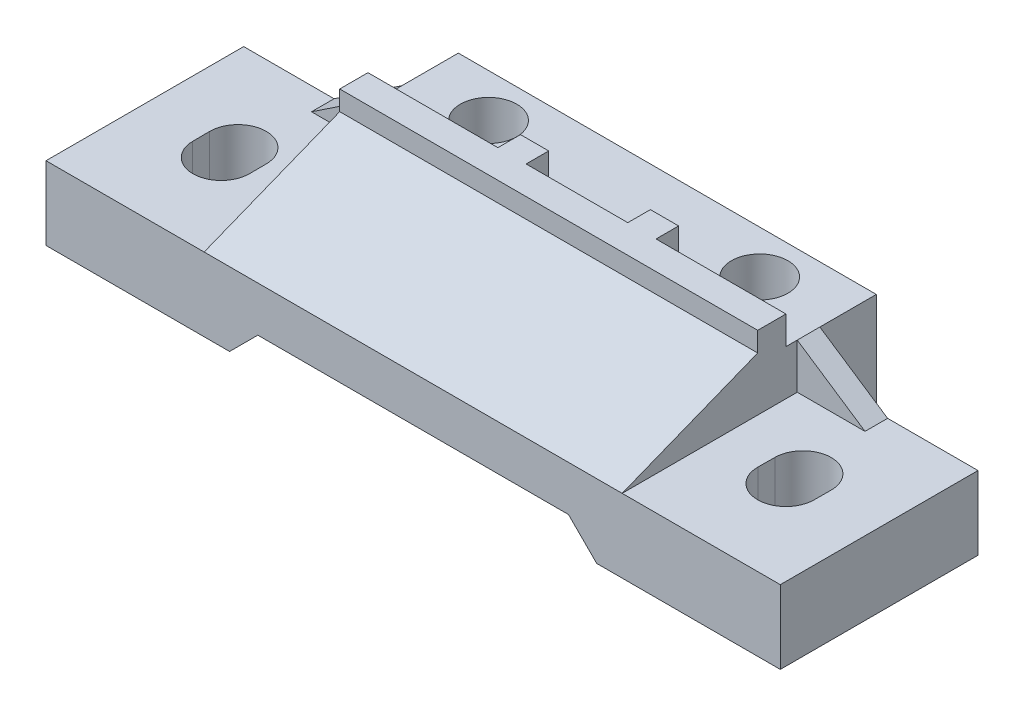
ISO-10303-21;
HEADER;
FILE_DESCRIPTION(('STEP AP214'),'2;1');
FILE_NAME('part.step','',(''),(''),'','','');
FILE_SCHEMA(('AUTOMOTIVE_DESIGN { 1 0 10303 214 1 1 1 1 }'));
ENDSEC;
DATA;
#1=APPLICATION_CONTEXT('core data for automotive mechanical design processes');
#2=APPLICATION_PROTOCOL_DEFINITION('international standard','automotive_design',2000,#1);
#3=PRODUCT_CONTEXT('',#1,'mechanical');
#4=PRODUCT('Part','Part','',(#3));
#5=PRODUCT_RELATED_PRODUCT_CATEGORY('part','',(#4));
#6=PRODUCT_DEFINITION_FORMATION('','',#4);
#7=PRODUCT_DEFINITION_CONTEXT('part definition',#1,'design');
#8=PRODUCT_DEFINITION('design','',#6,#7);
#9=PRODUCT_DEFINITION_SHAPE('','',#8);
#10=(LENGTH_UNIT() NAMED_UNIT(*) SI_UNIT(.MILLI.,.METRE.));
#11=(NAMED_UNIT(*) PLANE_ANGLE_UNIT() SI_UNIT($,.RADIAN.));
#12=(NAMED_UNIT(*) SI_UNIT($,.STERADIAN.) SOLID_ANGLE_UNIT());
#13=UNCERTAINTY_MEASURE_WITH_UNIT(LENGTH_MEASURE(1.E-05),#10,'distance_accuracy_value','');
#14=(GEOMETRIC_REPRESENTATION_CONTEXT(3) GLOBAL_UNCERTAINTY_ASSIGNED_CONTEXT((#13)) GLOBAL_UNIT_ASSIGNED_CONTEXT((#10,
#11,#12)) REPRESENTATION_CONTEXT('',''));
#15=CARTESIAN_POINT('',(0.,0.,0.));
#16=DIRECTION('',(0.,0.,1.));
#17=DIRECTION('',(1.,0.,0.));
#18=AXIS2_PLACEMENT_3D('',#15,#16,#17);
#19=CARTESIAN_POINT('',(25.,24.5,-27.5));
#20=DIRECTION('',(1.,0.,0.));
#21=DIRECTION('',(0.,0.,-1.));
#22=AXIS2_PLACEMENT_3D('',#19,#20,#21);
#23=PLANE('',#22);
#24=DIRECTION('',(0.,0.,-1.));
#25=VECTOR('',#24,1.);
#26=CARTESIAN_POINT('',(25.,21.,-27.5));
#27=LINE('',#26,#25);
#28=CARTESIAN_POINT('',(25.,21.,-17.5));
#29=VERTEX_POINT('',#28);
#30=CARTESIAN_POINT('',(25.,21.,-27.5));
#31=VERTEX_POINT('',#30);
#32=EDGE_CURVE('E1784',#29,#31,#27,.T.);
#33=ORIENTED_EDGE('',*,*,#32,.F.);
#34=DIRECTION('',(0.,1.,0.));
#35=VECTOR('',#34,1.);
#36=CARTESIAN_POINT('',(25.,13.,-17.5));
#37=LINE('',#36,#35);
#38=CARTESIAN_POINT('',(25.,0.,-17.5));
#39=VERTEX_POINT('',#38);
#40=EDGE_CURVE('E1805',#39,#29,#37,.T.);
#41=ORIENTED_EDGE('',*,*,#40,.F.);
#42=DIRECTION('',(0.,0.,1.));
#43=VECTOR('',#42,1.);
#44=CARTESIAN_POINT('',(25.,0.,-27.5));
#45=LINE('',#44,#43);
#46=CARTESIAN_POINT('',(25.,0.,-27.5));
#47=VERTEX_POINT('',#46);
#48=EDGE_CURVE('E1797',#47,#39,#45,.T.);
#49=ORIENTED_EDGE('',*,*,#48,.F.);
#50=DIRECTION('',(0.,1.,0.));
#51=VECTOR('',#50,1.);
#52=CARTESIAN_POINT('',(25.,24.5,-27.5));
#53=LINE('',#52,#51);
#54=EDGE_CURVE('E1792',#47,#31,#53,.T.);
#55=ORIENTED_EDGE('',*,*,#54,.T.);
#56=EDGE_LOOP('',(#33,#41,#49,#55));
#57=FACE_BOUND('',#56,.T.);
#58=ADVANCED_FACE('F35',(#57),#23,.T.);
#59=CARTESIAN_POINT('',(-49.,0.,-27.5));
#60=DIRECTION('',(-1.,0.,0.));
#61=DIRECTION('',(0.,0.,1.));
#62=AXIS2_PLACEMENT_3D('',#59,#60,#61);
#63=PLANE('',#62);
#64=DIRECTION('',(0.,0.,1.));
#65=VECTOR('',#64,1.);
#66=CARTESIAN_POINT('',(-49.,21.,-27.5));
#67=LINE('',#66,#65);
#68=CARTESIAN_POINT('',(-49.,21.,-13.5));
#69=VERTEX_POINT('',#68);
#70=CARTESIAN_POINT('',(-49.,21.,-11.5));
#71=VERTEX_POINT('',#70);
#72=EDGE_CURVE('E1768',#69,#71,#67,.T.);
#73=ORIENTED_EDGE('',*,*,#72,.F.);
#74=DIRECTION('',(0.,-1.,0.));
#75=VECTOR('',#74,1.);
#76=CARTESIAN_POINT('',(-49.,21.,-13.5));
#77=LINE('',#76,#75);
#78=CARTESIAN_POINT('',(-49.,13.,-13.5));
#79=VERTEX_POINT('',#78);
#80=EDGE_CURVE('E864',#69,#79,#77,.T.);
#81=ORIENTED_EDGE('',*,*,#80,.T.);
#82=DIRECTION('',(0.,0.,-1.));
#83=VECTOR('',#82,1.);
#84=CARTESIAN_POINT('',(-49.,13.,0.));
#85=LINE('',#84,#83);
#86=CARTESIAN_POINT('',(-49.,13.,17.5));
#87=VERTEX_POINT('',#86);
#88=EDGE_CURVE('E1807',#87,#79,#85,.T.);
#89=ORIENTED_EDGE('',*,*,#88,.F.);
#90=DIRECTION('',(0.,0.36862572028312,-0.929577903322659));
#91=VECTOR('',#90,1.);
#92=CARTESIAN_POINT('',(-49.,26.6534806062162,-16.9305163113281));
#93=LINE('',#92,#91);
#94=CARTESIAN_POINT('',(-49.,22.5172413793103,-6.49999999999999));
#95=VERTEX_POINT('',#94);
#96=EDGE_CURVE('E1839',#87,#95,#93,.T.);
#97=ORIENTED_EDGE('',*,*,#96,.T.);
#98=DIRECTION('',(0.,-1.,0.));
#99=VECTOR('',#98,1.);
#100=CARTESIAN_POINT('',(-49.,21.,-6.49999999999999));
#101=LINE('',#100,#99);
#102=CARTESIAN_POINT('',(-49.,26.,-6.49999999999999));
#103=VERTEX_POINT('',#102);
#104=EDGE_CURVE('E1628',#103,#95,#101,.T.);
#105=ORIENTED_EDGE('',*,*,#104,.F.);
#106=DIRECTION('',(0.,0.,1.));
#107=VECTOR('',#106,1.);
#108=CARTESIAN_POINT('',(-49.,26.,-6.49999999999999));
#109=LINE('',#108,#107);
#110=CARTESIAN_POINT('',(-49.,26.,-11.5));
#111=VERTEX_POINT('',#110);
#112=EDGE_CURVE('E1622',#111,#103,#109,.T.);
#113=ORIENTED_EDGE('',*,*,#112,.F.);
#114=DIRECTION('',(0.,1.,0.));
#115=VECTOR('',#114,1.);
#116=CARTESIAN_POINT('',(-49.,0.,-11.5));
#117=LINE('',#116,#115);
#118=EDGE_CURVE('E1643',#71,#111,#117,.T.);
#119=ORIENTED_EDGE('',*,*,#118,.F.);
#120=EDGE_LOOP('',(#73,#81,#89,#97,#105,#113,#119));
#121=FACE_BOUND('',#120,.T.);
#122=ADVANCED_FACE('F1938',(#121),#63,.T.);
#123=CARTESIAN_POINT('',(0.,13.,0.));
#124=DIRECTION('',(0.,-1.,0.));
#125=DIRECTION('',(0.,0.,-1.));
#126=AXIS2_PLACEMENT_3D('',#123,#124,#125);
#127=PLANE('',#126);
#128=DIRECTION('',(-1.,0.,0.));
#129=VECTOR('',#128,1.);
#130=CARTESIAN_POINT('',(-77.,13.,-17.5));
#131=LINE('',#130,#129);
#132=CARTESIAN_POINT('',(53.,13.,-17.5));
#133=VERTEX_POINT('',#132);
#134=CARTESIAN_POINT('',(37.,13.,-17.5));
#135=VERTEX_POINT('',#134);
#136=EDGE_CURVE('E854',#133,#135,#131,.T.);
#137=ORIENTED_EDGE('',*,*,#136,.T.);
#138=DIRECTION('',(0.,0.,-1.));
#139=VECTOR('',#138,1.);
#140=CARTESIAN_POINT('',(37.,13.,-13.5));
#141=LINE('',#140,#139);
#142=CARTESIAN_POINT('',(37.,13.,-13.5));
#143=VERTEX_POINT('',#142);
#144=EDGE_CURVE('E844',#143,#135,#141,.T.);
#145=ORIENTED_EDGE('',*,*,#144,.F.);
#146=DIRECTION('',(-1.,0.,0.));
#147=VECTOR('',#146,1.);
#148=CARTESIAN_POINT('',(25.,13.,-13.5));
#149=LINE('',#148,#147);
#150=CARTESIAN_POINT('',(25.,13.,-13.5));
#151=VERTEX_POINT('',#150);
#152=EDGE_CURVE('E831',#143,#151,#149,.T.);
#153=ORIENTED_EDGE('',*,*,#152,.T.);
#154=DIRECTION('',(0.,0.,1.));
#155=VECTOR('',#154,1.);
#156=CARTESIAN_POINT('',(25.,13.,0.));
#157=LINE('',#156,#155);
#158=CARTESIAN_POINT('',(25.,13.,17.5));
#159=VERTEX_POINT('',#158);
#160=EDGE_CURVE('E1801',#151,#159,#157,.T.);
#161=ORIENTED_EDGE('',*,*,#160,.T.);
#162=DIRECTION('',(1.,0.,0.));
#163=VECTOR('',#162,1.);
#164=CARTESIAN_POINT('',(-77.,13.,17.5));
#165=LINE('',#164,#163);
#166=CARTESIAN_POINT('',(53.,13.,17.5));
#167=VERTEX_POINT('',#166);
#168=EDGE_CURVE('E1816',#159,#167,#165,.T.);
#169=ORIENTED_EDGE('',*,*,#168,.T.);
#170=DIRECTION('',(0.,0.,1.));
#171=VECTOR('',#170,1.);
#172=CARTESIAN_POINT('',(53.,13.,17.5));
#173=LINE('',#172,#171);
#174=EDGE_CURVE('E906',#133,#167,#173,.T.);
#175=ORIENTED_EDGE('',*,*,#174,.F.);
#176=EDGE_LOOP('',(#137,#145,#153,#161,#169,#175));
#177=FACE_BOUND('',#176,.T.);
#178=CARTESIAN_POINT('',(37.9898000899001,13.,1.49833759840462));
#179=DIRECTION('',(0.,-1.,0.));
#180=DIRECTION('',(0.,0.,-1.));
#181=AXIS2_PLACEMENT_3D('',#178,#179,#180);
#182=CIRCLE('',#181,4.9999880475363);
#183=CARTESIAN_POINT('',(32.989927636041,13.,1.46433876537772));
#184=VERTEX_POINT('',#183);
#185=CARTESIAN_POINT('',(42.9896725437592,13.,1.53233643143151));
#186=VERTEX_POINT('',#185);
#187=EDGE_CURVE('E882',#184,#186,#182,.F.);
#188=ORIENTED_EDGE('',*,*,#187,.F.);
#189=DIRECTION('',(-0.00679978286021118,0.,0.999976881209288));
#190=VECTOR('',#189,1.);
#191=CARTESIAN_POINT('',(32.9983592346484,13.,0.224386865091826));
#192=LINE('',#191,#190);
#193=CARTESIAN_POINT('',(33.0103274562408,13.,-1.53566123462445));
#194=VERTEX_POINT('',#193);
#195=EDGE_CURVE('E871',#194,#184,#192,.T.);
#196=ORIENTED_EDGE('',*,*,#195,.F.);
#197=CARTESIAN_POINT('',(38.0101999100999,13.,-1.50166240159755));
#198=DIRECTION('',(0.,-1.,0.));
#199=DIRECTION('',(0.,0.,-1.));
#200=AXIS2_PLACEMENT_3D('',#197,#198,#199);
#201=CIRCLE('',#200,4.9999880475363);
#202=CARTESIAN_POINT('',(43.010072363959,13.,-1.46766356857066));
#203=VERTEX_POINT('',#202);
#204=EDGE_CURVE('E876',#203,#194,#201,.F.);
#205=ORIENTED_EDGE('',*,*,#204,.F.);
#206=DIRECTION('',(0.00679978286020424,0.,-0.999976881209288));
#207=VECTOR('',#206,1.);
#208=CARTESIAN_POINT('',(42.9981041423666,13.,0.292384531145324));
#209=LINE('',#208,#207);
#210=EDGE_CURVE('E879',#186,#203,#209,.T.);
#211=ORIENTED_EDGE('',*,*,#210,.F.);
#212=EDGE_LOOP('',(#188,#196,#205,#211));
#213=FACE_BOUND('',#212,.T.);
#214=ADVANCED_FACE('F851',(#177,#213),#127,.F.);
#215=CARTESIAN_POINT('',(0.,0.,0.));
#216=DIRECTION('',(0.,-1.,0.));
#217=DIRECTION('',(0.,0.,-1.));
#218=AXIS2_PLACEMENT_3D('',#215,#216,#217);
#219=PLANE('',#218);
#220=DIRECTION('',(-1.,0.,0.));
#221=VECTOR('',#220,1.);
#222=CARTESIAN_POINT('',(-77.,0.,-17.5));
#223=LINE('',#222,#221);
#224=CARTESIAN_POINT('',(53.,0.,-17.5));
#225=VERTEX_POINT('',#224);
#226=EDGE_CURVE('E1821',#225,#39,#223,.T.);
#227=ORIENTED_EDGE('',*,*,#226,.F.);
#228=DIRECTION('',(0.,0.,-1.));
#229=VECTOR('',#228,1.);
#230=CARTESIAN_POINT('',(53.,0.,-17.5));
#231=LINE('',#230,#229);
#232=CARTESIAN_POINT('',(53.,0.,17.5));
#233=VERTEX_POINT('',#232);
#234=EDGE_CURVE('E900',#233,#225,#231,.T.);
#235=ORIENTED_EDGE('',*,*,#234,.F.);
#236=DIRECTION('',(1.,0.,0.));
#237=VECTOR('',#236,1.);
#238=CARTESIAN_POINT('',(-77.,0.,17.5));
#239=LINE('',#238,#237);
#240=CARTESIAN_POINT('',(20.5,0.,17.5));
#241=VERTEX_POINT('',#240);
#242=EDGE_CURVE('E1825',#241,#233,#239,.T.);
#243=ORIENTED_EDGE('',*,*,#242,.F.);
#244=DIRECTION('',(0.,0.,-1.));
#245=VECTOR('',#244,1.);
#246=CARTESIAN_POINT('',(20.5,0.,17.5));
#247=LINE('',#246,#245);
#248=CARTESIAN_POINT('',(20.5,0.,14.));
#249=VERTEX_POINT('',#248);
#250=EDGE_CURVE('E1770',#241,#249,#247,.T.);
#251=ORIENTED_EDGE('',*,*,#250,.T.);
#252=DIRECTION('',(0.,0.,-1.));
#253=VECTOR('',#252,1.);
#254=CARTESIAN_POINT('',(20.5,0.,0.));
#255=LINE('',#254,#253);
#256=CARTESIAN_POINT('',(20.5,0.,0.));
#257=VERTEX_POINT('',#256);
#258=EDGE_CURVE('E1702',#249,#257,#255,.T.);
#259=ORIENTED_EDGE('',*,*,#258,.T.);
#260=CARTESIAN_POINT('',(20.5,0.,-4.49999999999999));
#261=VERTEX_POINT('',#260);
#262=EDGE_CURVE('E1773',#257,#261,#247,.T.);
#263=ORIENTED_EDGE('',*,*,#262,.T.);
#264=DIRECTION('',(0.,0.,-1.));
#265=VECTOR('',#264,1.);
#266=CARTESIAN_POINT('',(20.5,0.,-4.49999999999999));
#267=LINE('',#266,#265);
#268=CARTESIAN_POINT('',(20.5,0.,-27.5));
#269=VERTEX_POINT('',#268);
#270=EDGE_CURVE('E1741',#261,#269,#267,.T.);
#271=ORIENTED_EDGE('',*,*,#270,.T.);
#272=DIRECTION('',(1.,0.,0.));
#273=VECTOR('',#272,1.);
#274=CARTESIAN_POINT('',(25.,0.,-27.5));
#275=LINE('',#274,#273);
#276=EDGE_CURVE('E1788',#269,#47,#275,.T.);
#277=ORIENTED_EDGE('',*,*,#276,.T.);
#278=ORIENTED_EDGE('',*,*,#48,.T.);
#279=EDGE_LOOP('',(#227,#235,#243,#251,#259,#263,#271,#277,#278));
#280=FACE_BOUND('',#279,.T.);
#281=DIRECTION('',(-0.00679978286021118,0.,0.999976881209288));
#282=VECTOR('',#281,1.);
#283=CARTESIAN_POINT('',(32.989927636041,0.,1.46433876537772));
#284=LINE('',#283,#282);
#285=CARTESIAN_POINT('',(33.0103274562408,0.,-1.53566123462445));
#286=VERTEX_POINT('',#285);
#287=CARTESIAN_POINT('',(32.989927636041,0.,1.46433876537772));
#288=VERTEX_POINT('',#287);
#289=EDGE_CURVE('E1204',#286,#288,#284,.T.);
#290=ORIENTED_EDGE('',*,*,#289,.T.);
#291=CARTESIAN_POINT('',(37.9898000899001,0.,1.49833759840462));
#292=DIRECTION('',(0.,1.,0.));
#293=DIRECTION('',(0.,0.,-1.));
#294=AXIS2_PLACEMENT_3D('',#291,#292,#293);
#295=CIRCLE('',#294,4.9999880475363);
#296=CARTESIAN_POINT('',(42.9896725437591,0.,1.53233643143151));
#297=VERTEX_POINT('',#296);
#298=EDGE_CURVE('E966',#288,#297,#295,.T.);
#299=ORIENTED_EDGE('',*,*,#298,.T.);
#300=DIRECTION('',(0.00679978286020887,0.,-0.999976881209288));
#301=VECTOR('',#300,1.);
#302=CARTESIAN_POINT('',(42.9896725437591,0.,1.53233643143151));
#303=LINE('',#302,#301);
#304=CARTESIAN_POINT('',(43.010072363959,0.,-1.46766356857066));
#305=VERTEX_POINT('',#304);
#306=EDGE_CURVE('E1210',#297,#305,#303,.T.);
#307=ORIENTED_EDGE('',*,*,#306,.T.);
#308=CARTESIAN_POINT('',(38.0101999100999,0.,-1.50166240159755));
#309=DIRECTION('',(0.,1.,0.));
#310=DIRECTION('',(0.,0.,-1.));
#311=AXIS2_PLACEMENT_3D('',#308,#309,#310);
#312=CIRCLE('',#311,4.9999880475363);
#313=EDGE_CURVE('E1207',#305,#286,#312,.T.);
#314=ORIENTED_EDGE('',*,*,#313,.T.);
#315=EDGE_LOOP('',(#290,#299,#307,#314));
#316=FACE_BOUND('',#315,.T.);
#317=DIRECTION('',(-1.,0.,0.));
#318=VECTOR('',#317,1.);
#319=CARTESIAN_POINT('',(25.5,0.,-14.5));
#320=LINE('',#319,#318);
#321=CARTESIAN_POINT('',(34.5,0.,-14.5));
#322=VERTEX_POINT('',#321);
#323=CARTESIAN_POINT('',(25.5,0.,-14.5));
#324=VERTEX_POINT('',#323);
#325=EDGE_CURVE('E936',#322,#324,#320,.T.);
#326=ORIENTED_EDGE('',*,*,#325,.T.);
#327=CARTESIAN_POINT('',(25.5,0.,-12.5));
#328=DIRECTION('',(0.,1.,0.));
#329=DIRECTION('',(0.,0.,-1.));
#330=AXIS2_PLACEMENT_3D('',#327,#328,#329);
#331=CIRCLE('',#330,2.);
#332=CARTESIAN_POINT('',(23.5,0.,-12.5));
#333=VERTEX_POINT('',#332);
#334=EDGE_CURVE('E933',#324,#333,#331,.T.);
#335=ORIENTED_EDGE('',*,*,#334,.T.);
#336=DIRECTION('',(0.,0.,1.));
#337=VECTOR('',#336,1.);
#338=CARTESIAN_POINT('',(23.5,0.,-3.50064579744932));
#339=LINE('',#338,#337);
#340=CARTESIAN_POINT('',(23.5,0.,-3.50064579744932));
#341=VERTEX_POINT('',#340);
#342=EDGE_CURVE('E914',#333,#341,#339,.T.);
#343=ORIENTED_EDGE('',*,*,#342,.T.);
#344=CARTESIAN_POINT('',(25.5,0.,-3.50064579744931));
#345=DIRECTION('',(0.,1.,0.));
#346=DIRECTION('',(0.,0.,-1.));
#347=AXIS2_PLACEMENT_3D('',#344,#345,#346);
#348=CIRCLE('',#347,2.);
#349=CARTESIAN_POINT('',(25.5004528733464,0.,-1.50064584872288));
#350=VERTEX_POINT('',#349);
#351=EDGE_CURVE('E958',#341,#350,#348,.T.);
#352=ORIENTED_EDGE('',*,*,#351,.T.);
#353=DIRECTION('',(0.999999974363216,0.,-0.000226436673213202));
#354=VECTOR('',#353,1.);
#355=CARTESIAN_POINT('',(25.5004528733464,0.,-1.50064584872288));
#356=LINE('',#355,#354);
#357=CARTESIAN_POINT('',(29.0457307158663,0.,-1.50144862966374));
#358=VERTEX_POINT('',#357);
#359=EDGE_CURVE('E955',#350,#358,#356,.T.);
#360=ORIENTED_EDGE('',*,*,#359,.T.);
#361=CARTESIAN_POINT('',(29.045504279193,0.,-2.50144860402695));
#362=DIRECTION('',(0.,1.,0.));
#363=DIRECTION('',(0.,0.,-1.));
#364=AXIS2_PLACEMENT_3D('',#361,#362,#363);
#365=CIRCLE('',#364,0.999999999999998);
#366=CARTESIAN_POINT('',(30.0393149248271,0.,-2.39036124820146));
#367=VERTEX_POINT('',#366);
#368=EDGE_CURVE('E952',#358,#367,#365,.T.);
#369=ORIENTED_EDGE('',*,*,#368,.T.);
#370=CARTESIAN_POINT('',(37.9898000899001,0.,-1.50166240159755));
#371=DIRECTION('',(0.,-1.,0.));
#372=DIRECTION('',(0.,0.,1.));
#373=AXIS2_PLACEMENT_3D('',#370,#371,#372);
#374=CIRCLE('',#373,8.);
#375=CARTESIAN_POINT('',(35.7766444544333,0.,-9.18944115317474));
#376=VERTEX_POINT('',#375);
#377=EDGE_CURVE('E949',#367,#376,#374,.T.);
#378=ORIENTED_EDGE('',*,*,#377,.T.);
#379=CARTESIAN_POINT('',(35.5,0.,-10.1504134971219));
#380=DIRECTION('',(0.,1.,0.));
#381=DIRECTION('',(0.,0.,1.));
#382=AXIS2_PLACEMENT_3D('',#379,#380,#381);
#383=CIRCLE('',#382,1.00000000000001);
#384=CARTESIAN_POINT('',(36.5,0.,-10.1504134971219));
#385=VERTEX_POINT('',#384);
#386=EDGE_CURVE('E946',#376,#385,#383,.T.);
#387=ORIENTED_EDGE('',*,*,#386,.T.);
#388=DIRECTION('',(0.,0.,-1.));
#389=VECTOR('',#388,1.);
#390=CARTESIAN_POINT('',(36.5,0.,-10.1504134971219));
#391=LINE('',#390,#389);
#392=CARTESIAN_POINT('',(36.5,0.,-12.5));
#393=VERTEX_POINT('',#392);
#394=EDGE_CURVE('E943',#385,#393,#391,.T.);
#395=ORIENTED_EDGE('',*,*,#394,.T.);
#396=CARTESIAN_POINT('',(34.5,0.,-12.5));
#397=DIRECTION('',(0.,1.,0.));
#398=DIRECTION('',(0.,0.,1.));
#399=AXIS2_PLACEMENT_3D('',#396,#397,#398);
#400=CIRCLE('',#399,1.99999999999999);
#401=EDGE_CURVE('E940',#393,#322,#400,.T.);
#402=ORIENTED_EDGE('',*,*,#401,.T.);
#403=EDGE_LOOP('',(#326,#335,#343,#352,#360,#369,#378,#387,#395,#402));
#404=FACE_BOUND('',#403,.T.);
#405=DIRECTION('',(0.,0.,1.));
#406=VECTOR('',#405,1.);
#407=CARTESIAN_POINT('',(39.5,0.,-10.1504134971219));
#408=LINE('',#407,#406);
#409=CARTESIAN_POINT('',(39.5,0.,-12.5));
#410=VERTEX_POINT('',#409);
#411=CARTESIAN_POINT('',(39.5,0.,-10.1504134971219));
#412=VERTEX_POINT('',#411);
#413=EDGE_CURVE('E1011',#410,#412,#408,.T.);
#414=ORIENTED_EDGE('',*,*,#413,.T.);
#415=CARTESIAN_POINT('',(40.5,0.,-10.1504134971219));
#416=DIRECTION('',(0.,1.,0.));
#417=DIRECTION('',(0.,0.,-1.));
#418=AXIS2_PLACEMENT_3D('',#415,#416,#417);
#419=CIRCLE('',#418,1.00000000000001);
#420=CARTESIAN_POINT('',(40.2233555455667,0.,-9.18944115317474));
#421=VERTEX_POINT('',#420);
#422=EDGE_CURVE('E1008',#412,#421,#419,.T.);
#423=ORIENTED_EDGE('',*,*,#422,.T.);
#424=CARTESIAN_POINT('',(38.0101999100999,0.,-1.50166240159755));
#425=DIRECTION('',(0.,-1.,0.));
#426=DIRECTION('',(0.,0.,-1.));
#427=AXIS2_PLACEMENT_3D('',#424,#425,#426);
#428=CIRCLE('',#427,8.);
#429=CARTESIAN_POINT('',(45.9606850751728,0.,-2.39036124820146));
#430=VERTEX_POINT('',#429);
#431=EDGE_CURVE('E989',#421,#430,#428,.T.);
#432=ORIENTED_EDGE('',*,*,#431,.T.);
#433=CARTESIAN_POINT('',(46.954495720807,0.,-2.50144860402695));
#434=DIRECTION('',(0.,1.,0.));
#435=DIRECTION('',(0.,0.,1.));
#436=AXIS2_PLACEMENT_3D('',#433,#434,#435);
#437=CIRCLE('',#436,0.999999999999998);
#438=CARTESIAN_POINT('',(46.9542692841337,0.,-1.50144862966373));
#439=VERTEX_POINT('',#438);
#440=EDGE_CURVE('E1033',#430,#439,#437,.T.);
#441=ORIENTED_EDGE('',*,*,#440,.T.);
#442=DIRECTION('',(0.999999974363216,0.,0.00022643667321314));
#443=VECTOR('',#442,1.);
#444=CARTESIAN_POINT('',(47.9995471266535,0.,-1.50121194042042));
#445=LINE('',#444,#443);
#446=CARTESIAN_POINT('',(47.9995471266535,0.,-1.50121194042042));
#447=VERTEX_POINT('',#446);
#448=EDGE_CURVE('E1030',#439,#447,#445,.T.);
#449=ORIENTED_EDGE('',*,*,#448,.T.);
#450=CARTESIAN_POINT('',(48.,0.,-3.50121188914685));
#451=DIRECTION('',(0.,1.,0.));
#452=DIRECTION('',(0.,0.,1.));
#453=AXIS2_PLACEMENT_3D('',#450,#451,#452);
#454=CIRCLE('',#453,2.);
#455=CARTESIAN_POINT('',(50.,0.,-3.50121188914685));
#456=VERTEX_POINT('',#455);
#457=EDGE_CURVE('E1027',#447,#456,#454,.T.);
#458=ORIENTED_EDGE('',*,*,#457,.T.);
#459=DIRECTION('',(0.,0.,-1.));
#460=VECTOR('',#459,1.);
#461=CARTESIAN_POINT('',(50.,0.,-12.5));
#462=LINE('',#461,#460);
#463=CARTESIAN_POINT('',(50.,0.,-12.5));
#464=VERTEX_POINT('',#463);
#465=EDGE_CURVE('E1024',#456,#464,#462,.T.);
#466=ORIENTED_EDGE('',*,*,#465,.T.);
#467=CARTESIAN_POINT('',(48.,0.,-12.5));
#468=DIRECTION('',(0.,1.,0.));
#469=DIRECTION('',(0.,0.,1.));
#470=AXIS2_PLACEMENT_3D('',#467,#468,#469);
#471=CIRCLE('',#470,2.);
#472=CARTESIAN_POINT('',(48.,0.,-14.5));
#473=VERTEX_POINT('',#472);
#474=EDGE_CURVE('E1021',#464,#473,#471,.T.);
#475=ORIENTED_EDGE('',*,*,#474,.T.);
#476=DIRECTION('',(-1.,0.,0.));
#477=VECTOR('',#476,1.);
#478=CARTESIAN_POINT('',(48.,0.,-14.5));
#479=LINE('',#478,#477);
#480=CARTESIAN_POINT('',(41.5,0.,-14.5));
#481=VERTEX_POINT('',#480);
#482=EDGE_CURVE('E1018',#473,#481,#479,.T.);
#483=ORIENTED_EDGE('',*,*,#482,.T.);
#484=CARTESIAN_POINT('',(41.5,0.,-12.5));
#485=DIRECTION('',(0.,1.,0.));
#486=DIRECTION('',(0.,0.,-1.));
#487=AXIS2_PLACEMENT_3D('',#484,#485,#486);
#488=CIRCLE('',#487,1.99999999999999);
#489=EDGE_CURVE('E1015',#481,#410,#488,.T.);
#490=ORIENTED_EDGE('',*,*,#489,.T.);
#491=EDGE_LOOP('',(#414,#423,#432,#441,#449,#458,#466,#475,#483,#490));
#492=FACE_BOUND('',#491,.T.);
#493=DIRECTION('',(-0.999999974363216,0.,-0.00022643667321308));
#494=VECTOR('',#493,1.);
#495=CARTESIAN_POINT('',(25.5004528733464,0.,1.49732104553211));
#496=LINE('',#495,#494);
#497=CARTESIAN_POINT('',(29.0457307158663,0.,1.49812382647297));
#498=VERTEX_POINT('',#497);
#499=CARTESIAN_POINT('',(25.5004528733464,0.,1.49732104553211));
#500=VERTEX_POINT('',#499);
#501=EDGE_CURVE('E1084',#498,#500,#496,.T.);
#502=ORIENTED_EDGE('',*,*,#501,.T.);
#503=CARTESIAN_POINT('',(25.5,0.,3.49732099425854));
#504=DIRECTION('',(0.,1.,0.));
#505=DIRECTION('',(0.,0.,-1.));
#506=AXIS2_PLACEMENT_3D('',#503,#504,#505);
#507=CIRCLE('',#506,2.);
#508=CARTESIAN_POINT('',(23.5,0.,3.49732099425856));
#509=VERTEX_POINT('',#508);
#510=EDGE_CURVE('E1081',#500,#509,#507,.T.);
#511=ORIENTED_EDGE('',*,*,#510,.T.);
#512=DIRECTION('',(0.,0.,1.));
#513=VECTOR('',#512,1.);
#514=CARTESIAN_POINT('',(23.5,0.,12.4966751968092));
#515=LINE('',#514,#513);
#516=CARTESIAN_POINT('',(23.5,0.,12.4966751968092));
#517=VERTEX_POINT('',#516);
#518=EDGE_CURVE('E1062',#509,#517,#515,.T.);
#519=ORIENTED_EDGE('',*,*,#518,.T.);
#520=CARTESIAN_POINT('',(25.5,0.,12.4966751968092));
#521=DIRECTION('',(0.,1.,0.));
#522=DIRECTION('',(0.,0.,-1.));
#523=AXIS2_PLACEMENT_3D('',#520,#521,#522);
#524=CIRCLE('',#523,2.);
#525=CARTESIAN_POINT('',(25.5,0.,14.4966751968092));
#526=VERTEX_POINT('',#525);
#527=EDGE_CURVE('E1106',#517,#526,#524,.T.);
#528=ORIENTED_EDGE('',*,*,#527,.T.);
#529=DIRECTION('',(1.,0.,0.));
#530=VECTOR('',#529,1.);
#531=CARTESIAN_POINT('',(25.5,0.,14.4966751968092));
#532=LINE('',#531,#530);
#533=CARTESIAN_POINT('',(34.5,0.,14.4966751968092));
#534=VERTEX_POINT('',#533);
#535=EDGE_CURVE('E1103',#526,#534,#532,.T.);
#536=ORIENTED_EDGE('',*,*,#535,.T.);
#537=CARTESIAN_POINT('',(34.5,0.,12.4966751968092));
#538=DIRECTION('',(0.,1.,0.));
#539=DIRECTION('',(0.,0.,-1.));
#540=AXIS2_PLACEMENT_3D('',#537,#538,#539);
#541=CIRCLE('',#540,1.99999999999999);
#542=CARTESIAN_POINT('',(36.5,0.,12.4966751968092));
#543=VERTEX_POINT('',#542);
#544=EDGE_CURVE('E1100',#534,#543,#541,.T.);
#545=ORIENTED_EDGE('',*,*,#544,.T.);
#546=DIRECTION('',(0.,0.,-1.));
#547=VECTOR('',#546,1.);
#548=CARTESIAN_POINT('',(36.5,0.,10.1470886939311));
#549=LINE('',#548,#547);
#550=CARTESIAN_POINT('',(36.5,0.,10.1470886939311));
#551=VERTEX_POINT('',#550);
#552=EDGE_CURVE('E1097',#543,#551,#549,.T.);
#553=ORIENTED_EDGE('',*,*,#552,.T.);
#554=CARTESIAN_POINT('',(35.5,0.,10.1470886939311));
#555=DIRECTION('',(0.,1.,0.));
#556=DIRECTION('',(0.,0.,-1.));
#557=AXIS2_PLACEMENT_3D('',#554,#555,#556);
#558=CIRCLE('',#557,1.00000000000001);
#559=CARTESIAN_POINT('',(35.7766444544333,0.,9.18611634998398));
#560=VERTEX_POINT('',#559);
#561=EDGE_CURVE('E1094',#551,#560,#558,.T.);
#562=ORIENTED_EDGE('',*,*,#561,.T.);
#563=CARTESIAN_POINT('',(37.9898000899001,0.,1.49833759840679));
#564=DIRECTION('',(0.,-1.,0.));
#565=DIRECTION('',(0.,0.,-1.));
#566=AXIS2_PLACEMENT_3D('',#563,#564,#565);
#567=CIRCLE('',#566,8.);
#568=CARTESIAN_POINT('',(30.0393149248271,0.,2.38703644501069));
#569=VERTEX_POINT('',#568);
#570=EDGE_CURVE('E1091',#560,#569,#567,.T.);
#571=ORIENTED_EDGE('',*,*,#570,.T.);
#572=CARTESIAN_POINT('',(29.045504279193,0.,2.49812380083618));
#573=DIRECTION('',(0.,1.,0.));
#574=DIRECTION('',(0.,0.,1.));
#575=AXIS2_PLACEMENT_3D('',#572,#573,#574);
#576=CIRCLE('',#575,0.999999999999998);
#577=EDGE_CURVE('E1088',#569,#498,#576,.T.);
#578=ORIENTED_EDGE('',*,*,#577,.T.);
#579=EDGE_LOOP('',(#502,#511,#519,#528,#536,#545,#553,#562,#571,#578));
#580=FACE_BOUND('',#579,.T.);
#581=DIRECTION('',(1.,0.,0.));
#582=VECTOR('',#581,1.);
#583=CARTESIAN_POINT('',(48.,0.,14.4966751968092));
#584=LINE('',#583,#582);
#585=CARTESIAN_POINT('',(41.5,0.,14.4966751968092));
#586=VERTEX_POINT('',#585);
#587=CARTESIAN_POINT('',(48.,0.,14.4966751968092));
#588=VERTEX_POINT('',#587);
#589=EDGE_CURVE('E1156',#586,#588,#584,.T.);
#590=ORIENTED_EDGE('',*,*,#589,.T.);
#591=CARTESIAN_POINT('',(48.,0.,12.4966751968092));
#592=DIRECTION('',(0.,1.,0.));
#593=DIRECTION('',(0.,0.,-1.));
#594=AXIS2_PLACEMENT_3D('',#591,#592,#593);
#595=CIRCLE('',#594,2.);
#596=CARTESIAN_POINT('',(50.,0.,12.4966751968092));
#597=VERTEX_POINT('',#596);
#598=EDGE_CURVE('E909',#588,#597,#595,.T.);
#599=ORIENTED_EDGE('',*,*,#598,.T.);
#600=DIRECTION('',(0.,0.,-1.));
#601=VECTOR('',#600,1.);
#602=CARTESIAN_POINT('',(50.,0.,12.4966751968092));
#603=LINE('',#602,#601);
#604=CARTESIAN_POINT('',(50.,0.,3.49788708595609));
#605=VERTEX_POINT('',#604);
#606=EDGE_CURVE('E1135',#597,#605,#603,.T.);
#607=ORIENTED_EDGE('',*,*,#606,.T.);
#608=CARTESIAN_POINT('',(48.,0.,3.49788708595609));
#609=DIRECTION('',(0.,1.,0.));
#610=DIRECTION('',(0.,0.,-1.));
#611=AXIS2_PLACEMENT_3D('',#608,#609,#610);
#612=CIRCLE('',#611,2.);
#613=CARTESIAN_POINT('',(47.9995471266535,0.,1.49788713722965));
#614=VERTEX_POINT('',#613);
#615=EDGE_CURVE('E1177',#605,#614,#612,.T.);
#616=ORIENTED_EDGE('',*,*,#615,.T.);
#617=DIRECTION('',(-0.999999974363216,0.,0.00022643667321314));
#618=VECTOR('',#617,1.);
#619=CARTESIAN_POINT('',(47.9995471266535,0.,1.49788713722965));
#620=LINE('',#619,#618);
#621=CARTESIAN_POINT('',(46.9542692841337,0.,1.49812382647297));
#622=VERTEX_POINT('',#621);
#623=EDGE_CURVE('E1174',#614,#622,#620,.T.);
#624=ORIENTED_EDGE('',*,*,#623,.T.);
#625=CARTESIAN_POINT('',(46.954495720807,0.,2.49812380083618));
#626=DIRECTION('',(0.,1.,0.));
#627=DIRECTION('',(0.,0.,-1.));
#628=AXIS2_PLACEMENT_3D('',#625,#626,#627);
#629=CIRCLE('',#628,0.999999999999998);
#630=CARTESIAN_POINT('',(45.9606850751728,0.,2.38703644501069));
#631=VERTEX_POINT('',#630);
#632=EDGE_CURVE('E1171',#622,#631,#629,.T.);
#633=ORIENTED_EDGE('',*,*,#632,.T.);
#634=CARTESIAN_POINT('',(38.0101999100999,0.,1.49833759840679));
#635=DIRECTION('',(0.,-1.,0.));
#636=DIRECTION('',(0.,0.,1.));
#637=AXIS2_PLACEMENT_3D('',#634,#635,#636);
#638=CIRCLE('',#637,8.);
#639=CARTESIAN_POINT('',(40.2233555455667,0.,9.18611634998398));
#640=VERTEX_POINT('',#639);
#641=EDGE_CURVE('E1168',#631,#640,#638,.T.);
#642=ORIENTED_EDGE('',*,*,#641,.T.);
#643=CARTESIAN_POINT('',(40.5,0.,10.1470886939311));
#644=DIRECTION('',(0.,1.,0.));
#645=DIRECTION('',(0.,0.,1.));
#646=AXIS2_PLACEMENT_3D('',#643,#644,#645);
#647=CIRCLE('',#646,1.00000000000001);
#648=CARTESIAN_POINT('',(39.5,0.,10.1470886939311));
#649=VERTEX_POINT('',#648);
#650=EDGE_CURVE('E1165',#640,#649,#647,.T.);
#651=ORIENTED_EDGE('',*,*,#650,.T.);
#652=DIRECTION('',(0.,0.,1.));
#653=VECTOR('',#652,1.);
#654=CARTESIAN_POINT('',(39.5,0.,10.1470886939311));
#655=LINE('',#654,#653);
#656=CARTESIAN_POINT('',(39.5,0.,12.4966751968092));
#657=VERTEX_POINT('',#656);
#658=EDGE_CURVE('E1162',#649,#657,#655,.T.);
#659=ORIENTED_EDGE('',*,*,#658,.T.);
#660=CARTESIAN_POINT('',(41.5,0.,12.4966751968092));
#661=DIRECTION('',(0.,1.,0.));
#662=DIRECTION('',(0.,0.,1.));
#663=AXIS2_PLACEMENT_3D('',#660,#661,#662);
#664=CIRCLE('',#663,1.99999999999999);
#665=EDGE_CURVE('E1159',#657,#586,#664,.T.);
#666=ORIENTED_EDGE('',*,*,#665,.T.);
#667=EDGE_LOOP('',(#590,#599,#607,#616,#624,#633,#642,#651,#659,#666));
#668=FACE_BOUND('',#667,.T.);
#669=ADVANCED_FACE('F1902',(#280,#316,#404,#492,#580,#668),#219,.T.);
#670=CARTESIAN_POINT('',(77.,21.,-27.5));
#671=DIRECTION('',(0.,-1.,0.));
#672=DIRECTION('',(0.,0.,-1.));
#673=AXIS2_PLACEMENT_3D('',#670,#671,#672);
#674=PLANE('',#673);
#675=CARTESIAN_POINT('',(-36.,21.,-19.8459041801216));
#676=DIRECTION('',(0.,-1.,0.));
#677=DIRECTION('',(0.,0.,-1.));
#678=AXIS2_PLACEMENT_3D('',#675,#676,#677);
#679=CIRCLE('',#678,5.);
#680=CARTESIAN_POINT('',(-36.,21.,-24.8459041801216));
#681=VERTEX_POINT('',#680);
#682=EDGE_CURVE('E1650',#681,#681,#679,.T.);
#683=ORIENTED_EDGE('',*,*,#682,.T.);
#684=EDGE_LOOP('',(#683));
#685=FACE_BOUND('',#684,.T.);
#686=CARTESIAN_POINT('',(12.,21.,-19.8459041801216));
#687=DIRECTION('',(0.,-1.,0.));
#688=DIRECTION('',(0.,0.,-1.));
#689=AXIS2_PLACEMENT_3D('',#686,#687,#688);
#690=CIRCLE('',#689,5.);
#691=CARTESIAN_POINT('',(12.,21.,-24.8459041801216));
#692=VERTEX_POINT('',#691);
#693=EDGE_CURVE('E1655',#692,#692,#690,.T.);
#694=ORIENTED_EDGE('',*,*,#693,.T.);
#695=EDGE_LOOP('',(#694));
#696=FACE_BOUND('',#695,.T.);
#697=DIRECTION('',(0.,0.,1.));
#698=VECTOR('',#697,1.);
#699=CARTESIAN_POINT('',(1.99999999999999,21.,-15.5));
#700=LINE('',#699,#698);
#701=CARTESIAN_POINT('',(1.99999999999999,21.,-15.5));
#702=VERTEX_POINT('',#701);
#703=CARTESIAN_POINT('',(1.99999999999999,21.,-11.5));
#704=VERTEX_POINT('',#703);
#705=EDGE_CURVE('E1586',#702,#704,#700,.T.);
#706=ORIENTED_EDGE('',*,*,#705,.T.);
#707=DIRECTION('',(1.,0.,0.));
#708=VECTOR('',#707,1.);
#709=CARTESIAN_POINT('',(-55.,21.,-11.5));
#710=LINE('',#709,#708);
#711=CARTESIAN_POINT('',(25.,21.,-11.5));
#712=VERTEX_POINT('',#711);
#713=EDGE_CURVE('E1639',#704,#712,#710,.T.);
#714=ORIENTED_EDGE('',*,*,#713,.T.);
#715=CARTESIAN_POINT('',(25.,21.,-13.5));
#716=VERTEX_POINT('',#715);
#717=EDGE_CURVE('E1785',#712,#716,#27,.T.);
#718=ORIENTED_EDGE('',*,*,#717,.T.);
#719=DIRECTION('',(0.,0.,-1.));
#720=VECTOR('',#719,1.);
#721=CARTESIAN_POINT('',(25.,21.,-13.5));
#722=LINE('',#721,#720);
#723=EDGE_CURVE('E847',#716,#29,#722,.T.);
#724=ORIENTED_EDGE('',*,*,#723,.T.);
#725=ORIENTED_EDGE('',*,*,#32,.T.);
#726=DIRECTION('',(-1.,0.,0.));
#727=VECTOR('',#726,1.);
#728=CARTESIAN_POINT('',(0.,21.,-27.5));
#729=LINE('',#728,#727);
#730=CARTESIAN_POINT('',(-49.,21.,-27.5));
#731=VERTEX_POINT('',#730);
#732=EDGE_CURVE('E1834',#31,#731,#729,.T.);
#733=ORIENTED_EDGE('',*,*,#732,.T.);
#734=CARTESIAN_POINT('',(-49.,21.,-17.5));
#735=VERTEX_POINT('',#734);
#736=EDGE_CURVE('E1781',#731,#735,#67,.T.);
#737=ORIENTED_EDGE('',*,*,#736,.T.);
#738=DIRECTION('',(0.,0.,-1.));
#739=VECTOR('',#738,1.);
#740=CARTESIAN_POINT('',(-49.,21.,-13.5));
#741=LINE('',#740,#739);
#742=EDGE_CURVE('E867',#69,#735,#741,.T.);
#743=ORIENTED_EDGE('',*,*,#742,.F.);
#744=ORIENTED_EDGE('',*,*,#72,.T.);
#745=CARTESIAN_POINT('',(-26.,21.,-11.5));
#746=VERTEX_POINT('',#745);
#747=EDGE_CURVE('E1640',#71,#746,#710,.T.);
#748=ORIENTED_EDGE('',*,*,#747,.T.);
#749=DIRECTION('',(0.,0.,1.));
#750=VECTOR('',#749,1.);
#751=CARTESIAN_POINT('',(-26.,21.,-15.5));
#752=LINE('',#751,#750);
#753=CARTESIAN_POINT('',(-26.,21.,-15.5));
#754=VERTEX_POINT('',#753);
#755=EDGE_CURVE('E1615',#754,#746,#752,.T.);
#756=ORIENTED_EDGE('',*,*,#755,.F.);
#757=DIRECTION('',(-1.,0.,0.));
#758=VECTOR('',#757,1.);
#759=CARTESIAN_POINT('',(-21.,21.,-15.5));
#760=LINE('',#759,#758);
#761=CARTESIAN_POINT('',(-21.,21.,-15.5));
#762=VERTEX_POINT('',#761);
#763=EDGE_CURVE('E1592',#762,#754,#760,.T.);
#764=ORIENTED_EDGE('',*,*,#763,.F.);
#765=DIRECTION('',(0.,0.,1.));
#766=VECTOR('',#765,1.);
#767=CARTESIAN_POINT('',(-21.,21.,-15.5));
#768=LINE('',#767,#766);
#769=CARTESIAN_POINT('',(-21.,21.,-11.5));
#770=VERTEX_POINT('',#769);
#771=EDGE_CURVE('E1603',#762,#770,#768,.T.);
#772=ORIENTED_EDGE('',*,*,#771,.T.);
#773=CARTESIAN_POINT('',(-3.00000000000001,21.,-11.5));
#774=VERTEX_POINT('',#773);
#775=EDGE_CURVE('E1644',#770,#774,#710,.T.);
#776=ORIENTED_EDGE('',*,*,#775,.T.);
#777=DIRECTION('',(0.,0.,1.));
#778=VECTOR('',#777,1.);
#779=CARTESIAN_POINT('',(-3.00000000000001,21.,-15.5));
#780=LINE('',#779,#778);
#781=CARTESIAN_POINT('',(-3.,21.,-15.5));
#782=VERTEX_POINT('',#781);
#783=EDGE_CURVE('E1583',#782,#774,#780,.T.);
#784=ORIENTED_EDGE('',*,*,#783,.F.);
#785=DIRECTION('',(-1.,0.,0.));
#786=VECTOR('',#785,1.);
#787=CARTESIAN_POINT('',(-3.00000000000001,21.,-15.5));
#788=LINE('',#787,#786);
#789=EDGE_CURVE('E1571',#702,#782,#788,.T.);
#790=ORIENTED_EDGE('',*,*,#789,.F.);
#791=EDGE_LOOP('',(#706,#714,#718,#724,#725,#733,#737,#743,#744,#748,#756,#764,#772,#776,#784,#790));
#792=FACE_BOUND('',#791,.T.);
#793=ADVANCED_FACE('F1960',(#685,#696,#792),#674,.F.);
#794=CARTESIAN_POINT('',(-55.,21.,-11.5));
#795=DIRECTION('',(0.,0.,1.));
#796=DIRECTION('',(0.,-1.,0.));
#797=AXIS2_PLACEMENT_3D('',#794,#795,#796);
#798=PLANE('',#797);
#799=DIRECTION('',(0.,-1.,0.));
#800=VECTOR('',#799,1.);
#801=CARTESIAN_POINT('',(1.99999999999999,21.,-11.5));
#802=LINE('',#801,#800);
#803=CARTESIAN_POINT('',(1.99999999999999,26.,-11.5));
#804=VERTEX_POINT('',#803);
#805=EDGE_CURVE('E1557',#804,#704,#802,.T.);
#806=ORIENTED_EDGE('',*,*,#805,.F.);
#807=DIRECTION('',(1.,0.,0.));
#808=VECTOR('',#807,1.);
#809=CARTESIAN_POINT('',(-56.0710678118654,26.,-11.5));
#810=LINE('',#809,#808);
#811=CARTESIAN_POINT('',(25.,26.,-11.5));
#812=VERTEX_POINT('',#811);
#813=EDGE_CURVE('E1631',#804,#812,#810,.T.);
#814=ORIENTED_EDGE('',*,*,#813,.T.);
#815=DIRECTION('',(0.,-1.,0.));
#816=VECTOR('',#815,1.);
#817=CARTESIAN_POINT('',(25.,21.,-11.5));
#818=LINE('',#817,#816);
#819=EDGE_CURVE('E1635',#812,#712,#818,.T.);
#820=ORIENTED_EDGE('',*,*,#819,.T.);
#821=ORIENTED_EDGE('',*,*,#713,.F.);
#822=EDGE_LOOP('',(#806,#814,#820,#821));
#823=FACE_BOUND('',#822,.T.);
#824=ADVANCED_FACE('F1980',(#823),#798,.F.);
#825=DIRECTION('',(0.,1.,0.));
#826=VECTOR('',#825,1.);
#827=CARTESIAN_POINT('',(-3.00000000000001,26.,-11.5));
#828=LINE('',#827,#826);
#829=CARTESIAN_POINT('',(-3.00000000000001,26.,-11.5));
#830=VERTEX_POINT('',#829);
#831=EDGE_CURVE('E1568',#774,#830,#828,.T.);
#832=ORIENTED_EDGE('',*,*,#831,.F.);
#833=ORIENTED_EDGE('',*,*,#775,.F.);
#834=DIRECTION('',(0.,-1.,0.));
#835=VECTOR('',#834,1.);
#836=CARTESIAN_POINT('',(-21.,26.,-11.5));
#837=LINE('',#836,#835);
#838=CARTESIAN_POINT('',(-21.,26.,-11.5));
#839=VERTEX_POINT('',#838);
#840=EDGE_CURVE('E1596',#839,#770,#837,.T.);
#841=ORIENTED_EDGE('',*,*,#840,.F.);
#842=EDGE_CURVE('E1636',#839,#830,#810,.T.);
#843=ORIENTED_EDGE('',*,*,#842,.T.);
#844=EDGE_LOOP('',(#832,#833,#841,#843));
#845=FACE_BOUND('',#844,.T.);
#846=ADVANCED_FACE('F2082',(#845),#798,.F.);
#847=DIRECTION('',(0.,1.,0.));
#848=VECTOR('',#847,1.);
#849=CARTESIAN_POINT('',(-26.,21.,-11.5));
#850=LINE('',#849,#848);
#851=CARTESIAN_POINT('',(-26.,26.,-11.5));
#852=VERTEX_POINT('',#851);
#853=EDGE_CURVE('E1591',#746,#852,#850,.T.);
#854=ORIENTED_EDGE('',*,*,#853,.F.);
#855=ORIENTED_EDGE('',*,*,#747,.F.);
#856=ORIENTED_EDGE('',*,*,#118,.T.);
#857=EDGE_CURVE('E1633',#111,#852,#810,.T.);
#858=ORIENTED_EDGE('',*,*,#857,.T.);
#859=EDGE_LOOP('',(#854,#855,#856,#858));
#860=FACE_BOUND('',#859,.T.);
#861=ADVANCED_FACE('F2074',(#860),#798,.F.);
#862=CARTESIAN_POINT('',(-39.5,5.00000000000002,17.5));
#863=DIRECTION('',(-0.707106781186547,0.707106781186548,0.));
#864=DIRECTION('',(-0.707106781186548,-0.707106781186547,0.));
#865=AXIS2_PLACEMENT_3D('',#862,#863,#864);
#866=PLANE('',#865);
#867=DIRECTION('',(-0.707106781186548,-0.707106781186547,0.));
#868=VECTOR('',#867,1.);
#869=CARTESIAN_POINT('',(-39.5,5.00000000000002,14.));
#870=LINE('',#869,#868);
#871=CARTESIAN_POINT('',(-39.5,5.00000000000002,14.));
#872=VERTEX_POINT('',#871);
#873=CARTESIAN_POINT('',(-44.5,0.,14.));
#874=VERTEX_POINT('',#873);
#875=EDGE_CURVE('E1720',#872,#874,#870,.T.);
#876=ORIENTED_EDGE('',*,*,#875,.F.);
#877=DIRECTION('',(0.,0.,-1.));
#878=VECTOR('',#877,1.);
#879=CARTESIAN_POINT('',(-39.5,5.00000000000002,17.5));
#880=LINE('',#879,#878);
#881=CARTESIAN_POINT('',(-39.5,5.00000000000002,17.5));
#882=VERTEX_POINT('',#881);
#883=EDGE_CURVE('E1778',#882,#872,#880,.T.);
#884=ORIENTED_EDGE('',*,*,#883,.F.);
#885=DIRECTION('',(0.707106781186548,0.707106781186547,0.));
#886=VECTOR('',#885,1.);
#887=CARTESIAN_POINT('',(-39.5,5.00000000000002,17.5));
#888=LINE('',#887,#886);
#889=CARTESIAN_POINT('',(-44.5,0.,17.5));
#890=VERTEX_POINT('',#889);
#891=EDGE_CURVE('E1755',#890,#882,#888,.T.);
#892=ORIENTED_EDGE('',*,*,#891,.F.);
#893=DIRECTION('',(0.,0.,-1.));
#894=VECTOR('',#893,1.);
#895=CARTESIAN_POINT('',(-44.5,0.,17.5));
#896=LINE('',#895,#894);
#897=EDGE_CURVE('E1765',#890,#874,#896,.T.);
#898=ORIENTED_EDGE('',*,*,#897,.T.);
#899=EDGE_LOOP('',(#876,#884,#892,#898));
#900=FACE_BOUND('',#899,.T.);
#901=ADVANCED_FACE('F1857',(#900),#866,.F.);
#902=DIRECTION('',(0.707106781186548,0.707106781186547,0.));
#903=VECTOR('',#902,1.);
#904=CARTESIAN_POINT('',(-39.5,5.00000000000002,0.));
#905=LINE('',#904,#903);
#906=CARTESIAN_POINT('',(-44.5,0.,0.));
#907=VERTEX_POINT('',#906);
#908=CARTESIAN_POINT('',(-39.5,5.00000000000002,0.));
#909=VERTEX_POINT('',#908);
#910=EDGE_CURVE('E1716',#907,#909,#905,.T.);
#911=ORIENTED_EDGE('',*,*,#910,.F.);
#912=CARTESIAN_POINT('',(-44.5,0.,-4.49999999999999));
#913=VERTEX_POINT('',#912);
#914=EDGE_CURVE('E1769',#907,#913,#896,.T.);
#915=ORIENTED_EDGE('',*,*,#914,.T.);
#916=DIRECTION('',(-0.707106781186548,-0.707106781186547,0.));
#917=VECTOR('',#916,1.);
#918=CARTESIAN_POINT('',(-39.5,5.00000000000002,-4.49999999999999));
#919=LINE('',#918,#917);
#920=CARTESIAN_POINT('',(-39.5,5.00000000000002,-4.49999999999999));
#921=VERTEX_POINT('',#920);
#922=EDGE_CURVE('E1752',#921,#913,#919,.T.);
#923=ORIENTED_EDGE('',*,*,#922,.F.);
#924=EDGE_CURVE('E1764',#909,#921,#880,.T.);
#925=ORIENTED_EDGE('',*,*,#924,.F.);
#926=EDGE_LOOP('',(#911,#915,#923,#925));
#927=FACE_BOUND('',#926,.T.);
#928=ADVANCED_FACE('F1877',(#927),#866,.F.);
#929=CARTESIAN_POINT('',(15.5,5.,17.5));
#930=DIRECTION('',(0.707106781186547,0.707106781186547,0.));
#931=DIRECTION('',(-0.707106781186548,0.707106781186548,0.));
#932=AXIS2_PLACEMENT_3D('',#929,#930,#931);
#933=PLANE('',#932);
#934=DIRECTION('',(-0.707106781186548,0.707106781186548,0.));
#935=VECTOR('',#934,1.);
#936=CARTESIAN_POINT('',(15.5,5.,14.));
#937=LINE('',#936,#935);
#938=CARTESIAN_POINT('',(15.5,5.,14.));
#939=VERTEX_POINT('',#938);
#940=EDGE_CURVE('E1718',#249,#939,#937,.T.);
#941=ORIENTED_EDGE('',*,*,#940,.F.);
#942=ORIENTED_EDGE('',*,*,#250,.F.);
#943=DIRECTION('',(0.707106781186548,-0.707106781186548,0.));
#944=VECTOR('',#943,1.);
#945=CARTESIAN_POINT('',(15.5,5.,17.5));
#946=LINE('',#945,#944);
#947=CARTESIAN_POINT('',(15.5,5.,17.5));
#948=VERTEX_POINT('',#947);
#949=EDGE_CURVE('E1761',#948,#241,#946,.T.);
#950=ORIENTED_EDGE('',*,*,#949,.F.);
#951=DIRECTION('',(0.,0.,-1.));
#952=VECTOR('',#951,1.);
#953=CARTESIAN_POINT('',(15.5,5.,17.5));
#954=LINE('',#953,#952);
#955=EDGE_CURVE('E1774',#948,#939,#954,.T.);
#956=ORIENTED_EDGE('',*,*,#955,.T.);
#957=EDGE_LOOP('',(#941,#942,#950,#956));
#958=FACE_BOUND('',#957,.T.);
#959=ADVANCED_FACE('F2066',(#958),#933,.F.);
#960=DIRECTION('',(0.707106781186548,-0.707106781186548,0.));
#961=VECTOR('',#960,1.);
#962=CARTESIAN_POINT('',(15.5,5.,0.));
#963=LINE('',#962,#961);
#964=CARTESIAN_POINT('',(15.5,5.,0.));
#965=VERTEX_POINT('',#964);
#966=EDGE_CURVE('E1713',#965,#257,#963,.T.);
#967=ORIENTED_EDGE('',*,*,#966,.F.);
#968=CARTESIAN_POINT('',(15.5,5.,-4.49999999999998));
#969=VERTEX_POINT('',#968);
#970=EDGE_CURVE('E1777',#965,#969,#954,.T.);
#971=ORIENTED_EDGE('',*,*,#970,.T.);
#972=DIRECTION('',(-0.707106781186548,0.707106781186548,0.));
#973=VECTOR('',#972,1.);
#974=CARTESIAN_POINT('',(15.5,5.,-4.49999999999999));
#975=LINE('',#974,#973);
#976=EDGE_CURVE('E1744',#261,#969,#975,.T.);
#977=ORIENTED_EDGE('',*,*,#976,.F.);
#978=ORIENTED_EDGE('',*,*,#262,.F.);
#979=EDGE_LOOP('',(#967,#971,#977,#978));
#980=FACE_BOUND('',#979,.T.);
#981=ADVANCED_FACE('F1889',(#980),#933,.F.);
#982=CARTESIAN_POINT('',(15.5,5.,17.5));
#983=DIRECTION('',(0.,1.,0.));
#984=DIRECTION('',(-1.,0.,0.));
#985=AXIS2_PLACEMENT_3D('',#982,#983,#984);
#986=PLANE('',#985);
#987=DIRECTION('',(-1.,0.,0.));
#988=VECTOR('',#987,1.);
#989=CARTESIAN_POINT('',(15.5,5.,14.));
#990=LINE('',#989,#988);
#991=EDGE_CURVE('E43',#939,#872,#990,.T.);
#992=ORIENTED_EDGE('',*,*,#991,.F.);
#993=ORIENTED_EDGE('',*,*,#955,.F.);
#994=DIRECTION('',(1.,0.,0.));
#995=VECTOR('',#994,1.);
#996=CARTESIAN_POINT('',(15.5,5.,17.5));
#997=LINE('',#996,#995);
#998=EDGE_CURVE('E1758',#882,#948,#997,.T.);
#999=ORIENTED_EDGE('',*,*,#998,.F.);
#1000=ORIENTED_EDGE('',*,*,#883,.T.);
#1001=EDGE_LOOP('',(#992,#993,#999,#1000));
#1002=FACE_BOUND('',#1001,.T.);
#1003=ADVANCED_FACE('F1860',(#1002),#986,.F.);
#1004=DIRECTION('',(1.,0.,0.));
#1005=VECTOR('',#1004,1.);
#1006=CARTESIAN_POINT('',(15.5,5.,0.));
#1007=LINE('',#1006,#1005);
#1008=EDGE_CURVE('E1848',#909,#965,#1007,.T.);
#1009=ORIENTED_EDGE('',*,*,#1008,.F.);
#1010=ORIENTED_EDGE('',*,*,#924,.T.);
#1011=DIRECTION('',(-1.,0.,0.));
#1012=VECTOR('',#1011,1.);
#1013=CARTESIAN_POINT('',(15.5,5.,-4.49999999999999));
#1014=LINE('',#1013,#1012);
#1015=EDGE_CURVE('E1845',#969,#921,#1014,.T.);
#1016=ORIENTED_EDGE('',*,*,#1015,.F.);
#1017=ORIENTED_EDGE('',*,*,#970,.F.);
#1018=EDGE_LOOP('',(#1009,#1010,#1016,#1017));
#1019=FACE_BOUND('',#1018,.T.);
#1020=ADVANCED_FACE('F1885',(#1019),#986,.F.);
#1021=CARTESIAN_POINT('',(-72.,0.,12.4966751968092));
#1022=DIRECTION('',(0.,-1.,0.));
#1023=DIRECTION('',(0.,0.,-1.));
#1024=AXIS2_PLACEMENT_3D('',#1021,#1022,#1023);
#1025=CIRCLE('',#1024,2.);
#1026=CARTESIAN_POINT('',(-72.,0.,14.4966751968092));
#1027=VERTEX_POINT('',#1026);
#1028=CARTESIAN_POINT('',(-74.,0.,12.4966751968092));
#1029=VERTEX_POINT('',#1028);
#1030=EDGE_CURVE('E1217',#1027,#1029,#1025,.T.);
#1031=ORIENTED_EDGE('',*,*,#1030,.F.);
#1032=DIRECTION('',(-1.,0.,0.));
#1033=VECTOR('',#1032,1.);
#1034=CARTESIAN_POINT('',(-72.,0.,14.4966751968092));
#1035=LINE('',#1034,#1033);
#1036=CARTESIAN_POINT('',(-65.5,0.,14.4966751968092));
#1037=VERTEX_POINT('',#1036);
#1038=EDGE_CURVE('E1470',#1037,#1027,#1035,.T.);
#1039=ORIENTED_EDGE('',*,*,#1038,.F.);
#1040=CARTESIAN_POINT('',(-65.5,0.,12.4966751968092));
#1041=DIRECTION('',(0.,-1.,0.));
#1042=DIRECTION('',(0.,0.,1.));
#1043=AXIS2_PLACEMENT_3D('',#1040,#1041,#1042);
#1044=CIRCLE('',#1043,1.99999999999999);
#1045=CARTESIAN_POINT('',(-63.5,0.,12.4966751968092));
#1046=VERTEX_POINT('',#1045);
#1047=EDGE_CURVE('E1520',#1046,#1037,#1044,.T.);
#1048=ORIENTED_EDGE('',*,*,#1047,.F.);
#1049=DIRECTION('',(0.,0.,1.));
#1050=VECTOR('',#1049,1.);
#1051=CARTESIAN_POINT('',(-63.5,0.,10.1470886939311));
#1052=LINE('',#1051,#1050);
#1053=CARTESIAN_POINT('',(-63.5,0.,10.1470886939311));
#1054=VERTEX_POINT('',#1053);
#1055=EDGE_CURVE('E1517',#1054,#1046,#1052,.T.);
#1056=ORIENTED_EDGE('',*,*,#1055,.F.);
#1057=CARTESIAN_POINT('',(-64.5,0.,10.1470886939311));
#1058=DIRECTION('',(0.,-1.,0.));
#1059=DIRECTION('',(0.,0.,1.));
#1060=AXIS2_PLACEMENT_3D('',#1057,#1058,#1059);
#1061=CIRCLE('',#1060,1.00000000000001);
#1062=CARTESIAN_POINT('',(-64.2233555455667,0.,9.18611634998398));
#1063=VERTEX_POINT('',#1062);
#1064=EDGE_CURVE('E1514',#1063,#1054,#1061,.T.);
#1065=ORIENTED_EDGE('',*,*,#1064,.F.);
#1066=CARTESIAN_POINT('',(-62.0101999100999,0.,1.49833759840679));
#1067=DIRECTION('',(0.,1.,0.));
#1068=DIRECTION('',(0.,0.,1.));
#1069=AXIS2_PLACEMENT_3D('',#1066,#1067,#1068);
#1070=CIRCLE('',#1069,8.);
#1071=CARTESIAN_POINT('',(-69.9606850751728,0.,2.38703644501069));
#1072=VERTEX_POINT('',#1071);
#1073=EDGE_CURVE('E1511',#1072,#1063,#1070,.T.);
#1074=ORIENTED_EDGE('',*,*,#1073,.F.);
#1075=CARTESIAN_POINT('',(-70.954495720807,0.,2.49812380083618));
#1076=DIRECTION('',(0.,-1.,0.));
#1077=DIRECTION('',(0.,0.,-1.));
#1078=AXIS2_PLACEMENT_3D('',#1075,#1076,#1077);
#1079=CIRCLE('',#1078,0.999999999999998);
#1080=CARTESIAN_POINT('',(-70.9542692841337,0.,1.49812382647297));
#1081=VERTEX_POINT('',#1080);
#1082=EDGE_CURVE('E1508',#1081,#1072,#1079,.T.);
#1083=ORIENTED_EDGE('',*,*,#1082,.F.);
#1084=DIRECTION('',(0.999999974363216,0.,0.00022643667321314));
#1085=VECTOR('',#1084,1.);
#1086=CARTESIAN_POINT('',(-71.9995471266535,0.,1.49788713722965));
#1087=LINE('',#1086,#1085);
#1088=CARTESIAN_POINT('',(-71.9995471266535,0.,1.49788713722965));
#1089=VERTEX_POINT('',#1088);
#1090=EDGE_CURVE('E1505',#1089,#1081,#1087,.T.);
#1091=ORIENTED_EDGE('',*,*,#1090,.F.);
#1092=CARTESIAN_POINT('',(-72.,0.,3.49788708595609));
#1093=DIRECTION('',(0.,-1.,0.));
#1094=DIRECTION('',(0.,0.,-1.));
#1095=AXIS2_PLACEMENT_3D('',#1092,#1093,#1094);
#1096=CIRCLE('',#1095,2.);
#1097=CARTESIAN_POINT('',(-74.,0.,3.49788708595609));
#1098=VERTEX_POINT('',#1097);
#1099=EDGE_CURVE('E1502',#1098,#1089,#1096,.T.);
#1100=ORIENTED_EDGE('',*,*,#1099,.F.);
#1101=DIRECTION('',(0.,0.,-1.));
#1102=VECTOR('',#1101,1.);
#1103=CARTESIAN_POINT('',(-74.,0.,12.4966751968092));
#1104=LINE('',#1103,#1102);
#1105=EDGE_CURVE('E1499',#1029,#1098,#1104,.T.);
#1106=ORIENTED_EDGE('',*,*,#1105,.F.);
#1107=EDGE_LOOP('',(#1031,#1039,#1048,#1056,#1065,#1074,#1083,#1091,#1100,#1106));
#1108=FACE_BOUND('',#1107,.T.);
#1109=CARTESIAN_POINT('',(-49.5,0.,3.49732099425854));
#1110=DIRECTION('',(0.,-1.,0.));
#1111=DIRECTION('',(0.,0.,-1.));
#1112=AXIS2_PLACEMENT_3D('',#1109,#1110,#1111);
#1113=CIRCLE('',#1112,2.);
#1114=CARTESIAN_POINT('',(-49.5004528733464,0.,1.49732104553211));
#1115=VERTEX_POINT('',#1114);
#1116=CARTESIAN_POINT('',(-47.5,0.,3.49732099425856));
#1117=VERTEX_POINT('',#1116);
#1118=EDGE_CURVE('E1418',#1115,#1117,#1113,.T.);
#1119=ORIENTED_EDGE('',*,*,#1118,.F.);
#1120=DIRECTION('',(0.999999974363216,0.,-0.00022643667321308));
#1121=VECTOR('',#1120,1.);
#1122=CARTESIAN_POINT('',(-49.5004528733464,0.,1.49732104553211));
#1123=LINE('',#1122,#1121);
#1124=CARTESIAN_POINT('',(-53.0457307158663,0.,1.49812382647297));
#1125=VERTEX_POINT('',#1124);
#1126=EDGE_CURVE('E1390',#1125,#1115,#1123,.T.);
#1127=ORIENTED_EDGE('',*,*,#1126,.F.);
#1128=CARTESIAN_POINT('',(-53.045504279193,0.,2.49812380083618));
#1129=DIRECTION('',(0.,-1.,0.));
#1130=DIRECTION('',(0.,0.,1.));
#1131=AXIS2_PLACEMENT_3D('',#1128,#1129,#1130);
#1132=CIRCLE('',#1131,0.999999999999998);
#1133=CARTESIAN_POINT('',(-54.0393149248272,0.,2.38703644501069));
#1134=VERTEX_POINT('',#1133);
#1135=EDGE_CURVE('E1442',#1134,#1125,#1132,.T.);
#1136=ORIENTED_EDGE('',*,*,#1135,.F.);
#1137=CARTESIAN_POINT('',(-61.9898000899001,0.,1.49833759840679));
#1138=DIRECTION('',(0.,1.,0.));
#1139=DIRECTION('',(0.,0.,-1.));
#1140=AXIS2_PLACEMENT_3D('',#1137,#1138,#1139);
#1141=CIRCLE('',#1140,8.);
#1142=CARTESIAN_POINT('',(-59.7766444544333,0.,9.18611634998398));
#1143=VERTEX_POINT('',#1142);
#1144=EDGE_CURVE('E1439',#1143,#1134,#1141,.T.);
#1145=ORIENTED_EDGE('',*,*,#1144,.F.);
#1146=CARTESIAN_POINT('',(-59.5,0.,10.1470886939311));
#1147=DIRECTION('',(0.,-1.,0.));
#1148=DIRECTION('',(0.,0.,-1.));
#1149=AXIS2_PLACEMENT_3D('',#1146,#1147,#1148);
#1150=CIRCLE('',#1149,1.00000000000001);
#1151=CARTESIAN_POINT('',(-60.5,0.,10.1470886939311));
#1152=VERTEX_POINT('',#1151);
#1153=EDGE_CURVE('E1436',#1152,#1143,#1150,.T.);
#1154=ORIENTED_EDGE('',*,*,#1153,.F.);
#1155=DIRECTION('',(0.,0.,-1.));
#1156=VECTOR('',#1155,1.);
#1157=CARTESIAN_POINT('',(-60.5,0.,10.1470886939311));
#1158=LINE('',#1157,#1156);
#1159=CARTESIAN_POINT('',(-60.5,0.,12.4966751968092));
#1160=VERTEX_POINT('',#1159);
#1161=EDGE_CURVE('E1433',#1160,#1152,#1158,.T.);
#1162=ORIENTED_EDGE('',*,*,#1161,.F.);
#1163=CARTESIAN_POINT('',(-58.5,0.,12.4966751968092));
#1164=DIRECTION('',(0.,-1.,0.));
#1165=DIRECTION('',(0.,0.,-1.));
#1166=AXIS2_PLACEMENT_3D('',#1163,#1164,#1165);
#1167=CIRCLE('',#1166,1.99999999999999);
#1168=CARTESIAN_POINT('',(-58.5,0.,14.4966751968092));
#1169=VERTEX_POINT('',#1168);
#1170=EDGE_CURVE('E1430',#1169,#1160,#1167,.T.);
#1171=ORIENTED_EDGE('',*,*,#1170,.F.);
#1172=DIRECTION('',(-1.,0.,0.));
#1173=VECTOR('',#1172,1.);
#1174=CARTESIAN_POINT('',(-49.5,0.,14.4966751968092));
#1175=LINE('',#1174,#1173);
#1176=CARTESIAN_POINT('',(-49.5,0.,14.4966751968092));
#1177=VERTEX_POINT('',#1176);
#1178=EDGE_CURVE('E1427',#1177,#1169,#1175,.T.);
#1179=ORIENTED_EDGE('',*,*,#1178,.F.);
#1180=CARTESIAN_POINT('',(-49.5,0.,12.4966751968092));
#1181=DIRECTION('',(0.,-1.,0.));
#1182=DIRECTION('',(0.,0.,-1.));
#1183=AXIS2_PLACEMENT_3D('',#1180,#1181,#1182);
#1184=CIRCLE('',#1183,2.);
#1185=CARTESIAN_POINT('',(-47.5,0.,12.4966751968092));
#1186=VERTEX_POINT('',#1185);
#1187=EDGE_CURVE('E1424',#1186,#1177,#1184,.T.);
#1188=ORIENTED_EDGE('',*,*,#1187,.F.);
#1189=DIRECTION('',(0.,0.,1.));
#1190=VECTOR('',#1189,1.);
#1191=CARTESIAN_POINT('',(-47.5,0.,12.4966751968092));
#1192=LINE('',#1191,#1190);
#1193=EDGE_CURVE('E1420',#1117,#1186,#1192,.T.);
#1194=ORIENTED_EDGE('',*,*,#1193,.F.);
#1195=EDGE_LOOP('',(#1119,#1127,#1136,#1145,#1154,#1162,#1171,#1179,#1188,#1194));
#1196=FACE_BOUND('',#1195,.T.);
#1197=CARTESIAN_POINT('',(-64.5,0.,-10.1504134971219));
#1198=DIRECTION('',(0.,-1.,0.));
#1199=DIRECTION('',(0.,0.,-1.));
#1200=AXIS2_PLACEMENT_3D('',#1197,#1198,#1199);
#1201=CIRCLE('',#1200,1.00000000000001);
#1202=CARTESIAN_POINT('',(-63.5,0.,-10.1504134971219));
#1203=VERTEX_POINT('',#1202);
#1204=CARTESIAN_POINT('',(-64.2233555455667,0.,-9.18944115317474));
#1205=VERTEX_POINT('',#1204);
#1206=EDGE_CURVE('E1338',#1203,#1205,#1201,.T.);
#1207=ORIENTED_EDGE('',*,*,#1206,.F.);
#1208=DIRECTION('',(0.,0.,1.));
#1209=VECTOR('',#1208,1.);
#1210=CARTESIAN_POINT('',(-63.5,0.,-10.1504134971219));
#1211=LINE('',#1210,#1209);
#1212=CARTESIAN_POINT('',(-63.5,0.,-12.5));
#1213=VERTEX_POINT('',#1212);
#1214=EDGE_CURVE('E1310',#1213,#1203,#1211,.T.);
#1215=ORIENTED_EDGE('',*,*,#1214,.F.);
#1216=CARTESIAN_POINT('',(-65.5,0.,-12.5));
#1217=DIRECTION('',(0.,-1.,0.));
#1218=DIRECTION('',(0.,0.,-1.));
#1219=AXIS2_PLACEMENT_3D('',#1216,#1217,#1218);
#1220=CIRCLE('',#1219,1.99999999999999);
#1221=CARTESIAN_POINT('',(-65.5,0.,-14.5));
#1222=VERTEX_POINT('',#1221);
#1223=EDGE_CURVE('E1362',#1222,#1213,#1220,.T.);
#1224=ORIENTED_EDGE('',*,*,#1223,.F.);
#1225=DIRECTION('',(1.,0.,0.));
#1226=VECTOR('',#1225,1.);
#1227=CARTESIAN_POINT('',(-72.,0.,-14.5));
#1228=LINE('',#1227,#1226);
#1229=CARTESIAN_POINT('',(-72.,0.,-14.5));
#1230=VERTEX_POINT('',#1229);
#1231=EDGE_CURVE('E1359',#1230,#1222,#1228,.T.);
#1232=ORIENTED_EDGE('',*,*,#1231,.F.);
#1233=CARTESIAN_POINT('',(-72.,0.,-12.5));
#1234=DIRECTION('',(0.,-1.,0.));
#1235=DIRECTION('',(0.,0.,1.));
#1236=AXIS2_PLACEMENT_3D('',#1233,#1234,#1235);
#1237=CIRCLE('',#1236,2.);
#1238=CARTESIAN_POINT('',(-74.,0.,-12.5));
#1239=VERTEX_POINT('',#1238);
#1240=EDGE_CURVE('E1356',#1239,#1230,#1237,.T.);
#1241=ORIENTED_EDGE('',*,*,#1240,.F.);
#1242=DIRECTION('',(0.,0.,-1.));
#1243=VECTOR('',#1242,1.);
#1244=CARTESIAN_POINT('',(-74.,0.,-12.5));
#1245=LINE('',#1244,#1243);
#1246=CARTESIAN_POINT('',(-74.,0.,-3.50121188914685));
#1247=VERTEX_POINT('',#1246);
#1248=EDGE_CURVE('E1353',#1247,#1239,#1245,.T.);
#1249=ORIENTED_EDGE('',*,*,#1248,.F.);
#1250=CARTESIAN_POINT('',(-72.,0.,-3.50121188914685));
#1251=DIRECTION('',(0.,-1.,0.));
#1252=DIRECTION('',(0.,0.,1.));
#1253=AXIS2_PLACEMENT_3D('',#1250,#1251,#1252);
#1254=CIRCLE('',#1253,2.);
#1255=CARTESIAN_POINT('',(-71.9995471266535,0.,-1.50121194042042));
#1256=VERTEX_POINT('',#1255);
#1257=EDGE_CURVE('E1350',#1256,#1247,#1254,.T.);
#1258=ORIENTED_EDGE('',*,*,#1257,.F.);
#1259=DIRECTION('',(-0.999999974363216,0.,0.00022643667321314));
#1260=VECTOR('',#1259,1.);
#1261=CARTESIAN_POINT('',(-71.9995471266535,0.,-1.50121194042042));
#1262=LINE('',#1261,#1260);
#1263=CARTESIAN_POINT('',(-70.9542692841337,0.,-1.50144862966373));
#1264=VERTEX_POINT('',#1263);
#1265=EDGE_CURVE('E1347',#1264,#1256,#1262,.T.);
#1266=ORIENTED_EDGE('',*,*,#1265,.F.);
#1267=CARTESIAN_POINT('',(-70.954495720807,0.,-2.50144860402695));
#1268=DIRECTION('',(0.,-1.,0.));
#1269=DIRECTION('',(0.,0.,1.));
#1270=AXIS2_PLACEMENT_3D('',#1267,#1268,#1269);
#1271=CIRCLE('',#1270,0.999999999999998);
#1272=CARTESIAN_POINT('',(-69.9606850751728,0.,-2.39036124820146));
#1273=VERTEX_POINT('',#1272);
#1274=EDGE_CURVE('E1344',#1273,#1264,#1271,.T.);
#1275=ORIENTED_EDGE('',*,*,#1274,.F.);
#1276=CARTESIAN_POINT('',(-62.0101999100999,0.,-1.50166240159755));
#1277=DIRECTION('',(0.,1.,0.));
#1278=DIRECTION('',(0.,0.,-1.));
#1279=AXIS2_PLACEMENT_3D('',#1276,#1277,#1278);
#1280=CIRCLE('',#1279,8.);
#1281=EDGE_CURVE('E1340',#1205,#1273,#1280,.T.);
#1282=ORIENTED_EDGE('',*,*,#1281,.F.);
#1283=EDGE_LOOP('',(#1207,#1215,#1224,#1232,#1241,#1249,#1258,#1266,#1275,#1282));
#1284=FACE_BOUND('',#1283,.T.);
#1285=CARTESIAN_POINT('',(-49.5,0.,-12.5));
#1286=DIRECTION('',(0.,-1.,0.));
#1287=DIRECTION('',(0.,0.,-1.));
#1288=AXIS2_PLACEMENT_3D('',#1285,#1286,#1287);
#1289=CIRCLE('',#1288,2.);
#1290=CARTESIAN_POINT('',(-49.5,0.,-14.5));
#1291=VERTEX_POINT('',#1290);
#1292=CARTESIAN_POINT('',(-47.5,0.,-12.5));
#1293=VERTEX_POINT('',#1292);
#1294=EDGE_CURVE('E1256',#1291,#1293,#1289,.T.);
#1295=ORIENTED_EDGE('',*,*,#1294,.F.);
#1296=DIRECTION('',(1.,0.,0.));
#1297=VECTOR('',#1296,1.);
#1298=CARTESIAN_POINT('',(-49.5,0.,-14.5));
#1299=LINE('',#1298,#1297);
#1300=CARTESIAN_POINT('',(-58.5,0.,-14.5));
#1301=VERTEX_POINT('',#1300);
#1302=EDGE_CURVE('E1228',#1301,#1291,#1299,.T.);
#1303=ORIENTED_EDGE('',*,*,#1302,.F.);
#1304=CARTESIAN_POINT('',(-58.5,0.,-12.5));
#1305=DIRECTION('',(0.,-1.,0.));
#1306=DIRECTION('',(0.,0.,1.));
#1307=AXIS2_PLACEMENT_3D('',#1304,#1305,#1306);
#1308=CIRCLE('',#1307,1.99999999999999);
#1309=CARTESIAN_POINT('',(-60.5,0.,-12.5));
#1310=VERTEX_POINT('',#1309);
#1311=EDGE_CURVE('E1280',#1310,#1301,#1308,.T.);
#1312=ORIENTED_EDGE('',*,*,#1311,.F.);
#1313=DIRECTION('',(0.,0.,-1.));
#1314=VECTOR('',#1313,1.);
#1315=CARTESIAN_POINT('',(-60.5,0.,-10.1504134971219));
#1316=LINE('',#1315,#1314);
#1317=CARTESIAN_POINT('',(-60.5,0.,-10.1504134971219));
#1318=VERTEX_POINT('',#1317);
#1319=EDGE_CURVE('E1277',#1318,#1310,#1316,.T.);
#1320=ORIENTED_EDGE('',*,*,#1319,.F.);
#1321=CARTESIAN_POINT('',(-59.5,0.,-10.1504134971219));
#1322=DIRECTION('',(0.,-1.,0.));
#1323=DIRECTION('',(0.,0.,1.));
#1324=AXIS2_PLACEMENT_3D('',#1321,#1322,#1323);
#1325=CIRCLE('',#1324,1.00000000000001);
#1326=CARTESIAN_POINT('',(-59.7766444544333,0.,-9.18944115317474));
#1327=VERTEX_POINT('',#1326);
#1328=EDGE_CURVE('E1274',#1327,#1318,#1325,.T.);
#1329=ORIENTED_EDGE('',*,*,#1328,.F.);
#1330=CARTESIAN_POINT('',(-61.9898000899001,0.,-1.50166240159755));
#1331=DIRECTION('',(0.,1.,0.));
#1332=DIRECTION('',(0.,0.,1.));
#1333=AXIS2_PLACEMENT_3D('',#1330,#1331,#1332);
#1334=CIRCLE('',#1333,8.);
#1335=CARTESIAN_POINT('',(-54.0393149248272,0.,-2.39036124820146));
#1336=VERTEX_POINT('',#1335);
#1337=EDGE_CURVE('E1271',#1336,#1327,#1334,.T.);
#1338=ORIENTED_EDGE('',*,*,#1337,.F.);
#1339=CARTESIAN_POINT('',(-53.045504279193,0.,-2.50144860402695));
#1340=DIRECTION('',(0.,-1.,0.));
#1341=DIRECTION('',(0.,0.,-1.));
#1342=AXIS2_PLACEMENT_3D('',#1339,#1340,#1341);
#1343=CIRCLE('',#1342,0.999999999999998);
#1344=CARTESIAN_POINT('',(-53.0457307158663,0.,-1.50144862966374));
#1345=VERTEX_POINT('',#1344);
#1346=EDGE_CURVE('E1268',#1345,#1336,#1343,.T.);
#1347=ORIENTED_EDGE('',*,*,#1346,.F.);
#1348=DIRECTION('',(-0.999999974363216,0.,-0.000226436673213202));
#1349=VECTOR('',#1348,1.);
#1350=CARTESIAN_POINT('',(-49.5004528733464,0.,-1.50064584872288));
#1351=LINE('',#1350,#1349);
#1352=CARTESIAN_POINT('',(-49.5004528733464,0.,-1.50064584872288));
#1353=VERTEX_POINT('',#1352);
#1354=EDGE_CURVE('E1265',#1353,#1345,#1351,.T.);
#1355=ORIENTED_EDGE('',*,*,#1354,.F.);
#1356=CARTESIAN_POINT('',(-49.5,0.,-3.50064579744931));
#1357=DIRECTION('',(0.,-1.,0.));
#1358=DIRECTION('',(0.,0.,-1.));
#1359=AXIS2_PLACEMENT_3D('',#1356,#1357,#1358);
#1360=CIRCLE('',#1359,2.);
#1361=CARTESIAN_POINT('',(-47.5,0.,-3.50064579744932));
#1362=VERTEX_POINT('',#1361);
#1363=EDGE_CURVE('E1262',#1362,#1353,#1360,.T.);
#1364=ORIENTED_EDGE('',*,*,#1363,.F.);
#1365=DIRECTION('',(0.,0.,1.));
#1366=VECTOR('',#1365,1.);
#1367=CARTESIAN_POINT('',(-47.5,0.,-3.50064579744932));
#1368=LINE('',#1367,#1366);
#1369=EDGE_CURVE('E1258',#1293,#1362,#1368,.T.);
#1370=ORIENTED_EDGE('',*,*,#1369,.F.);
#1371=EDGE_LOOP('',(#1295,#1303,#1312,#1320,#1329,#1338,#1347,#1355,#1364,#1370));
#1372=FACE_BOUND('',#1371,.T.);
#1373=CARTESIAN_POINT('',(-61.9898000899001,0.,1.49833759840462));
#1374=DIRECTION('',(0.,-1.,0.));
#1375=DIRECTION('',(0.,0.,-1.));
#1376=AXIS2_PLACEMENT_3D('',#1373,#1374,#1375);
#1377=CIRCLE('',#1376,4.9999880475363);
#1378=CARTESIAN_POINT('',(-56.989927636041,0.,1.46433876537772));
#1379=VERTEX_POINT('',#1378);
#1380=CARTESIAN_POINT('',(-66.9896725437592,0.,1.53233643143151));
#1381=VERTEX_POINT('',#1380);
#1382=EDGE_CURVE('E1287',#1379,#1381,#1377,.T.);
#1383=ORIENTED_EDGE('',*,*,#1382,.F.);
#1384=DIRECTION('',(0.00679978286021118,0.,0.999976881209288));
#1385=VECTOR('',#1384,1.);
#1386=CARTESIAN_POINT('',(-56.989927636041,0.,1.46433876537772));
#1387=LINE('',#1386,#1385);
#1388=CARTESIAN_POINT('',(-57.0103274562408,0.,-1.53566123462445));
#1389=VERTEX_POINT('',#1388);
#1390=EDGE_CURVE('E1551',#1389,#1379,#1387,.T.);
#1391=ORIENTED_EDGE('',*,*,#1390,.F.);
#1392=CARTESIAN_POINT('',(-62.0101999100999,0.,-1.50166240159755));
#1393=DIRECTION('',(0.,-1.,0.));
#1394=DIRECTION('',(0.,0.,-1.));
#1395=AXIS2_PLACEMENT_3D('',#1392,#1393,#1394);
#1396=CIRCLE('',#1395,4.9999880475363);
#1397=CARTESIAN_POINT('',(-67.010072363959,0.,-1.46766356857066));
#1398=VERTEX_POINT('',#1397);
#1399=EDGE_CURVE('E1548',#1398,#1389,#1396,.T.);
#1400=ORIENTED_EDGE('',*,*,#1399,.F.);
#1401=DIRECTION('',(-0.00679978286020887,0.,-0.999976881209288));
#1402=VECTOR('',#1401,1.);
#1403=CARTESIAN_POINT('',(-66.9896725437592,0.,1.53233643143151));
#1404=LINE('',#1403,#1402);
#1405=EDGE_CURVE('E1545',#1381,#1398,#1404,.T.);
#1406=ORIENTED_EDGE('',*,*,#1405,.F.);
#1407=EDGE_LOOP('',(#1383,#1391,#1400,#1406));
#1408=FACE_BOUND('',#1407,.T.);
#1409=ORIENTED_EDGE('',*,*,#897,.F.);
#1410=CARTESIAN_POINT('',(-77.,0.,17.5));
#1411=VERTEX_POINT('',#1410);
#1412=EDGE_CURVE('E1826',#1411,#890,#239,.T.);
#1413=ORIENTED_EDGE('',*,*,#1412,.F.);
#1414=DIRECTION('',(0.,0.,1.));
#1415=VECTOR('',#1414,1.);
#1416=CARTESIAN_POINT('',(-77.,0.,17.5));
#1417=LINE('',#1416,#1415);
#1418=CARTESIAN_POINT('',(-77.,0.,-17.5));
#1419=VERTEX_POINT('',#1418);
#1420=EDGE_CURVE('E1823',#1419,#1411,#1417,.T.);
#1421=ORIENTED_EDGE('',*,*,#1420,.F.);
#1422=CARTESIAN_POINT('',(-49.,0.,-17.5));
#1423=VERTEX_POINT('',#1422);
#1424=EDGE_CURVE('E1811',#1423,#1419,#223,.T.);
#1425=ORIENTED_EDGE('',*,*,#1424,.F.);
#1426=DIRECTION('',(0.,0.,1.));
#1427=VECTOR('',#1426,1.);
#1428=CARTESIAN_POINT('',(-49.,0.,-27.5));
#1429=LINE('',#1428,#1427);
#1430=CARTESIAN_POINT('',(-49.,0.,-27.5));
#1431=VERTEX_POINT('',#1430);
#1432=EDGE_CURVE('E1798',#1431,#1423,#1429,.T.);
#1433=ORIENTED_EDGE('',*,*,#1432,.F.);
#1434=CARTESIAN_POINT('',(-44.5,0.,-27.5));
#1435=VERTEX_POINT('',#1434);
#1436=EDGE_CURVE('E1789',#1431,#1435,#275,.T.);
#1437=ORIENTED_EDGE('',*,*,#1436,.T.);
#1438=DIRECTION('',(0.,0.,-1.));
#1439=VECTOR('',#1438,1.);
#1440=CARTESIAN_POINT('',(-44.5,0.,-4.49999999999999));
#1441=LINE('',#1440,#1439);
#1442=EDGE_CURVE('E1734',#913,#1435,#1441,.T.);
#1443=ORIENTED_EDGE('',*,*,#1442,.F.);
#1444=ORIENTED_EDGE('',*,*,#914,.F.);
#1445=DIRECTION('',(0.,0.,-1.));
#1446=VECTOR('',#1445,1.);
#1447=CARTESIAN_POINT('',(-44.5,0.,0.));
#1448=LINE('',#1447,#1446);
#1449=EDGE_CURVE('E1690',#874,#907,#1448,.T.);
#1450=ORIENTED_EDGE('',*,*,#1449,.F.);
#1451=EDGE_LOOP('',(#1409,#1413,#1421,#1425,#1433,#1437,#1443,#1444,#1450));
#1452=FACE_BOUND('',#1451,.T.);
#1453=ADVANCED_FACE('F1867',(#1108,#1196,#1284,#1372,#1408,#1452),#219,.T.);
#1454=CARTESIAN_POINT('',(-77.,13.,-17.5));
#1455=DIRECTION('',(0.,0.,1.));
#1456=DIRECTION('',(1.,0.,0.));
#1457=AXIS2_PLACEMENT_3D('',#1454,#1455,#1456);
#1458=PLANE('',#1457);
#1459=CARTESIAN_POINT('',(-61.,13.,-17.5));
#1460=VERTEX_POINT('',#1459);
#1461=CARTESIAN_POINT('',(-77.,13.,-17.5));
#1462=VERTEX_POINT('',#1461);
#1463=EDGE_CURVE('E1814',#1460,#1462,#131,.T.);
#1464=ORIENTED_EDGE('',*,*,#1463,.F.);
#1465=DIRECTION('',(0.832050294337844,0.554700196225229,0.));
#1466=VECTOR('',#1465,1.);
#1467=CARTESIAN_POINT('',(-61.,13.,-17.5));
#1468=LINE('',#1467,#1466);
#1469=EDGE_CURVE('E856',#1460,#735,#1468,.T.);
#1470=ORIENTED_EDGE('',*,*,#1469,.T.);
#1471=DIRECTION('',(0.,-1.,0.));
#1472=VECTOR('',#1471,1.);
#1473=CARTESIAN_POINT('',(-49.,13.,-17.5));
#1474=LINE('',#1473,#1472);
#1475=EDGE_CURVE('E1809',#735,#1423,#1474,.T.);
#1476=ORIENTED_EDGE('',*,*,#1475,.T.);
#1477=ORIENTED_EDGE('',*,*,#1424,.T.);
#1478=DIRECTION('',(0.,-1.,0.));
#1479=VECTOR('',#1478,1.);
#1480=CARTESIAN_POINT('',(-77.,13.,-17.5));
#1481=LINE('',#1480,#1479);
#1482=EDGE_CURVE('E1831',#1462,#1419,#1481,.T.);
#1483=ORIENTED_EDGE('',*,*,#1482,.F.);
#1484=EDGE_LOOP('',(#1464,#1470,#1476,#1477,#1483));
#1485=FACE_BOUND('',#1484,.T.);
#1486=ADVANCED_FACE('F1925',(#1485),#1458,.F.);
#1487=DIRECTION('',(0.00679978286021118,0.,0.999976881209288));
#1488=VECTOR('',#1487,1.);
#1489=CARTESIAN_POINT('',(-56.9972495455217,13.,0.387577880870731));
#1490=LINE('',#1489,#1488);
#1491=CARTESIAN_POINT('',(-57.0103274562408,13.,-1.53566123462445));
#1492=VERTEX_POINT('',#1491);
#1493=CARTESIAN_POINT('',(-56.989927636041,13.,1.46433876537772));
#1494=VERTEX_POINT('',#1493);
#1495=EDGE_CURVE('E891',#1492,#1494,#1490,.T.);
#1496=ORIENTED_EDGE('',*,*,#1495,.T.);
#1497=CARTESIAN_POINT('',(-61.9898000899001,13.,1.49833759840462));
#1498=DIRECTION('',(0.,-1.,0.));
#1499=DIRECTION('',(0.,0.,-1.));
#1500=AXIS2_PLACEMENT_3D('',#1497,#1498,#1499);
#1501=CIRCLE('',#1500,4.9999880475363);
#1502=CARTESIAN_POINT('',(-66.9896725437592,13.,1.53233643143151));
#1503=VERTEX_POINT('',#1502);
#1504=EDGE_CURVE('E894',#1494,#1503,#1501,.T.);
#1505=ORIENTED_EDGE('',*,*,#1504,.T.);
#1506=DIRECTION('',(-0.00679978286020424,0.,-0.999976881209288));
#1507=VECTOR('',#1506,1.);
#1508=CARTESIAN_POINT('',(-66.9969944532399,13.,0.455575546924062));
#1509=LINE('',#1508,#1507);
#1510=CARTESIAN_POINT('',(-67.010072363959,13.,-1.46766356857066));
#1511=VERTEX_POINT('',#1510);
#1512=EDGE_CURVE('E885',#1503,#1511,#1509,.T.);
#1513=ORIENTED_EDGE('',*,*,#1512,.T.);
#1514=CARTESIAN_POINT('',(-62.0101999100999,13.,-1.50166240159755));
#1515=DIRECTION('',(0.,-1.,0.));
#1516=DIRECTION('',(0.,0.,-1.));
#1517=AXIS2_PLACEMENT_3D('',#1514,#1515,#1516);
#1518=CIRCLE('',#1517,4.9999880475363);
#1519=EDGE_CURVE('E888',#1511,#1492,#1518,.T.);
#1520=ORIENTED_EDGE('',*,*,#1519,.T.);
#1521=EDGE_LOOP('',(#1496,#1505,#1513,#1520));
#1522=FACE_BOUND('',#1521,.T.);
#1523=DIRECTION('',(-1.,0.,0.));
#1524=VECTOR('',#1523,1.);
#1525=CARTESIAN_POINT('',(-49.,13.,-13.5));
#1526=LINE('',#1525,#1524);
#1527=CARTESIAN_POINT('',(-61.,13.,-13.5));
#1528=VERTEX_POINT('',#1527);
#1529=EDGE_CURVE('E50',#79,#1528,#1526,.T.);
#1530=ORIENTED_EDGE('',*,*,#1529,.T.);
#1531=DIRECTION('',(0.,0.,-1.));
#1532=VECTOR('',#1531,1.);
#1533=CARTESIAN_POINT('',(-61.,13.,-13.5));
#1534=LINE('',#1533,#1532);
#1535=EDGE_CURVE('E54',#1528,#1460,#1534,.T.);
#1536=ORIENTED_EDGE('',*,*,#1535,.T.);
#1537=ORIENTED_EDGE('',*,*,#1463,.T.);
#1538=DIRECTION('',(0.,0.,1.));
#1539=VECTOR('',#1538,1.);
#1540=CARTESIAN_POINT('',(-77.,13.,17.5));
#1541=LINE('',#1540,#1539);
#1542=CARTESIAN_POINT('',(-77.,13.,17.5));
#1543=VERTEX_POINT('',#1542);
#1544=EDGE_CURVE('E1813',#1462,#1543,#1541,.T.);
#1545=ORIENTED_EDGE('',*,*,#1544,.T.);
#1546=EDGE_CURVE('E1817',#1543,#87,#165,.T.);
#1547=ORIENTED_EDGE('',*,*,#1546,.T.);
#1548=ORIENTED_EDGE('',*,*,#88,.T.);
#1549=EDGE_LOOP('',(#1530,#1536,#1537,#1545,#1547,#1548));
#1550=FACE_BOUND('',#1549,.T.);
#1551=ADVANCED_FACE('F1924',(#1522,#1550),#127,.F.);
#1552=ORIENTED_EDGE('',*,*,#136,.F.);
#1553=DIRECTION('',(0.,1.,0.));
#1554=VECTOR('',#1553,1.);
#1555=CARTESIAN_POINT('',(53.,13.,-17.5));
#1556=LINE('',#1555,#1554);
#1557=EDGE_CURVE('E903',#225,#133,#1556,.T.);
#1558=ORIENTED_EDGE('',*,*,#1557,.F.);
#1559=ORIENTED_EDGE('',*,*,#226,.T.);
#1560=ORIENTED_EDGE('',*,*,#40,.T.);
#1561=DIRECTION('',(0.832050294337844,-0.554700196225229,0.));
#1562=VECTOR('',#1561,1.);
#1563=CARTESIAN_POINT('',(37.,13.,-17.5));
#1564=LINE('',#1563,#1562);
#1565=EDGE_CURVE('E848',#29,#135,#1564,.T.);
#1566=ORIENTED_EDGE('',*,*,#1565,.T.);
#1567=EDGE_LOOP('',(#1552,#1558,#1559,#1560,#1566));
#1568=FACE_BOUND('',#1567,.T.);
#1569=ADVANCED_FACE('F1921',(#1568),#1458,.F.);
#1570=CARTESIAN_POINT('',(-77.,13.,17.5));
#1571=DIRECTION('',(1.,0.,0.));
#1572=DIRECTION('',(0.,0.,-1.));
#1573=AXIS2_PLACEMENT_3D('',#1570,#1571,#1572);
#1574=PLANE('',#1573);
#1575=ORIENTED_EDGE('',*,*,#1420,.T.);
#1576=DIRECTION('',(0.,-1.,0.));
#1577=VECTOR('',#1576,1.);
#1578=CARTESIAN_POINT('',(-77.,13.,17.5));
#1579=LINE('',#1578,#1577);
#1580=EDGE_CURVE('E1820',#1543,#1411,#1579,.T.);
#1581=ORIENTED_EDGE('',*,*,#1580,.F.);
#1582=ORIENTED_EDGE('',*,*,#1544,.F.);
#1583=ORIENTED_EDGE('',*,*,#1482,.T.);
#1584=EDGE_LOOP('',(#1575,#1581,#1582,#1583));
#1585=FACE_BOUND('',#1584,.T.);
#1586=ADVANCED_FACE('F1923',(#1585),#1574,.F.);
#1587=CARTESIAN_POINT('',(-77.,13.,17.5));
#1588=DIRECTION('',(0.,0.,-1.));
#1589=DIRECTION('',(-1.,0.,0.));
#1590=AXIS2_PLACEMENT_3D('',#1587,#1588,#1589);
#1591=PLANE('',#1590);
#1592=ORIENTED_EDGE('',*,*,#242,.T.);
#1593=DIRECTION('',(0.,-1.,0.));
#1594=VECTOR('',#1593,1.);
#1595=CARTESIAN_POINT('',(53.,0.,17.5));
#1596=LINE('',#1595,#1594);
#1597=EDGE_CURVE('E897',#167,#233,#1596,.T.);
#1598=ORIENTED_EDGE('',*,*,#1597,.F.);
#1599=ORIENTED_EDGE('',*,*,#168,.F.);
#1600=DIRECTION('',(-1.,0.,0.));
#1601=VECTOR('',#1600,1.);
#1602=CARTESIAN_POINT('',(-49.,13.,17.5));
#1603=LINE('',#1602,#1601);
#1604=EDGE_CURVE('E1836',#159,#87,#1603,.T.);
#1605=ORIENTED_EDGE('',*,*,#1604,.T.);
#1606=ORIENTED_EDGE('',*,*,#1546,.F.);
#1607=ORIENTED_EDGE('',*,*,#1580,.T.);
#1608=ORIENTED_EDGE('',*,*,#1412,.T.);
#1609=ORIENTED_EDGE('',*,*,#891,.T.);
#1610=ORIENTED_EDGE('',*,*,#998,.T.);
#1611=ORIENTED_EDGE('',*,*,#949,.T.);
#1612=EDGE_LOOP('',(#1592,#1598,#1599,#1605,#1606,#1607,#1608,#1609,#1610,#1611));
#1613=FACE_BOUND('',#1612,.T.);
#1614=ADVANCED_FACE('F1863',(#1613),#1591,.F.);
#1615=ORIENTED_EDGE('',*,*,#1475,.F.);
#1616=ORIENTED_EDGE('',*,*,#736,.F.);
#1617=DIRECTION('',(0.,-1.,0.));
#1618=VECTOR('',#1617,1.);
#1619=CARTESIAN_POINT('',(-49.,0.,-27.5));
#1620=LINE('',#1619,#1618);
#1621=EDGE_CURVE('E1795',#731,#1431,#1620,.T.);
#1622=ORIENTED_EDGE('',*,*,#1621,.T.);
#1623=ORIENTED_EDGE('',*,*,#1432,.T.);
#1624=EDGE_LOOP('',(#1615,#1616,#1622,#1623));
#1625=FACE_BOUND('',#1624,.T.);
#1626=ADVANCED_FACE('F1947',(#1625),#63,.T.);
#1627=DIRECTION('',(0.,1.,0.));
#1628=VECTOR('',#1627,1.);
#1629=CARTESIAN_POINT('',(25.,21.,-13.5));
#1630=LINE('',#1629,#1628);
#1631=EDGE_CURVE('E836',#151,#716,#1630,.T.);
#1632=ORIENTED_EDGE('',*,*,#1631,.T.);
#1633=ORIENTED_EDGE('',*,*,#717,.F.);
#1634=ORIENTED_EDGE('',*,*,#819,.F.);
#1635=DIRECTION('',(0.,0.,1.));
#1636=VECTOR('',#1635,1.);
#1637=CARTESIAN_POINT('',(25.,26.,-6.49999999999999));
#1638=LINE('',#1637,#1636);
#1639=CARTESIAN_POINT('',(25.,26.,-6.49999999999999));
#1640=VERTEX_POINT('',#1639);
#1641=EDGE_CURVE('E1618',#812,#1640,#1638,.T.);
#1642=ORIENTED_EDGE('',*,*,#1641,.T.);
#1643=DIRECTION('',(0.,-1.,0.));
#1644=VECTOR('',#1643,1.);
#1645=CARTESIAN_POINT('',(25.,21.,-6.49999999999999));
#1646=LINE('',#1645,#1644);
#1647=CARTESIAN_POINT('',(25.,22.5172413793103,-6.49999999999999));
#1648=VERTEX_POINT('',#1647);
#1649=EDGE_CURVE('E1619',#1640,#1648,#1646,.T.);
#1650=ORIENTED_EDGE('',*,*,#1649,.T.);
#1651=DIRECTION('',(0.,-0.36862572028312,0.929577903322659));
#1652=VECTOR('',#1651,1.);
#1653=CARTESIAN_POINT('',(25.,29.9826611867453,-25.325841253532));
#1654=LINE('',#1653,#1652);
#1655=EDGE_CURVE('E1842',#1648,#159,#1654,.T.);
#1656=ORIENTED_EDGE('',*,*,#1655,.T.);
#1657=ORIENTED_EDGE('',*,*,#160,.F.);
#1658=EDGE_LOOP('',(#1632,#1633,#1634,#1642,#1650,#1656,#1657));
#1659=FACE_BOUND('',#1658,.T.);
#1660=ADVANCED_FACE('F1940',(#1659),#23,.T.);
#1661=CARTESIAN_POINT('',(0.,0.,-27.5));
#1662=DIRECTION('',(0.,0.,-1.));
#1663=DIRECTION('',(-1.,0.,0.));
#1664=AXIS2_PLACEMENT_3D('',#1661,#1662,#1663);
#1665=PLANE('',#1664);
#1666=DIRECTION('',(0.,-1.,0.));
#1667=VECTOR('',#1666,1.);
#1668=CARTESIAN_POINT('',(20.5,0.,-27.5));
#1669=LINE('',#1668,#1667);
#1670=CARTESIAN_POINT('',(20.5,13.,-27.5));
#1671=VERTEX_POINT('',#1670);
#1672=EDGE_CURVE('E1727',#1671,#269,#1669,.T.);
#1673=ORIENTED_EDGE('',*,*,#1672,.F.);
#1674=DIRECTION('',(1.,0.,0.));
#1675=VECTOR('',#1674,1.);
#1676=CARTESIAN_POINT('',(20.5,13.,-27.5));
#1677=LINE('',#1676,#1675);
#1678=CARTESIAN_POINT('',(-44.5,13.,-27.5));
#1679=VERTEX_POINT('',#1678);
#1680=EDGE_CURVE('E1737',#1679,#1671,#1677,.T.);
#1681=ORIENTED_EDGE('',*,*,#1680,.F.);
#1682=DIRECTION('',(0.,1.,0.));
#1683=VECTOR('',#1682,1.);
#1684=CARTESIAN_POINT('',(-44.5,0.,-27.5));
#1685=LINE('',#1684,#1683);
#1686=EDGE_CURVE('E1722',#1435,#1679,#1685,.T.);
#1687=ORIENTED_EDGE('',*,*,#1686,.F.);
#1688=ORIENTED_EDGE('',*,*,#1436,.F.);
#1689=ORIENTED_EDGE('',*,*,#1621,.F.);
#1690=ORIENTED_EDGE('',*,*,#732,.F.);
#1691=ORIENTED_EDGE('',*,*,#54,.F.);
#1692=ORIENTED_EDGE('',*,*,#276,.F.);
#1693=EDGE_LOOP('',(#1673,#1681,#1687,#1688,#1689,#1690,#1691,#1692));
#1694=FACE_BOUND('',#1693,.T.);
#1695=ADVANCED_FACE('F1907',(#1694),#1665,.T.);
#1696=CARTESIAN_POINT('',(-77.,13.,17.5));
#1697=DIRECTION('',(0.,0.929577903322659,0.36862572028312));
#1698=DIRECTION('',(1.,0.,0.));
#1699=AXIS2_PLACEMENT_3D('',#1696,#1697,#1698);
#1700=PLANE('',#1699);
#1701=DIRECTION('',(1.,0.,0.));
#1702=VECTOR('',#1701,1.);
#1703=CARTESIAN_POINT('',(-77.,22.5172413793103,-6.49999999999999));
#1704=LINE('',#1703,#1702);
#1705=EDGE_CURVE('E11',#95,#1648,#1704,.T.);
#1706=ORIENTED_EDGE('',*,*,#1705,.F.);
#1707=ORIENTED_EDGE('',*,*,#96,.F.);
#1708=ORIENTED_EDGE('',*,*,#1604,.F.);
#1709=ORIENTED_EDGE('',*,*,#1655,.F.);
#1710=EDGE_LOOP('',(#1706,#1707,#1708,#1709));
#1711=FACE_BOUND('',#1710,.T.);
#1712=ADVANCED_FACE('F37',(#1711),#1700,.T.);
#1713=CARTESIAN_POINT('',(0.,0.,-4.49999999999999));
#1714=DIRECTION('',(0.,0.,-1.));
#1715=DIRECTION('',(-1.,0.,0.));
#1716=AXIS2_PLACEMENT_3D('',#1713,#1714,#1715);
#1717=PLANE('',#1716);
#1718=ORIENTED_EDGE('',*,*,#922,.T.);
#1719=DIRECTION('',(0.,1.,0.));
#1720=VECTOR('',#1719,1.);
#1721=CARTESIAN_POINT('',(-44.5,0.,-4.49999999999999));
#1722=LINE('',#1721,#1720);
#1723=CARTESIAN_POINT('',(-44.5,13.,-4.49999999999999));
#1724=VERTEX_POINT('',#1723);
#1725=EDGE_CURVE('E1723',#913,#1724,#1722,.T.);
#1726=ORIENTED_EDGE('',*,*,#1725,.T.);
#1727=DIRECTION('',(1.,0.,0.));
#1728=VECTOR('',#1727,1.);
#1729=CARTESIAN_POINT('',(20.5,13.,-4.49999999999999));
#1730=LINE('',#1729,#1728);
#1731=CARTESIAN_POINT('',(-26.,13.,-4.49999999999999));
#1732=VERTEX_POINT('',#1731);
#1733=EDGE_CURVE('E1728',#1724,#1732,#1730,.T.);
#1734=ORIENTED_EDGE('',*,*,#1733,.T.);
#1735=DIRECTION('',(0.,-1.,0.));
#1736=VECTOR('',#1735,1.);
#1737=CARTESIAN_POINT('',(-26.,18.,-4.49999999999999));
#1738=LINE('',#1737,#1736);
#1739=CARTESIAN_POINT('',(-26.,18.,-4.49999999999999));
#1740=VERTEX_POINT('',#1739);
#1741=EDGE_CURVE('E1679',#1740,#1732,#1738,.T.);
#1742=ORIENTED_EDGE('',*,*,#1741,.F.);
#1743=DIRECTION('',(-1.,0.,0.));
#1744=VECTOR('',#1743,1.);
#1745=CARTESIAN_POINT('',(-26.,18.,-4.49999999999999));
#1746=LINE('',#1745,#1744);
#1747=CARTESIAN_POINT('',(2.00000000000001,18.,-4.49999999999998));
#1748=VERTEX_POINT('',#1747);
#1749=EDGE_CURVE('E1669',#1748,#1740,#1746,.T.);
#1750=ORIENTED_EDGE('',*,*,#1749,.F.);
#1751=DIRECTION('',(0.,-1.,0.));
#1752=VECTOR('',#1751,1.);
#1753=CARTESIAN_POINT('',(2.00000000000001,18.,-4.49999999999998));
#1754=LINE('',#1753,#1752);
#1755=CARTESIAN_POINT('',(2.00000000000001,13.,-4.49999999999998));
#1756=VERTEX_POINT('',#1755);
#1757=EDGE_CURVE('E1682',#1748,#1756,#1754,.T.);
#1758=ORIENTED_EDGE('',*,*,#1757,.T.);
#1759=CARTESIAN_POINT('',(20.5,13.,-4.49999999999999));
#1760=VERTEX_POINT('',#1759);
#1761=EDGE_CURVE('E1726',#1756,#1760,#1730,.T.);
#1762=ORIENTED_EDGE('',*,*,#1761,.T.);
#1763=DIRECTION('',(0.,-1.,0.));
#1764=VECTOR('',#1763,1.);
#1765=CARTESIAN_POINT('',(20.5,0.,-4.49999999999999));
#1766=LINE('',#1765,#1764);
#1767=EDGE_CURVE('E1731',#1760,#261,#1766,.T.);
#1768=ORIENTED_EDGE('',*,*,#1767,.T.);
#1769=ORIENTED_EDGE('',*,*,#976,.T.);
#1770=ORIENTED_EDGE('',*,*,#1015,.T.);
#1771=EDGE_LOOP('',(#1718,#1726,#1734,#1742,#1750,#1758,#1762,#1768,#1769,#1770));
#1772=FACE_BOUND('',#1771,.T.);
#1773=ADVANCED_FACE('F1892',(#1772),#1717,.T.);
#1774=CARTESIAN_POINT('',(20.5,0.,-4.49999999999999));
#1775=DIRECTION('',(1.,0.,0.));
#1776=DIRECTION('',(0.,0.,-1.));
#1777=AXIS2_PLACEMENT_3D('',#1774,#1775,#1776);
#1778=PLANE('',#1777);
#1779=ORIENTED_EDGE('',*,*,#1672,.T.);
#1780=ORIENTED_EDGE('',*,*,#270,.F.);
#1781=ORIENTED_EDGE('',*,*,#1767,.F.);
#1782=DIRECTION('',(0.,0.,-1.));
#1783=VECTOR('',#1782,1.);
#1784=CARTESIAN_POINT('',(20.5,13.,-4.49999999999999));
#1785=LINE('',#1784,#1783);
#1786=EDGE_CURVE('E1745',#1760,#1671,#1785,.T.);
#1787=ORIENTED_EDGE('',*,*,#1786,.T.);
#1788=EDGE_LOOP('',(#1779,#1780,#1781,#1787));
#1789=FACE_BOUND('',#1788,.T.);
#1790=ADVANCED_FACE('F1898',(#1789),#1778,.F.);
#1791=CARTESIAN_POINT('',(20.5,13.,-4.49999999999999));
#1792=DIRECTION('',(0.,1.,0.));
#1793=DIRECTION('',(-1.,0.,0.));
#1794=AXIS2_PLACEMENT_3D('',#1791,#1792,#1793);
#1795=PLANE('',#1794);
#1796=CARTESIAN_POINT('',(12.,13.,-19.8459041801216));
#1797=DIRECTION('',(0.,-1.,0.));
#1798=DIRECTION('',(1.,0.,0.));
#1799=AXIS2_PLACEMENT_3D('',#1796,#1797,#1798);
#1800=CIRCLE('',#1799,5.);
#1801=CARTESIAN_POINT('',(17.,13.,-19.8459041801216));
#1802=VERTEX_POINT('',#1801);
#1803=EDGE_CURVE('E1647',#1802,#1802,#1800,.T.);
#1804=ORIENTED_EDGE('',*,*,#1803,.F.);
#1805=EDGE_LOOP('',(#1804));
#1806=FACE_BOUND('',#1805,.T.);
#1807=CARTESIAN_POINT('',(-36.,13.,-19.8459041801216));
#1808=DIRECTION('',(0.,-1.,0.));
#1809=DIRECTION('',(-1.,0.,0.));
#1810=AXIS2_PLACEMENT_3D('',#1807,#1808,#1809);
#1811=CIRCLE('',#1810,5.);
#1812=CARTESIAN_POINT('',(-41.,13.,-19.8459041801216));
#1813=VERTEX_POINT('',#1812);
#1814=EDGE_CURVE('E1646',#1813,#1813,#1811,.T.);
#1815=ORIENTED_EDGE('',*,*,#1814,.F.);
#1816=EDGE_LOOP('',(#1815));
#1817=FACE_BOUND('',#1816,.T.);
#1818=DIRECTION('',(1.,0.,0.));
#1819=VECTOR('',#1818,1.);
#1820=CARTESIAN_POINT('',(2.00000000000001,13.,-22.5));
#1821=LINE('',#1820,#1819);
#1822=CARTESIAN_POINT('',(-26.,13.,-22.5));
#1823=VERTEX_POINT('',#1822);
#1824=CARTESIAN_POINT('',(2.00000000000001,13.,-22.5));
#1825=VERTEX_POINT('',#1824);
#1826=EDGE_CURVE('E1674',#1823,#1825,#1821,.T.);
#1827=ORIENTED_EDGE('',*,*,#1826,.F.);
#1828=DIRECTION('',(0.,0.,-1.));
#1829=VECTOR('',#1828,1.);
#1830=CARTESIAN_POINT('',(-26.,13.,-22.5));
#1831=LINE('',#1830,#1829);
#1832=EDGE_CURVE('E1658',#1732,#1823,#1831,.T.);
#1833=ORIENTED_EDGE('',*,*,#1832,.F.);
#1834=ORIENTED_EDGE('',*,*,#1733,.F.);
#1835=DIRECTION('',(0.,0.,-1.));
#1836=VECTOR('',#1835,1.);
#1837=CARTESIAN_POINT('',(-44.5,13.,-4.49999999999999));
#1838=LINE('',#1837,#1836);
#1839=EDGE_CURVE('E1747',#1724,#1679,#1838,.T.);
#1840=ORIENTED_EDGE('',*,*,#1839,.T.);
#1841=ORIENTED_EDGE('',*,*,#1680,.T.);
#1842=ORIENTED_EDGE('',*,*,#1786,.F.);
#1843=ORIENTED_EDGE('',*,*,#1761,.F.);
#1844=DIRECTION('',(0.,0.,1.));
#1845=VECTOR('',#1844,1.);
#1846=CARTESIAN_POINT('',(2.00000000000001,13.,-4.49999999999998));
#1847=LINE('',#1846,#1845);
#1848=EDGE_CURVE('E1663',#1825,#1756,#1847,.T.);
#1849=ORIENTED_EDGE('',*,*,#1848,.F.);
#1850=EDGE_LOOP('',(#1827,#1833,#1834,#1840,#1841,#1842,#1843,#1849));
#1851=FACE_BOUND('',#1850,.T.);
#1852=ADVANCED_FACE('F2020',(#1806,#1817,#1851),#1795,.F.);
#1853=CARTESIAN_POINT('',(-44.5,0.,-4.49999999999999));
#1854=DIRECTION('',(-1.,0.,0.));
#1855=DIRECTION('',(0.,0.,1.));
#1856=AXIS2_PLACEMENT_3D('',#1853,#1854,#1855);
#1857=PLANE('',#1856);
#1858=ORIENTED_EDGE('',*,*,#1686,.T.);
#1859=ORIENTED_EDGE('',*,*,#1839,.F.);
#1860=ORIENTED_EDGE('',*,*,#1725,.F.);
#1861=ORIENTED_EDGE('',*,*,#1442,.T.);
#1862=EDGE_LOOP('',(#1858,#1859,#1860,#1861));
#1863=FACE_BOUND('',#1862,.T.);
#1864=ADVANCED_FACE('F2013',(#1863),#1857,.F.);
#1865=CARTESIAN_POINT('',(20.5,0.,14.));
#1866=DIRECTION('',(0.,0.,-1.));
#1867=DIRECTION('',(-1.,0.,0.));
#1868=AXIS2_PLACEMENT_3D('',#1865,#1866,#1867);
#1869=PLANE('',#1868);
#1870=ORIENTED_EDGE('',*,*,#875,.T.);
#1871=DIRECTION('',(0.,-1.,0.));
#1872=VECTOR('',#1871,1.);
#1873=CARTESIAN_POINT('',(-44.5,0.,14.));
#1874=LINE('',#1873,#1872);
#1875=CARTESIAN_POINT('',(-44.5,10.2831786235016,14.));
#1876=VERTEX_POINT('',#1875);
#1877=EDGE_CURVE('E1681',#1876,#874,#1874,.T.);
#1878=ORIENTED_EDGE('',*,*,#1877,.F.);
#1879=DIRECTION('',(-1.,0.,0.));
#1880=VECTOR('',#1879,1.);
#1881=CARTESIAN_POINT('',(20.5,10.2831786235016,14.));
#1882=LINE('',#1881,#1880);
#1883=CARTESIAN_POINT('',(20.5,10.2831786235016,14.));
#1884=VERTEX_POINT('',#1883);
#1885=EDGE_CURVE('E1709',#1884,#1876,#1882,.T.);
#1886=ORIENTED_EDGE('',*,*,#1885,.F.);
#1887=DIRECTION('',(0.,-1.,0.));
#1888=VECTOR('',#1887,1.);
#1889=CARTESIAN_POINT('',(20.5,0.,14.));
#1890=LINE('',#1889,#1888);
#1891=EDGE_CURVE('E1699',#1884,#249,#1890,.T.);
#1892=ORIENTED_EDGE('',*,*,#1891,.T.);
#1893=ORIENTED_EDGE('',*,*,#940,.T.);
#1894=ORIENTED_EDGE('',*,*,#991,.T.);
#1895=EDGE_LOOP('',(#1870,#1878,#1886,#1892,#1893,#1894));
#1896=FACE_BOUND('',#1895,.T.);
#1897=ADVANCED_FACE('F1852',(#1896),#1869,.T.);
#1898=CARTESIAN_POINT('',(20.5,0.,0.));
#1899=DIRECTION('',(0.,0.,1.));
#1900=DIRECTION('',(1.,0.,0.));
#1901=AXIS2_PLACEMENT_3D('',#1898,#1899,#1900);
#1902=PLANE('',#1901);
#1903=ORIENTED_EDGE('',*,*,#910,.T.);
#1904=ORIENTED_EDGE('',*,*,#1008,.T.);
#1905=ORIENTED_EDGE('',*,*,#966,.T.);
#1906=DIRECTION('',(0.,1.,0.));
#1907=VECTOR('',#1906,1.);
#1908=CARTESIAN_POINT('',(20.5,0.,0.));
#1909=LINE('',#1908,#1907);
#1910=CARTESIAN_POINT('',(20.5,15.8283527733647,0.));
#1911=VERTEX_POINT('',#1910);
#1912=EDGE_CURVE('E1705',#257,#1911,#1909,.T.);
#1913=ORIENTED_EDGE('',*,*,#1912,.T.);
#1914=DIRECTION('',(-1.,0.,0.));
#1915=VECTOR('',#1914,1.);
#1916=CARTESIAN_POINT('',(20.5,15.8283527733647,0.));
#1917=LINE('',#1916,#1915);
#1918=CARTESIAN_POINT('',(-44.5,15.8283527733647,0.));
#1919=VERTEX_POINT('',#1918);
#1920=EDGE_CURVE('E1711',#1911,#1919,#1917,.T.);
#1921=ORIENTED_EDGE('',*,*,#1920,.T.);
#1922=DIRECTION('',(0.,1.,0.));
#1923=VECTOR('',#1922,1.);
#1924=CARTESIAN_POINT('',(-44.5,0.,0.));
#1925=LINE('',#1924,#1923);
#1926=EDGE_CURVE('E1693',#907,#1919,#1925,.T.);
#1927=ORIENTED_EDGE('',*,*,#1926,.F.);
#1928=EDGE_LOOP('',(#1903,#1904,#1905,#1913,#1921,#1927));
#1929=FACE_BOUND('',#1928,.T.);
#1930=ADVANCED_FACE('F1881',(#1929),#1902,.T.);
#1931=CARTESIAN_POINT('',(20.5,10.2831786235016,14.));
#1932=DIRECTION('',(0.,-0.929726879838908,-0.368249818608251));
#1933=DIRECTION('',(0.,0.368249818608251,-0.929726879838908));
#1934=AXIS2_PLACEMENT_3D('',#1931,#1932,#1933);
#1935=PLANE('',#1934);
#1936=ORIENTED_EDGE('',*,*,#1920,.F.);
#1937=DIRECTION('',(0.,-0.368249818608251,0.929726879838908));
#1938=VECTOR('',#1937,1.);
#1939=CARTESIAN_POINT('',(20.5,10.2831786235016,14.));
#1940=LINE('',#1939,#1938);
#1941=EDGE_CURVE('E1707',#1911,#1884,#1940,.T.);
#1942=ORIENTED_EDGE('',*,*,#1941,.T.);
#1943=ORIENTED_EDGE('',*,*,#1885,.T.);
#1944=DIRECTION('',(0.,-0.368249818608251,0.929726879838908));
#1945=VECTOR('',#1944,1.);
#1946=CARTESIAN_POINT('',(-44.5,10.2831786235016,14.));
#1947=LINE('',#1946,#1945);
#1948=EDGE_CURVE('E1696',#1919,#1876,#1947,.T.);
#1949=ORIENTED_EDGE('',*,*,#1948,.F.);
#1950=EDGE_LOOP('',(#1936,#1942,#1943,#1949));
#1951=FACE_BOUND('',#1950,.T.);
#1952=ADVANCED_FACE('F2048',(#1951),#1935,.T.);
#1953=CARTESIAN_POINT('',(20.5,0.,0.));
#1954=DIRECTION('',(1.,0.,0.));
#1955=DIRECTION('',(0.,0.,-1.));
#1956=AXIS2_PLACEMENT_3D('',#1953,#1954,#1955);
#1957=PLANE('',#1956);
#1958=ORIENTED_EDGE('',*,*,#1891,.F.);
#1959=ORIENTED_EDGE('',*,*,#1941,.F.);
#1960=ORIENTED_EDGE('',*,*,#1912,.F.);
#1961=ORIENTED_EDGE('',*,*,#258,.F.);
#1962=EDGE_LOOP('',(#1958,#1959,#1960,#1961));
#1963=FACE_BOUND('',#1962,.T.);
#1964=ADVANCED_FACE('F2045',(#1963),#1957,.F.);
#1965=CARTESIAN_POINT('',(-44.5,0.,0.));
#1966=DIRECTION('',(1.,0.,0.));
#1967=DIRECTION('',(0.,0.,-1.));
#1968=AXIS2_PLACEMENT_3D('',#1965,#1966,#1967);
#1969=PLANE('',#1968);
#1970=ORIENTED_EDGE('',*,*,#1877,.T.);
#1971=ORIENTED_EDGE('',*,*,#1449,.T.);
#1972=ORIENTED_EDGE('',*,*,#1926,.T.);
#1973=ORIENTED_EDGE('',*,*,#1948,.T.);
#1974=EDGE_LOOP('',(#1970,#1971,#1972,#1973));
#1975=FACE_BOUND('',#1974,.T.);
#1976=ADVANCED_FACE('F1873',(#1975),#1969,.T.);
#1977=CARTESIAN_POINT('',(-26.,18.,-22.5));
#1978=DIRECTION('',(-1.,0.,0.));
#1979=DIRECTION('',(0.,-1.,0.));
#1980=AXIS2_PLACEMENT_3D('',#1977,#1978,#1979);
#1981=PLANE('',#1980);
#1982=ORIENTED_EDGE('',*,*,#1832,.T.);
#1983=DIRECTION('',(0.,-1.,0.));
#1984=VECTOR('',#1983,1.);
#1985=CARTESIAN_POINT('',(-26.,18.,-22.5));
#1986=LINE('',#1985,#1984);
#1987=CARTESIAN_POINT('',(-26.,18.,-22.5));
#1988=VERTEX_POINT('',#1987);
#1989=EDGE_CURVE('E1672',#1988,#1823,#1986,.T.);
#1990=ORIENTED_EDGE('',*,*,#1989,.F.);
#1991=DIRECTION('',(0.,0.,-1.));
#1992=VECTOR('',#1991,1.);
#1993=CARTESIAN_POINT('',(-26.,18.,-22.5));
#1994=LINE('',#1993,#1992);
#1995=EDGE_CURVE('E1659',#1740,#1988,#1994,.T.);
#1996=ORIENTED_EDGE('',*,*,#1995,.F.);
#1997=ORIENTED_EDGE('',*,*,#1741,.T.);
#1998=EDGE_LOOP('',(#1982,#1990,#1996,#1997));
#1999=FACE_BOUND('',#1998,.T.);
#2000=ADVANCED_FACE('F2023',(#1999),#1981,.F.);
#2001=CARTESIAN_POINT('',(2.00000000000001,18.,-4.49999999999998));
#2002=DIRECTION('',(1.,0.,0.));
#2003=DIRECTION('',(0.,1.,0.));
#2004=AXIS2_PLACEMENT_3D('',#2001,#2002,#2003);
#2005=PLANE('',#2004);
#2006=ORIENTED_EDGE('',*,*,#1848,.T.);
#2007=ORIENTED_EDGE('',*,*,#1757,.F.);
#2008=DIRECTION('',(0.,0.,1.));
#2009=VECTOR('',#2008,1.);
#2010=CARTESIAN_POINT('',(2.00000000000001,18.,-4.49999999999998));
#2011=LINE('',#2010,#2009);
#2012=CARTESIAN_POINT('',(2.00000000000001,18.,-22.5));
#2013=VERTEX_POINT('',#2012);
#2014=EDGE_CURVE('E1666',#2013,#1748,#2011,.T.);
#2015=ORIENTED_EDGE('',*,*,#2014,.F.);
#2016=DIRECTION('',(0.,-1.,0.));
#2017=VECTOR('',#2016,1.);
#2018=CARTESIAN_POINT('',(2.00000000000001,18.,-22.5));
#2019=LINE('',#2018,#2017);
#2020=EDGE_CURVE('E1684',#2013,#1825,#2019,.T.);
#2021=ORIENTED_EDGE('',*,*,#2020,.T.);
#2022=EDGE_LOOP('',(#2006,#2007,#2015,#2021));
#2023=FACE_BOUND('',#2022,.T.);
#2024=ADVANCED_FACE('F2031',(#2023),#2005,.F.);
#2025=CARTESIAN_POINT('',(2.00000000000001,18.,-22.5));
#2026=DIRECTION('',(0.,0.,-1.));
#2027=DIRECTION('',(-1.,0.,0.));
#2028=AXIS2_PLACEMENT_3D('',#2025,#2026,#2027);
#2029=PLANE('',#2028);
#2030=ORIENTED_EDGE('',*,*,#1826,.T.);
#2031=ORIENTED_EDGE('',*,*,#2020,.F.);
#2032=DIRECTION('',(1.,0.,0.));
#2033=VECTOR('',#2032,1.);
#2034=CARTESIAN_POINT('',(2.00000000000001,18.,-22.5));
#2035=LINE('',#2034,#2033);
#2036=EDGE_CURVE('E1662',#1988,#2013,#2035,.T.);
#2037=ORIENTED_EDGE('',*,*,#2036,.F.);
#2038=ORIENTED_EDGE('',*,*,#1989,.T.);
#2039=EDGE_LOOP('',(#2030,#2031,#2037,#2038));
#2040=FACE_BOUND('',#2039,.T.);
#2041=ADVANCED_FACE('F2026',(#2040),#2029,.F.);
#2042=CARTESIAN_POINT('',(0.,18.,0.));
#2043=DIRECTION('',(0.,1.,0.));
#2044=DIRECTION('',(0.,0.,1.));
#2045=AXIS2_PLACEMENT_3D('',#2042,#2043,#2044);
#2046=PLANE('',#2045);
#2047=ORIENTED_EDGE('',*,*,#1995,.T.);
#2048=ORIENTED_EDGE('',*,*,#2036,.T.);
#2049=ORIENTED_EDGE('',*,*,#2014,.T.);
#2050=ORIENTED_EDGE('',*,*,#1749,.T.);
#2051=EDGE_LOOP('',(#2047,#2048,#2049,#2050));
#2052=FACE_BOUND('',#2051,.T.);
#2053=ADVANCED_FACE('F2029',(#2052),#2046,.F.);
#2054=CARTESIAN_POINT('',(-36.,26.,-19.8459041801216));
#2055=DIRECTION('',(0.,-1.,0.));
#2056=DIRECTION('',(1.,0.,0.));
#2057=AXIS2_PLACEMENT_3D('',#2054,#2055,#2056);
#2058=CYLINDRICAL_SURFACE('',#2057,5.);
#2059=ORIENTED_EDGE('',*,*,#1814,.T.);
#2060=EDGE_LOOP('',(#2059));
#2061=FACE_BOUND('',#2060,.T.);
#2062=ORIENTED_EDGE('',*,*,#682,.F.);
#2063=EDGE_LOOP('',(#2062));
#2064=FACE_BOUND('',#2063,.T.);
#2065=ADVANCED_FACE('F2092',(#2061,#2064),#2058,.F.);
#2066=CARTESIAN_POINT('',(12.,26.,-19.8459041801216));
#2067=DIRECTION('',(0.,-1.,0.));
#2068=DIRECTION('',(1.,0.,0.));
#2069=AXIS2_PLACEMENT_3D('',#2066,#2067,#2068);
#2070=CYLINDRICAL_SURFACE('',#2069,5.);
#2071=ORIENTED_EDGE('',*,*,#1803,.T.);
#2072=EDGE_LOOP('',(#2071));
#2073=FACE_BOUND('',#2072,.T.);
#2074=ORIENTED_EDGE('',*,*,#693,.F.);
#2075=EDGE_LOOP('',(#2074));
#2076=FACE_BOUND('',#2075,.T.);
#2077=ADVANCED_FACE('F2090',(#2073,#2076),#2070,.F.);
#2078=CARTESIAN_POINT('',(-56.0710678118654,26.,-6.49999999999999));
#2079=DIRECTION('',(0.,1.,0.));
#2080=DIRECTION('',(0.,0.,1.));
#2081=AXIS2_PLACEMENT_3D('',#2078,#2079,#2080);
#2082=PLANE('',#2081);
#2083=ORIENTED_EDGE('',*,*,#857,.F.);
#2084=ORIENTED_EDGE('',*,*,#112,.T.);
#2085=DIRECTION('',(1.,0.,0.));
#2086=VECTOR('',#2085,1.);
#2087=CARTESIAN_POINT('',(-56.0710678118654,26.,-6.49999999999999));
#2088=LINE('',#2087,#2086);
#2089=EDGE_CURVE('E1627',#103,#1640,#2088,.T.);
#2090=ORIENTED_EDGE('',*,*,#2089,.T.);
#2091=ORIENTED_EDGE('',*,*,#1641,.F.);
#2092=ORIENTED_EDGE('',*,*,#813,.F.);
#2093=DIRECTION('',(0.,0.,1.));
#2094=VECTOR('',#2093,1.);
#2095=CARTESIAN_POINT('',(1.99999999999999,26.,-15.5));
#2096=LINE('',#2095,#2094);
#2097=CARTESIAN_POINT('',(1.99999999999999,26.,-15.5));
#2098=VERTEX_POINT('',#2097);
#2099=EDGE_CURVE('E1588',#2098,#804,#2096,.T.);
#2100=ORIENTED_EDGE('',*,*,#2099,.F.);
#2101=DIRECTION('',(1.,0.,0.));
#2102=VECTOR('',#2101,1.);
#2103=CARTESIAN_POINT('',(1.99999999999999,26.,-15.5));
#2104=LINE('',#2103,#2102);
#2105=CARTESIAN_POINT('',(-3.00000000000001,26.,-15.5));
#2106=VERTEX_POINT('',#2105);
#2107=EDGE_CURVE('E1564',#2106,#2098,#2104,.T.);
#2108=ORIENTED_EDGE('',*,*,#2107,.F.);
#2109=DIRECTION('',(0.,0.,1.));
#2110=VECTOR('',#2109,1.);
#2111=CARTESIAN_POINT('',(-3.00000000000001,26.,-15.5));
#2112=LINE('',#2111,#2110);
#2113=EDGE_CURVE('E1576',#2106,#830,#2112,.T.);
#2114=ORIENTED_EDGE('',*,*,#2113,.T.);
#2115=ORIENTED_EDGE('',*,*,#842,.F.);
#2116=DIRECTION('',(0.,0.,1.));
#2117=VECTOR('',#2116,1.);
#2118=CARTESIAN_POINT('',(-21.,26.,-15.5));
#2119=LINE('',#2118,#2117);
#2120=CARTESIAN_POINT('',(-21.,26.,-15.5));
#2121=VERTEX_POINT('',#2120);
#2122=EDGE_CURVE('E1609',#2121,#839,#2119,.T.);
#2123=ORIENTED_EDGE('',*,*,#2122,.F.);
#2124=DIRECTION('',(1.,0.,0.));
#2125=VECTOR('',#2124,1.);
#2126=CARTESIAN_POINT('',(-26.,26.,-15.5));
#2127=LINE('',#2126,#2125);
#2128=CARTESIAN_POINT('',(-26.,26.,-15.5));
#2129=VERTEX_POINT('',#2128);
#2130=EDGE_CURVE('E1598',#2129,#2121,#2127,.T.);
#2131=ORIENTED_EDGE('',*,*,#2130,.F.);
#2132=DIRECTION('',(0.,0.,1.));
#2133=VECTOR('',#2132,1.);
#2134=CARTESIAN_POINT('',(-26.,26.,-15.5));
#2135=LINE('',#2134,#2133);
#2136=EDGE_CURVE('E1612',#2129,#852,#2135,.T.);
#2137=ORIENTED_EDGE('',*,*,#2136,.T.);
#2138=EDGE_LOOP('',(#2083,#2084,#2090,#2091,#2092,#2100,#2108,#2114,#2115,#2123,#2131,#2137));
#2139=FACE_BOUND('',#2138,.T.);
#2140=ADVANCED_FACE('F1984',(#2139),#2082,.T.);
#2141=CARTESIAN_POINT('',(-56.0710678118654,21.,-6.49999999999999));
#2142=DIRECTION('',(0.,0.,1.));
#2143=DIRECTION('',(1.,0.,0.));
#2144=AXIS2_PLACEMENT_3D('',#2141,#2142,#2143);
#2145=PLANE('',#2144);
#2146=ORIENTED_EDGE('',*,*,#104,.T.);
#2147=ORIENTED_EDGE('',*,*,#1705,.T.);
#2148=ORIENTED_EDGE('',*,*,#1649,.F.);
#2149=ORIENTED_EDGE('',*,*,#2089,.F.);
#2150=EDGE_LOOP('',(#2146,#2147,#2148,#2149));
#2151=FACE_BOUND('',#2150,.T.);
#2152=ADVANCED_FACE('F1989',(#2151),#2145,.T.);
#2153=CARTESIAN_POINT('',(-26.,21.,-15.5));
#2154=DIRECTION('',(1.,0.,0.));
#2155=DIRECTION('',(0.,0.,-1.));
#2156=AXIS2_PLACEMENT_3D('',#2153,#2154,#2155);
#2157=PLANE('',#2156);
#2158=ORIENTED_EDGE('',*,*,#853,.T.);
#2159=ORIENTED_EDGE('',*,*,#2136,.F.);
#2160=DIRECTION('',(0.,1.,0.));
#2161=VECTOR('',#2160,1.);
#2162=CARTESIAN_POINT('',(-26.,21.,-15.5));
#2163=LINE('',#2162,#2161);
#2164=EDGE_CURVE('E1595',#754,#2129,#2163,.T.);
#2165=ORIENTED_EDGE('',*,*,#2164,.F.);
#2166=ORIENTED_EDGE('',*,*,#755,.T.);
#2167=EDGE_LOOP('',(#2158,#2159,#2165,#2166));
#2168=FACE_BOUND('',#2167,.T.);
#2169=ADVANCED_FACE('F2106',(#2168),#2157,.F.);
#2170=CARTESIAN_POINT('',(-21.,26.,-15.5));
#2171=DIRECTION('',(-1.,0.,0.));
#2172=DIRECTION('',(0.,0.,1.));
#2173=AXIS2_PLACEMENT_3D('',#2170,#2171,#2172);
#2174=PLANE('',#2173);
#2175=ORIENTED_EDGE('',*,*,#840,.T.);
#2176=ORIENTED_EDGE('',*,*,#771,.F.);
#2177=DIRECTION('',(0.,-1.,0.));
#2178=VECTOR('',#2177,1.);
#2179=CARTESIAN_POINT('',(-21.,26.,-15.5));
#2180=LINE('',#2179,#2178);
#2181=EDGE_CURVE('E1600',#2121,#762,#2180,.T.);
#2182=ORIENTED_EDGE('',*,*,#2181,.F.);
#2183=ORIENTED_EDGE('',*,*,#2122,.T.);
#2184=EDGE_LOOP('',(#2175,#2176,#2182,#2183));
#2185=FACE_BOUND('',#2184,.T.);
#2186=ADVANCED_FACE('F2109',(#2185),#2174,.F.);
#2187=CARTESIAN_POINT('',(0.,0.,-15.5));
#2188=DIRECTION('',(0.,0.,-1.));
#2189=DIRECTION('',(0.,1.,0.));
#2190=AXIS2_PLACEMENT_3D('',#2187,#2188,#2189);
#2191=PLANE('',#2190);
#2192=ORIENTED_EDGE('',*,*,#763,.T.);
#2193=ORIENTED_EDGE('',*,*,#2164,.T.);
#2194=ORIENTED_EDGE('',*,*,#2130,.T.);
#2195=ORIENTED_EDGE('',*,*,#2181,.T.);
#2196=EDGE_LOOP('',(#2192,#2193,#2194,#2195));
#2197=FACE_BOUND('',#2196,.T.);
#2198=ADVANCED_FACE('F2113',(#2197),#2191,.T.);
#2199=CARTESIAN_POINT('',(1.99999999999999,21.,-15.5));
#2200=DIRECTION('',(-1.,0.,0.));
#2201=DIRECTION('',(0.,0.,1.));
#2202=AXIS2_PLACEMENT_3D('',#2199,#2200,#2201);
#2203=PLANE('',#2202);
#2204=ORIENTED_EDGE('',*,*,#805,.T.);
#2205=ORIENTED_EDGE('',*,*,#705,.F.);
#2206=DIRECTION('',(0.,-1.,0.));
#2207=VECTOR('',#2206,1.);
#2208=CARTESIAN_POINT('',(1.99999999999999,21.,-15.5));
#2209=LINE('',#2208,#2207);
#2210=EDGE_CURVE('E1567',#2098,#702,#2209,.T.);
#2211=ORIENTED_EDGE('',*,*,#2210,.F.);
#2212=ORIENTED_EDGE('',*,*,#2099,.T.);
#2213=EDGE_LOOP('',(#2204,#2205,#2211,#2212));
#2214=FACE_BOUND('',#2213,.T.);
#2215=ADVANCED_FACE('F1979',(#2214),#2203,.F.);
#2216=CARTESIAN_POINT('',(-3.00000000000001,26.,-15.5));
#2217=DIRECTION('',(1.,0.,0.));
#2218=DIRECTION('',(0.,0.,-1.));
#2219=AXIS2_PLACEMENT_3D('',#2216,#2217,#2218);
#2220=PLANE('',#2219);
#2221=ORIENTED_EDGE('',*,*,#831,.T.);
#2222=ORIENTED_EDGE('',*,*,#2113,.F.);
#2223=DIRECTION('',(0.,1.,0.));
#2224=VECTOR('',#2223,1.);
#2225=CARTESIAN_POINT('',(-3.00000000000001,26.,-15.5));
#2226=LINE('',#2225,#2224);
#2227=EDGE_CURVE('E1574',#782,#2106,#2226,.T.);
#2228=ORIENTED_EDGE('',*,*,#2227,.F.);
#2229=ORIENTED_EDGE('',*,*,#783,.T.);
#2230=EDGE_LOOP('',(#2221,#2222,#2228,#2229));
#2231=FACE_BOUND('',#2230,.T.);
#2232=ADVANCED_FACE('F1972',(#2231),#2220,.F.);
#2233=CARTESIAN_POINT('',(0.,0.,-15.5));
#2234=DIRECTION('',(0.,0.,1.));
#2235=DIRECTION('',(0.,-1.,0.));
#2236=AXIS2_PLACEMENT_3D('',#2233,#2234,#2235);
#2237=PLANE('',#2236);
#2238=ORIENTED_EDGE('',*,*,#2107,.T.);
#2239=ORIENTED_EDGE('',*,*,#2210,.T.);
#2240=ORIENTED_EDGE('',*,*,#789,.T.);
#2241=ORIENTED_EDGE('',*,*,#2227,.T.);
#2242=EDGE_LOOP('',(#2238,#2239,#2240,#2241));
#2243=FACE_BOUND('',#2242,.T.);
#2244=ADVANCED_FACE('F1976',(#2243),#2237,.F.);
#2245=CARTESIAN_POINT('',(-61.9898000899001,9.,1.49833759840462));
#2246=DIRECTION('',(0.,-1.,0.));
#2247=DIRECTION('',(0.,0.,-1.));
#2248=AXIS2_PLACEMENT_3D('',#2245,#2246,#2247);
#2249=CYLINDRICAL_SURFACE('',#2248,4.9999880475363);
#2250=ORIENTED_EDGE('',*,*,#1382,.T.);
#2251=DIRECTION('',(0.,-1.,0.));
#2252=VECTOR('',#2251,1.);
#2253=CARTESIAN_POINT('',(-66.9896725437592,9.,1.53233643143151));
#2254=LINE('',#2253,#2252);
#2255=EDGE_CURVE('E1554',#1503,#1381,#2254,.T.);
#2256=ORIENTED_EDGE('',*,*,#2255,.F.);
#2257=ORIENTED_EDGE('',*,*,#1504,.F.);
#2258=DIRECTION('',(0.,-1.,0.));
#2259=VECTOR('',#2258,1.);
#2260=CARTESIAN_POINT('',(-56.989927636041,9.,1.46433876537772));
#2261=LINE('',#2260,#2259);
#2262=EDGE_CURVE('E1555',#1494,#1379,#2261,.T.);
#2263=ORIENTED_EDGE('',*,*,#2262,.T.);
#2264=EDGE_LOOP('',(#2250,#2256,#2257,#2263));
#2265=FACE_BOUND('',#2264,.T.);
#2266=ADVANCED_FACE('F2124',(#2265),#2249,.F.);
#2267=CARTESIAN_POINT('',(-56.989927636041,9.,1.46433876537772));
#2268=DIRECTION('',(0.999976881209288,0.,-0.00679978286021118));
#2269=DIRECTION('',(-0.00679978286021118,0.,-0.999976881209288));
#2270=AXIS2_PLACEMENT_3D('',#2267,#2268,#2269);
#2271=PLANE('',#2270);
#2272=ORIENTED_EDGE('',*,*,#1390,.T.);
#2273=ORIENTED_EDGE('',*,*,#2262,.F.);
#2274=ORIENTED_EDGE('',*,*,#1495,.F.);
#2275=DIRECTION('',(0.,-1.,0.));
#2276=VECTOR('',#2275,1.);
#2277=CARTESIAN_POINT('',(-57.0103274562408,9.,-1.53566123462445));
#2278=LINE('',#2277,#2276);
#2279=EDGE_CURVE('E1558',#1492,#1389,#2278,.T.);
#2280=ORIENTED_EDGE('',*,*,#2279,.T.);
#2281=EDGE_LOOP('',(#2272,#2273,#2274,#2280));
#2282=FACE_BOUND('',#2281,.T.);
#2283=ADVANCED_FACE('F2127',(#2282),#2271,.F.);
#2284=CARTESIAN_POINT('',(-62.0101999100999,9.,-1.50166240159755));
#2285=DIRECTION('',(0.,-1.,0.));
#2286=DIRECTION('',(0.,0.,-1.));
#2287=AXIS2_PLACEMENT_3D('',#2284,#2285,#2286);
#2288=CYLINDRICAL_SURFACE('',#2287,4.9999880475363);
#2289=ORIENTED_EDGE('',*,*,#1399,.T.);
#2290=ORIENTED_EDGE('',*,*,#2279,.F.);
#2291=ORIENTED_EDGE('',*,*,#1519,.F.);
#2292=DIRECTION('',(0.,-1.,0.));
#2293=VECTOR('',#2292,1.);
#2294=CARTESIAN_POINT('',(-67.010072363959,9.,-1.46766356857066));
#2295=LINE('',#2294,#2293);
#2296=EDGE_CURVE('E1560',#1511,#1398,#2295,.T.);
#2297=ORIENTED_EDGE('',*,*,#2296,.T.);
#2298=EDGE_LOOP('',(#2289,#2290,#2291,#2297));
#2299=FACE_BOUND('',#2298,.T.);
#2300=ADVANCED_FACE('F2133',(#2299),#2288,.F.);
#2301=CARTESIAN_POINT('',(-66.9896725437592,9.,1.53233643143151));
#2302=DIRECTION('',(-0.999976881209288,0.,0.00679978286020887));
#2303=DIRECTION('',(0.00679978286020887,0.,0.999976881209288));
#2304=AXIS2_PLACEMENT_3D('',#2301,#2302,#2303);
#2305=PLANE('',#2304);
#2306=ORIENTED_EDGE('',*,*,#1405,.T.);
#2307=ORIENTED_EDGE('',*,*,#2296,.F.);
#2308=ORIENTED_EDGE('',*,*,#1512,.F.);
#2309=ORIENTED_EDGE('',*,*,#2255,.T.);
#2310=EDGE_LOOP('',(#2306,#2307,#2308,#2309));
#2311=FACE_BOUND('',#2310,.T.);
#2312=ADVANCED_FACE('F2129',(#2311),#2305,.F.);
#2313=CARTESIAN_POINT('',(-49.5,9.,-12.5));
#2314=DIRECTION('',(0.,-1.,0.));
#2315=DIRECTION('',(0.,0.,-1.));
#2316=AXIS2_PLACEMENT_3D('',#2313,#2314,#2315);
#2317=CYLINDRICAL_SURFACE('',#2316,2.);
#2318=ORIENTED_EDGE('',*,*,#1294,.T.);
#2319=DIRECTION('',(0.,-1.,0.));
#2320=VECTOR('',#2319,1.);
#2321=CARTESIAN_POINT('',(-47.5,9.,-12.5));
#2322=LINE('',#2321,#2320);
#2323=CARTESIAN_POINT('',(-47.5,9.,-12.5));
#2324=VERTEX_POINT('',#2323);
#2325=EDGE_CURVE('E1255',#2324,#1293,#2322,.T.);
#2326=ORIENTED_EDGE('',*,*,#2325,.F.);
#2327=CARTESIAN_POINT('',(-49.5,9.,-12.5));
#2328=DIRECTION('',(0.,-1.,0.));
#2329=DIRECTION('',(0.,0.,-1.));
#2330=AXIS2_PLACEMENT_3D('',#2327,#2328,#2329);
#2331=CIRCLE('',#2330,2.);
#2332=CARTESIAN_POINT('',(-49.5,9.,-14.5));
#2333=VERTEX_POINT('',#2332);
#2334=EDGE_CURVE('E1224',#2333,#2324,#2331,.T.);
#2335=ORIENTED_EDGE('',*,*,#2334,.F.);
#2336=DIRECTION('',(0.,-1.,0.));
#2337=VECTOR('',#2336,1.);
#2338=CARTESIAN_POINT('',(-49.5,9.,-14.5));
#2339=LINE('',#2338,#2337);
#2340=EDGE_CURVE('E1285',#2333,#1291,#2339,.T.);
#2341=ORIENTED_EDGE('',*,*,#2340,.T.);
#2342=EDGE_LOOP('',(#2318,#2326,#2335,#2341));
#2343=FACE_BOUND('',#2342,.T.);
#2344=ADVANCED_FACE('F2132',(#2343),#2317,.F.);
#2345=CARTESIAN_POINT('',(-49.5,9.,-14.5));
#2346=DIRECTION('',(0.,0.,-1.));
#2347=DIRECTION('',(-1.,0.,0.));
#2348=AXIS2_PLACEMENT_3D('',#2345,#2346,#2347);
#2349=PLANE('',#2348);
#2350=ORIENTED_EDGE('',*,*,#1302,.T.);
#2351=ORIENTED_EDGE('',*,*,#2340,.F.);
#2352=DIRECTION('',(1.,0.,0.));
#2353=VECTOR('',#2352,1.);
#2354=CARTESIAN_POINT('',(-49.5,9.,-14.5));
#2355=LINE('',#2354,#2353);
#2356=CARTESIAN_POINT('',(-58.5,9.,-14.5));
#2357=VERTEX_POINT('',#2356);
#2358=EDGE_CURVE('E1252',#2357,#2333,#2355,.T.);
#2359=ORIENTED_EDGE('',*,*,#2358,.F.);
#2360=DIRECTION('',(0.,-1.,0.));
#2361=VECTOR('',#2360,1.);
#2362=CARTESIAN_POINT('',(-58.5,9.,-14.5));
#2363=LINE('',#2362,#2361);
#2364=EDGE_CURVE('E1288',#2357,#1301,#2363,.T.);
#2365=ORIENTED_EDGE('',*,*,#2364,.T.);
#2366=EDGE_LOOP('',(#2350,#2351,#2359,#2365));
#2367=FACE_BOUND('',#2366,.T.);
#2368=ADVANCED_FACE('F2277',(#2367),#2349,.F.);
#2369=CARTESIAN_POINT('',(-58.5,9.,-12.5));
#2370=DIRECTION('',(0.,-1.,0.));
#2371=DIRECTION('',(0.,0.,-1.));
#2372=AXIS2_PLACEMENT_3D('',#2369,#2370,#2371);
#2373=CYLINDRICAL_SURFACE('',#2372,1.99999999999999);
#2374=ORIENTED_EDGE('',*,*,#1311,.T.);
#2375=ORIENTED_EDGE('',*,*,#2364,.F.);
#2376=CARTESIAN_POINT('',(-58.5,9.,-12.5));
#2377=DIRECTION('',(0.,-1.,0.));
#2378=DIRECTION('',(0.,0.,1.));
#2379=AXIS2_PLACEMENT_3D('',#2376,#2377,#2378);
#2380=CIRCLE('',#2379,1.99999999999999);
#2381=CARTESIAN_POINT('',(-60.5,9.,-12.5));
#2382=VERTEX_POINT('',#2381);
#2383=EDGE_CURVE('E1249',#2382,#2357,#2380,.T.);
#2384=ORIENTED_EDGE('',*,*,#2383,.F.);
#2385=DIRECTION('',(0.,-1.,0.));
#2386=VECTOR('',#2385,1.);
#2387=CARTESIAN_POINT('',(-60.5,9.,-12.5));
#2388=LINE('',#2387,#2386);
#2389=EDGE_CURVE('E1290',#2382,#1310,#2388,.T.);
#2390=ORIENTED_EDGE('',*,*,#2389,.T.);
#2391=EDGE_LOOP('',(#2374,#2375,#2384,#2390));
#2392=FACE_BOUND('',#2391,.T.);
#2393=ADVANCED_FACE('F2306',(#2392),#2373,.F.);
#2394=CARTESIAN_POINT('',(-60.5,9.,-10.1504134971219));
#2395=DIRECTION('',(-1.,0.,0.));
#2396=DIRECTION('',(0.,0.,1.));
#2397=AXIS2_PLACEMENT_3D('',#2394,#2395,#2396);
#2398=PLANE('',#2397);
#2399=ORIENTED_EDGE('',*,*,#1319,.T.);
#2400=ORIENTED_EDGE('',*,*,#2389,.F.);
#2401=DIRECTION('',(0.,0.,-1.));
#2402=VECTOR('',#2401,1.);
#2403=CARTESIAN_POINT('',(-60.5,9.,-10.1504134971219));
#2404=LINE('',#2403,#2402);
#2405=CARTESIAN_POINT('',(-60.5,9.,-10.1504134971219));
#2406=VERTEX_POINT('',#2405);
#2407=EDGE_CURVE('E1246',#2406,#2382,#2404,.T.);
#2408=ORIENTED_EDGE('',*,*,#2407,.F.);
#2409=DIRECTION('',(0.,-1.,0.));
#2410=VECTOR('',#2409,1.);
#2411=CARTESIAN_POINT('',(-60.5,9.,-10.1504134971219));
#2412=LINE('',#2411,#2410);
#2413=EDGE_CURVE('E1292',#2406,#1318,#2412,.T.);
#2414=ORIENTED_EDGE('',*,*,#2413,.T.);
#2415=EDGE_LOOP('',(#2399,#2400,#2408,#2414));
#2416=FACE_BOUND('',#2415,.T.);
#2417=ADVANCED_FACE('F2302',(#2416),#2398,.F.);
#2418=CARTESIAN_POINT('',(-59.5,9.,-10.1504134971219));
#2419=DIRECTION('',(0.,-1.,0.));
#2420=DIRECTION('',(0.,0.,-1.));
#2421=AXIS2_PLACEMENT_3D('',#2418,#2419,#2420);
#2422=CYLINDRICAL_SURFACE('',#2421,1.00000000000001);
#2423=ORIENTED_EDGE('',*,*,#1328,.T.);
#2424=ORIENTED_EDGE('',*,*,#2413,.F.);
#2425=CARTESIAN_POINT('',(-59.5,9.,-10.1504134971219));
#2426=DIRECTION('',(0.,-1.,0.));
#2427=DIRECTION('',(0.,0.,1.));
#2428=AXIS2_PLACEMENT_3D('',#2425,#2426,#2427);
#2429=CIRCLE('',#2428,1.00000000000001);
#2430=CARTESIAN_POINT('',(-59.7766444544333,9.,-9.18944115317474));
#2431=VERTEX_POINT('',#2430);
#2432=EDGE_CURVE('E1243',#2431,#2406,#2429,.T.);
#2433=ORIENTED_EDGE('',*,*,#2432,.F.);
#2434=DIRECTION('',(0.,-1.,0.));
#2435=VECTOR('',#2434,1.);
#2436=CARTESIAN_POINT('',(-59.7766444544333,9.,-9.18944115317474));
#2437=LINE('',#2436,#2435);
#2438=EDGE_CURVE('E1294',#2431,#1327,#2437,.T.);
#2439=ORIENTED_EDGE('',*,*,#2438,.T.);
#2440=EDGE_LOOP('',(#2423,#2424,#2433,#2439));
#2441=FACE_BOUND('',#2440,.T.);
#2442=ADVANCED_FACE('F2298',(#2441),#2422,.F.);
#2443=CARTESIAN_POINT('',(-61.9898000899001,9.,-1.50166240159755));
#2444=DIRECTION('',(0.,-1.,0.));
#2445=DIRECTION('',(0.,0.,-1.));
#2446=AXIS2_PLACEMENT_3D('',#2443,#2444,#2445);
#2447=CYLINDRICAL_SURFACE('',#2446,8.);
#2448=ORIENTED_EDGE('',*,*,#1337,.T.);
#2449=ORIENTED_EDGE('',*,*,#2438,.F.);
#2450=CARTESIAN_POINT('',(-61.9898000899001,9.,-1.50166240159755));
#2451=DIRECTION('',(0.,1.,0.));
#2452=DIRECTION('',(0.,0.,1.));
#2453=AXIS2_PLACEMENT_3D('',#2450,#2451,#2452);
#2454=CIRCLE('',#2453,8.);
#2455=CARTESIAN_POINT('',(-54.0393149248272,9.,-2.39036124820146));
#2456=VERTEX_POINT('',#2455);
#2457=EDGE_CURVE('E1240',#2456,#2431,#2454,.T.);
#2458=ORIENTED_EDGE('',*,*,#2457,.F.);
#2459=DIRECTION('',(0.,-1.,0.));
#2460=VECTOR('',#2459,1.);
#2461=CARTESIAN_POINT('',(-54.0393149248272,9.,-2.39036124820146));
#2462=LINE('',#2461,#2460);
#2463=EDGE_CURVE('E1296',#2456,#1336,#2462,.T.);
#2464=ORIENTED_EDGE('',*,*,#2463,.T.);
#2465=EDGE_LOOP('',(#2448,#2449,#2458,#2464));
#2466=FACE_BOUND('',#2465,.T.);
#2467=ADVANCED_FACE('F2294',(#2466),#2447,.T.);
#2468=CARTESIAN_POINT('',(-53.045504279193,9.,-2.50144860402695));
#2469=DIRECTION('',(0.,-1.,0.));
#2470=DIRECTION('',(0.,0.,-1.));
#2471=AXIS2_PLACEMENT_3D('',#2468,#2469,#2470);
#2472=CYLINDRICAL_SURFACE('',#2471,0.999999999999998);
#2473=ORIENTED_EDGE('',*,*,#1346,.T.);
#2474=ORIENTED_EDGE('',*,*,#2463,.F.);
#2475=CARTESIAN_POINT('',(-53.045504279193,9.,-2.50144860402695));
#2476=DIRECTION('',(0.,-1.,0.));
#2477=DIRECTION('',(0.,0.,-1.));
#2478=AXIS2_PLACEMENT_3D('',#2475,#2476,#2477);
#2479=CIRCLE('',#2478,0.999999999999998);
#2480=CARTESIAN_POINT('',(-53.0457307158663,9.,-1.50144862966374));
#2481=VERTEX_POINT('',#2480);
#2482=EDGE_CURVE('E1237',#2481,#2456,#2479,.T.);
#2483=ORIENTED_EDGE('',*,*,#2482,.F.);
#2484=DIRECTION('',(0.,-1.,0.));
#2485=VECTOR('',#2484,1.);
#2486=CARTESIAN_POINT('',(-53.0457307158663,9.,-1.50144862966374));
#2487=LINE('',#2486,#2485);
#2488=EDGE_CURVE('E1298',#2481,#1345,#2487,.T.);
#2489=ORIENTED_EDGE('',*,*,#2488,.T.);
#2490=EDGE_LOOP('',(#2473,#2474,#2483,#2489));
#2491=FACE_BOUND('',#2490,.T.);
#2492=ADVANCED_FACE('F2290',(#2491),#2472,.F.);
#2493=CARTESIAN_POINT('',(-49.5004528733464,9.,-1.50064584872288));
#2494=DIRECTION('',(-0.000226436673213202,0.,0.999999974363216));
#2495=DIRECTION('',(0.999999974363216,0.,0.000226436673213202));
#2496=AXIS2_PLACEMENT_3D('',#2493,#2494,#2495);
#2497=PLANE('',#2496);
#2498=ORIENTED_EDGE('',*,*,#1354,.T.);
#2499=ORIENTED_EDGE('',*,*,#2488,.F.);
#2500=DIRECTION('',(-0.999999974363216,0.,-0.000226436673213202));
#2501=VECTOR('',#2500,1.);
#2502=CARTESIAN_POINT('',(-49.5004528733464,9.,-1.50064584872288));
#2503=LINE('',#2502,#2501);
#2504=CARTESIAN_POINT('',(-49.5004528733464,9.,-1.50064584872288));
#2505=VERTEX_POINT('',#2504);
#2506=EDGE_CURVE('E1234',#2505,#2481,#2503,.T.);
#2507=ORIENTED_EDGE('',*,*,#2506,.F.);
#2508=DIRECTION('',(0.,-1.,0.));
#2509=VECTOR('',#2508,1.);
#2510=CARTESIAN_POINT('',(-49.5004528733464,9.,-1.50064584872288));
#2511=LINE('',#2510,#2509);
#2512=EDGE_CURVE('E1300',#2505,#1353,#2511,.T.);
#2513=ORIENTED_EDGE('',*,*,#2512,.T.);
#2514=EDGE_LOOP('',(#2498,#2499,#2507,#2513));
#2515=FACE_BOUND('',#2514,.T.);
#2516=ADVANCED_FACE('F2286',(#2515),#2497,.F.);
#2517=CARTESIAN_POINT('',(-49.5,9.,-3.50064579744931));
#2518=DIRECTION('',(0.,-1.,0.));
#2519=DIRECTION('',(0.,0.,-1.));
#2520=AXIS2_PLACEMENT_3D('',#2517,#2518,#2519);
#2521=CYLINDRICAL_SURFACE('',#2520,2.);
#2522=ORIENTED_EDGE('',*,*,#1363,.T.);
#2523=ORIENTED_EDGE('',*,*,#2512,.F.);
#2524=CARTESIAN_POINT('',(-49.5,9.,-3.50064579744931));
#2525=DIRECTION('',(0.,-1.,0.));
#2526=DIRECTION('',(0.,0.,-1.));
#2527=AXIS2_PLACEMENT_3D('',#2524,#2525,#2526);
#2528=CIRCLE('',#2527,2.);
#2529=CARTESIAN_POINT('',(-47.5,9.,-3.50064579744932));
#2530=VERTEX_POINT('',#2529);
#2531=EDGE_CURVE('E1231',#2530,#2505,#2528,.T.);
#2532=ORIENTED_EDGE('',*,*,#2531,.F.);
#2533=DIRECTION('',(0.,-1.,0.));
#2534=VECTOR('',#2533,1.);
#2535=CARTESIAN_POINT('',(-47.5,9.,-3.50064579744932));
#2536=LINE('',#2535,#2534);
#2537=EDGE_CURVE('E1302',#2530,#1362,#2536,.T.);
#2538=ORIENTED_EDGE('',*,*,#2537,.T.);
#2539=EDGE_LOOP('',(#2522,#2523,#2532,#2538));
#2540=FACE_BOUND('',#2539,.T.);
#2541=ADVANCED_FACE('F2282',(#2540),#2521,.F.);
#2542=CARTESIAN_POINT('',(-47.5,9.,-3.50064579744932));
#2543=DIRECTION('',(1.,0.,0.));
#2544=DIRECTION('',(0.,0.,-1.));
#2545=AXIS2_PLACEMENT_3D('',#2542,#2543,#2544);
#2546=PLANE('',#2545);
#2547=ORIENTED_EDGE('',*,*,#1369,.T.);
#2548=ORIENTED_EDGE('',*,*,#2537,.F.);
#2549=DIRECTION('',(0.,0.,1.));
#2550=VECTOR('',#2549,1.);
#2551=CARTESIAN_POINT('',(-47.5,9.,-3.50064579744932));
#2552=LINE('',#2551,#2550);
#2553=EDGE_CURVE('E1227',#2324,#2530,#2552,.T.);
#2554=ORIENTED_EDGE('',*,*,#2553,.F.);
#2555=ORIENTED_EDGE('',*,*,#2325,.T.);
#2556=EDGE_LOOP('',(#2547,#2548,#2554,#2555));
#2557=FACE_BOUND('',#2556,.T.);
#2558=ADVANCED_FACE('F2279',(#2557),#2546,.F.);
#2559=CARTESIAN_POINT('',(-49.5,9.,-12.5));
#2560=DIRECTION('',(0.,-1.,0.));
#2561=DIRECTION('',(0.,0.,-1.));
#2562=AXIS2_PLACEMENT_3D('',#2559,#2560,#2561);
#2563=PLANE('',#2562);
#2564=ORIENTED_EDGE('',*,*,#2334,.T.);
#2565=ORIENTED_EDGE('',*,*,#2553,.T.);
#2566=ORIENTED_EDGE('',*,*,#2531,.T.);
#2567=ORIENTED_EDGE('',*,*,#2506,.T.);
#2568=ORIENTED_EDGE('',*,*,#2482,.T.);
#2569=ORIENTED_EDGE('',*,*,#2457,.T.);
#2570=ORIENTED_EDGE('',*,*,#2432,.T.);
#2571=ORIENTED_EDGE('',*,*,#2407,.T.);
#2572=ORIENTED_EDGE('',*,*,#2383,.T.);
#2573=ORIENTED_EDGE('',*,*,#2358,.T.);
#2574=EDGE_LOOP('',(#2564,#2565,#2566,#2567,#2568,#2569,#2570,#2571,#2572,#2573));
#2575=FACE_BOUND('',#2574,.T.);
#2576=ADVANCED_FACE('F2235',(#2575),#2563,.T.);
#2577=CARTESIAN_POINT('',(-64.5,9.,-10.1504134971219));
#2578=DIRECTION('',(0.,-1.,0.));
#2579=DIRECTION('',(0.,0.,-1.));
#2580=AXIS2_PLACEMENT_3D('',#2577,#2578,#2579);
#2581=CYLINDRICAL_SURFACE('',#2580,1.00000000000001);
#2582=ORIENTED_EDGE('',*,*,#1206,.T.);
#2583=DIRECTION('',(0.,-1.,0.));
#2584=VECTOR('',#2583,1.);
#2585=CARTESIAN_POINT('',(-64.2233555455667,9.,-9.18944115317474));
#2586=LINE('',#2585,#2584);
#2587=CARTESIAN_POINT('',(-64.2233555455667,9.,-9.18944115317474));
#2588=VERTEX_POINT('',#2587);
#2589=EDGE_CURVE('E1337',#2588,#1205,#2586,.T.);
#2590=ORIENTED_EDGE('',*,*,#2589,.F.);
#2591=CARTESIAN_POINT('',(-64.5,9.,-10.1504134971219));
#2592=DIRECTION('',(0.,-1.,0.));
#2593=DIRECTION('',(0.,0.,-1.));
#2594=AXIS2_PLACEMENT_3D('',#2591,#2592,#2593);
#2595=CIRCLE('',#2594,1.00000000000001);
#2596=CARTESIAN_POINT('',(-63.5,9.,-10.1504134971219));
#2597=VERTEX_POINT('',#2596);
#2598=EDGE_CURVE('E1306',#2597,#2588,#2595,.T.);
#2599=ORIENTED_EDGE('',*,*,#2598,.F.);
#2600=DIRECTION('',(0.,-1.,0.));
#2601=VECTOR('',#2600,1.);
#2602=CARTESIAN_POINT('',(-63.5,9.,-10.1504134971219));
#2603=LINE('',#2602,#2601);
#2604=EDGE_CURVE('E1259',#2597,#1203,#2603,.T.);
#2605=ORIENTED_EDGE('',*,*,#2604,.T.);
#2606=EDGE_LOOP('',(#2582,#2590,#2599,#2605));
#2607=FACE_BOUND('',#2606,.T.);
#2608=ADVANCED_FACE('F2231',(#2607),#2581,.F.);
#2609=CARTESIAN_POINT('',(-63.5,9.,-10.1504134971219));
#2610=DIRECTION('',(1.,0.,0.));
#2611=DIRECTION('',(0.,0.,-1.));
#2612=AXIS2_PLACEMENT_3D('',#2609,#2610,#2611);
#2613=PLANE('',#2612);
#2614=ORIENTED_EDGE('',*,*,#1214,.T.);
#2615=ORIENTED_EDGE('',*,*,#2604,.F.);
#2616=DIRECTION('',(0.,0.,1.));
#2617=VECTOR('',#2616,1.);
#2618=CARTESIAN_POINT('',(-63.5,9.,-10.1504134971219));
#2619=LINE('',#2618,#2617);
#2620=CARTESIAN_POINT('',(-63.5,9.,-12.5));
#2621=VERTEX_POINT('',#2620);
#2622=EDGE_CURVE('E1334',#2621,#2597,#2619,.T.);
#2623=ORIENTED_EDGE('',*,*,#2622,.F.);
#2624=DIRECTION('',(0.,-1.,0.));
#2625=VECTOR('',#2624,1.);
#2626=CARTESIAN_POINT('',(-63.5,9.,-12.5));
#2627=LINE('',#2626,#2625);
#2628=EDGE_CURVE('E1368',#2621,#1213,#2627,.T.);
#2629=ORIENTED_EDGE('',*,*,#2628,.T.);
#2630=EDGE_LOOP('',(#2614,#2615,#2623,#2629));
#2631=FACE_BOUND('',#2630,.T.);
#2632=ADVANCED_FACE('F2234',(#2631),#2613,.F.);
#2633=CARTESIAN_POINT('',(-65.5,9.,-12.5));
#2634=DIRECTION('',(0.,-1.,0.));
#2635=DIRECTION('',(0.,0.,-1.));
#2636=AXIS2_PLACEMENT_3D('',#2633,#2634,#2635);
#2637=CYLINDRICAL_SURFACE('',#2636,1.99999999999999);
#2638=ORIENTED_EDGE('',*,*,#1223,.T.);
#2639=ORIENTED_EDGE('',*,*,#2628,.F.);
#2640=CARTESIAN_POINT('',(-65.5,9.,-12.5));
#2641=DIRECTION('',(0.,-1.,0.));
#2642=DIRECTION('',(0.,0.,-1.));
#2643=AXIS2_PLACEMENT_3D('',#2640,#2641,#2642);
#2644=CIRCLE('',#2643,1.99999999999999);
#2645=CARTESIAN_POINT('',(-65.5,9.,-14.5));
#2646=VERTEX_POINT('',#2645);
#2647=EDGE_CURVE('E1331',#2646,#2621,#2644,.T.);
#2648=ORIENTED_EDGE('',*,*,#2647,.F.);
#2649=DIRECTION('',(0.,-1.,0.));
#2650=VECTOR('',#2649,1.);
#2651=CARTESIAN_POINT('',(-65.5,9.,-14.5));
#2652=LINE('',#2651,#2650);
#2653=EDGE_CURVE('E1370',#2646,#1222,#2652,.T.);
#2654=ORIENTED_EDGE('',*,*,#2653,.T.);
#2655=EDGE_LOOP('',(#2638,#2639,#2648,#2654));
#2656=FACE_BOUND('',#2655,.T.);
#2657=ADVANCED_FACE('F2264',(#2656),#2637,.F.);
#2658=CARTESIAN_POINT('',(-72.,9.,-14.5));
#2659=DIRECTION('',(0.,0.,-1.));
#2660=DIRECTION('',(-1.,0.,0.));
#2661=AXIS2_PLACEMENT_3D('',#2658,#2659,#2660);
#2662=PLANE('',#2661);
#2663=ORIENTED_EDGE('',*,*,#1231,.T.);
#2664=ORIENTED_EDGE('',*,*,#2653,.F.);
#2665=DIRECTION('',(1.,0.,0.));
#2666=VECTOR('',#2665,1.);
#2667=CARTESIAN_POINT('',(-72.,9.,-14.5));
#2668=LINE('',#2667,#2666);
#2669=CARTESIAN_POINT('',(-72.,9.,-14.5));
#2670=VERTEX_POINT('',#2669);
#2671=EDGE_CURVE('E1328',#2670,#2646,#2668,.T.);
#2672=ORIENTED_EDGE('',*,*,#2671,.F.);
#2673=DIRECTION('',(0.,-1.,0.));
#2674=VECTOR('',#2673,1.);
#2675=CARTESIAN_POINT('',(-72.,9.,-14.5));
#2676=LINE('',#2675,#2674);
#2677=EDGE_CURVE('E1372',#2670,#1230,#2676,.T.);
#2678=ORIENTED_EDGE('',*,*,#2677,.T.);
#2679=EDGE_LOOP('',(#2663,#2664,#2672,#2678));
#2680=FACE_BOUND('',#2679,.T.);
#2681=ADVANCED_FACE('F2260',(#2680),#2662,.F.);
#2682=CARTESIAN_POINT('',(-72.,9.,-12.5));
#2683=DIRECTION('',(0.,-1.,0.));
#2684=DIRECTION('',(0.,0.,-1.));
#2685=AXIS2_PLACEMENT_3D('',#2682,#2683,#2684);
#2686=CYLINDRICAL_SURFACE('',#2685,2.);
#2687=ORIENTED_EDGE('',*,*,#1240,.T.);
#2688=ORIENTED_EDGE('',*,*,#2677,.F.);
#2689=CARTESIAN_POINT('',(-72.,9.,-12.5));
#2690=DIRECTION('',(0.,-1.,0.));
#2691=DIRECTION('',(0.,0.,1.));
#2692=AXIS2_PLACEMENT_3D('',#2689,#2690,#2691);
#2693=CIRCLE('',#2692,2.);
#2694=CARTESIAN_POINT('',(-74.,9.,-12.5));
#2695=VERTEX_POINT('',#2694);
#2696=EDGE_CURVE('E1325',#2695,#2670,#2693,.T.);
#2697=ORIENTED_EDGE('',*,*,#2696,.F.);
#2698=DIRECTION('',(0.,-1.,0.));
#2699=VECTOR('',#2698,1.);
#2700=CARTESIAN_POINT('',(-74.,9.,-12.5));
#2701=LINE('',#2700,#2699);
#2702=EDGE_CURVE('E1374',#2695,#1239,#2701,.T.);
#2703=ORIENTED_EDGE('',*,*,#2702,.T.);
#2704=EDGE_LOOP('',(#2687,#2688,#2697,#2703));
#2705=FACE_BOUND('',#2704,.T.);
#2706=ADVANCED_FACE('F2256',(#2705),#2686,.F.);
#2707=CARTESIAN_POINT('',(-74.,9.,-12.5));
#2708=DIRECTION('',(-1.,0.,0.));
#2709=DIRECTION('',(0.,0.,1.));
#2710=AXIS2_PLACEMENT_3D('',#2707,#2708,#2709);
#2711=PLANE('',#2710);
#2712=ORIENTED_EDGE('',*,*,#1248,.T.);
#2713=ORIENTED_EDGE('',*,*,#2702,.F.);
#2714=DIRECTION('',(0.,0.,-1.));
#2715=VECTOR('',#2714,1.);
#2716=CARTESIAN_POINT('',(-74.,9.,-12.5));
#2717=LINE('',#2716,#2715);
#2718=CARTESIAN_POINT('',(-74.,9.,-3.50121188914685));
#2719=VERTEX_POINT('',#2718);
#2720=EDGE_CURVE('E1322',#2719,#2695,#2717,.T.);
#2721=ORIENTED_EDGE('',*,*,#2720,.F.);
#2722=DIRECTION('',(0.,-1.,0.));
#2723=VECTOR('',#2722,1.);
#2724=CARTESIAN_POINT('',(-74.,9.,-3.50121188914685));
#2725=LINE('',#2724,#2723);
#2726=EDGE_CURVE('E1376',#2719,#1247,#2725,.T.);
#2727=ORIENTED_EDGE('',*,*,#2726,.T.);
#2728=EDGE_LOOP('',(#2712,#2713,#2721,#2727));
#2729=FACE_BOUND('',#2728,.T.);
#2730=ADVANCED_FACE('F2252',(#2729),#2711,.F.);
#2731=CARTESIAN_POINT('',(-72.,9.,-3.50121188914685));
#2732=DIRECTION('',(0.,-1.,0.));
#2733=DIRECTION('',(0.,0.,-1.));
#2734=AXIS2_PLACEMENT_3D('',#2731,#2732,#2733);
#2735=CYLINDRICAL_SURFACE('',#2734,2.);
#2736=ORIENTED_EDGE('',*,*,#1257,.T.);
#2737=ORIENTED_EDGE('',*,*,#2726,.F.);
#2738=CARTESIAN_POINT('',(-72.,9.,-3.50121188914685));
#2739=DIRECTION('',(0.,-1.,0.));
#2740=DIRECTION('',(0.,0.,1.));
#2741=AXIS2_PLACEMENT_3D('',#2738,#2739,#2740);
#2742=CIRCLE('',#2741,2.);
#2743=CARTESIAN_POINT('',(-71.9995471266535,9.,-1.50121194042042));
#2744=VERTEX_POINT('',#2743);
#2745=EDGE_CURVE('E1319',#2744,#2719,#2742,.T.);
#2746=ORIENTED_EDGE('',*,*,#2745,.F.);
#2747=DIRECTION('',(0.,-1.,0.));
#2748=VECTOR('',#2747,1.);
#2749=CARTESIAN_POINT('',(-71.9995471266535,9.,-1.50121194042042));
#2750=LINE('',#2749,#2748);
#2751=EDGE_CURVE('E1378',#2744,#1256,#2750,.T.);
#2752=ORIENTED_EDGE('',*,*,#2751,.T.);
#2753=EDGE_LOOP('',(#2736,#2737,#2746,#2752));
#2754=FACE_BOUND('',#2753,.T.);
#2755=ADVANCED_FACE('F2248',(#2754),#2735,.F.);
#2756=CARTESIAN_POINT('',(-71.9995471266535,9.,-1.50121194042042));
#2757=DIRECTION('',(0.00022643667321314,0.,0.999999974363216));
#2758=DIRECTION('',(0.999999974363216,0.,-0.00022643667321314));
#2759=AXIS2_PLACEMENT_3D('',#2756,#2757,#2758);
#2760=PLANE('',#2759);
#2761=ORIENTED_EDGE('',*,*,#1265,.T.);
#2762=ORIENTED_EDGE('',*,*,#2751,.F.);
#2763=DIRECTION('',(-0.999999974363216,0.,0.00022643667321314));
#2764=VECTOR('',#2763,1.);
#2765=CARTESIAN_POINT('',(-71.9995471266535,9.,-1.50121194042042));
#2766=LINE('',#2765,#2764);
#2767=CARTESIAN_POINT('',(-70.9542692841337,9.,-1.50144862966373));
#2768=VERTEX_POINT('',#2767);
#2769=EDGE_CURVE('E1316',#2768,#2744,#2766,.T.);
#2770=ORIENTED_EDGE('',*,*,#2769,.F.);
#2771=DIRECTION('',(0.,-1.,0.));
#2772=VECTOR('',#2771,1.);
#2773=CARTESIAN_POINT('',(-70.9542692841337,9.,-1.50144862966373));
#2774=LINE('',#2773,#2772);
#2775=EDGE_CURVE('E1380',#2768,#1264,#2774,.T.);
#2776=ORIENTED_EDGE('',*,*,#2775,.T.);
#2777=EDGE_LOOP('',(#2761,#2762,#2770,#2776));
#2778=FACE_BOUND('',#2777,.T.);
#2779=ADVANCED_FACE('F2244',(#2778),#2760,.F.);
#2780=CARTESIAN_POINT('',(-70.954495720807,9.,-2.50144860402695));
#2781=DIRECTION('',(0.,-1.,0.));
#2782=DIRECTION('',(0.,0.,-1.));
#2783=AXIS2_PLACEMENT_3D('',#2780,#2781,#2782);
#2784=CYLINDRICAL_SURFACE('',#2783,0.999999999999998);
#2785=ORIENTED_EDGE('',*,*,#1274,.T.);
#2786=ORIENTED_EDGE('',*,*,#2775,.F.);
#2787=CARTESIAN_POINT('',(-70.954495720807,9.,-2.50144860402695));
#2788=DIRECTION('',(0.,-1.,0.));
#2789=DIRECTION('',(0.,0.,1.));
#2790=AXIS2_PLACEMENT_3D('',#2787,#2788,#2789);
#2791=CIRCLE('',#2790,0.999999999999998);
#2792=CARTESIAN_POINT('',(-69.9606850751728,9.,-2.39036124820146));
#2793=VERTEX_POINT('',#2792);
#2794=EDGE_CURVE('E1313',#2793,#2768,#2791,.T.);
#2795=ORIENTED_EDGE('',*,*,#2794,.F.);
#2796=DIRECTION('',(0.,-1.,0.));
#2797=VECTOR('',#2796,1.);
#2798=CARTESIAN_POINT('',(-69.9606850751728,9.,-2.39036124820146));
#2799=LINE('',#2798,#2797);
#2800=EDGE_CURVE('E1382',#2793,#1273,#2799,.T.);
#2801=ORIENTED_EDGE('',*,*,#2800,.T.);
#2802=EDGE_LOOP('',(#2785,#2786,#2795,#2801));
#2803=FACE_BOUND('',#2802,.T.);
#2804=ADVANCED_FACE('F2240',(#2803),#2784,.F.);
#2805=CARTESIAN_POINT('',(-62.0101999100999,9.,-1.50166240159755));
#2806=DIRECTION('',(0.,-1.,0.));
#2807=DIRECTION('',(0.,0.,-1.));
#2808=AXIS2_PLACEMENT_3D('',#2805,#2806,#2807);
#2809=CYLINDRICAL_SURFACE('',#2808,8.);
#2810=ORIENTED_EDGE('',*,*,#1281,.T.);
#2811=ORIENTED_EDGE('',*,*,#2800,.F.);
#2812=CARTESIAN_POINT('',(-62.0101999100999,9.,-1.50166240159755));
#2813=DIRECTION('',(0.,1.,0.));
#2814=DIRECTION('',(0.,0.,-1.));
#2815=AXIS2_PLACEMENT_3D('',#2812,#2813,#2814);
#2816=CIRCLE('',#2815,8.);
#2817=EDGE_CURVE('E1309',#2588,#2793,#2816,.T.);
#2818=ORIENTED_EDGE('',*,*,#2817,.F.);
#2819=ORIENTED_EDGE('',*,*,#2589,.T.);
#2820=EDGE_LOOP('',(#2810,#2811,#2818,#2819));
#2821=FACE_BOUND('',#2820,.T.);
#2822=ADVANCED_FACE('F2237',(#2821),#2809,.T.);
#2823=CARTESIAN_POINT('',(-64.5,9.,-10.1504134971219));
#2824=DIRECTION('',(0.,-1.,0.));
#2825=DIRECTION('',(0.,0.,-1.));
#2826=AXIS2_PLACEMENT_3D('',#2823,#2824,#2825);
#2827=PLANE('',#2826);
#2828=ORIENTED_EDGE('',*,*,#2598,.T.);
#2829=ORIENTED_EDGE('',*,*,#2817,.T.);
#2830=ORIENTED_EDGE('',*,*,#2794,.T.);
#2831=ORIENTED_EDGE('',*,*,#2769,.T.);
#2832=ORIENTED_EDGE('',*,*,#2745,.T.);
#2833=ORIENTED_EDGE('',*,*,#2720,.T.);
#2834=ORIENTED_EDGE('',*,*,#2696,.T.);
#2835=ORIENTED_EDGE('',*,*,#2671,.T.);
#2836=ORIENTED_EDGE('',*,*,#2647,.T.);
#2837=ORIENTED_EDGE('',*,*,#2622,.T.);
#2838=EDGE_LOOP('',(#2828,#2829,#2830,#2831,#2832,#2833,#2834,#2835,#2836,#2837));
#2839=FACE_BOUND('',#2838,.T.);
#2840=ADVANCED_FACE('F2191',(#2839),#2827,.T.);
#2841=CARTESIAN_POINT('',(-49.5,9.,3.49732099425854));
#2842=DIRECTION('',(0.,-1.,0.));
#2843=DIRECTION('',(0.,0.,-1.));
#2844=AXIS2_PLACEMENT_3D('',#2841,#2842,#2843);
#2845=CYLINDRICAL_SURFACE('',#2844,2.);
#2846=ORIENTED_EDGE('',*,*,#1118,.T.);
#2847=DIRECTION('',(0.,-1.,0.));
#2848=VECTOR('',#2847,1.);
#2849=CARTESIAN_POINT('',(-47.5,9.,3.49732099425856));
#2850=LINE('',#2849,#2848);
#2851=CARTESIAN_POINT('',(-47.5,9.,3.49732099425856));
#2852=VERTEX_POINT('',#2851);
#2853=EDGE_CURVE('E1417',#2852,#1117,#2850,.T.);
#2854=ORIENTED_EDGE('',*,*,#2853,.F.);
#2855=CARTESIAN_POINT('',(-49.5,9.,3.49732099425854));
#2856=DIRECTION('',(0.,-1.,0.));
#2857=DIRECTION('',(0.,0.,-1.));
#2858=AXIS2_PLACEMENT_3D('',#2855,#2856,#2857);
#2859=CIRCLE('',#2858,2.);
#2860=CARTESIAN_POINT('',(-49.5004528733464,9.,1.49732104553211));
#2861=VERTEX_POINT('',#2860);
#2862=EDGE_CURVE('E1386',#2861,#2852,#2859,.T.);
#2863=ORIENTED_EDGE('',*,*,#2862,.F.);
#2864=DIRECTION('',(0.,-1.,0.));
#2865=VECTOR('',#2864,1.);
#2866=CARTESIAN_POINT('',(-49.5004528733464,9.,1.49732104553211));
#2867=LINE('',#2866,#2865);
#2868=EDGE_CURVE('E1341',#2861,#1115,#2867,.T.);
#2869=ORIENTED_EDGE('',*,*,#2868,.T.);
#2870=EDGE_LOOP('',(#2846,#2854,#2863,#2869));
#2871=FACE_BOUND('',#2870,.T.);
#2872=ADVANCED_FACE('F2187',(#2871),#2845,.F.);
#2873=CARTESIAN_POINT('',(-49.5004528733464,9.,1.49732104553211));
#2874=DIRECTION('',(-0.00022643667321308,0.,-0.999999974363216));
#2875=DIRECTION('',(-0.999999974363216,0.,0.00022643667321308));
#2876=AXIS2_PLACEMENT_3D('',#2873,#2874,#2875);
#2877=PLANE('',#2876);
#2878=ORIENTED_EDGE('',*,*,#1126,.T.);
#2879=ORIENTED_EDGE('',*,*,#2868,.F.);
#2880=DIRECTION('',(0.999999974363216,0.,-0.00022643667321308));
#2881=VECTOR('',#2880,1.);
#2882=CARTESIAN_POINT('',(-49.5004528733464,9.,1.49732104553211));
#2883=LINE('',#2882,#2881);
#2884=CARTESIAN_POINT('',(-53.0457307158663,9.,1.49812382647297));
#2885=VERTEX_POINT('',#2884);
#2886=EDGE_CURVE('E1414',#2885,#2861,#2883,.T.);
#2887=ORIENTED_EDGE('',*,*,#2886,.F.);
#2888=DIRECTION('',(0.,-1.,0.));
#2889=VECTOR('',#2888,1.);
#2890=CARTESIAN_POINT('',(-53.0457307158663,9.,1.49812382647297));
#2891=LINE('',#2890,#2889);
#2892=EDGE_CURVE('E1448',#2885,#1125,#2891,.T.);
#2893=ORIENTED_EDGE('',*,*,#2892,.T.);
#2894=EDGE_LOOP('',(#2878,#2879,#2887,#2893));
#2895=FACE_BOUND('',#2894,.T.);
#2896=ADVANCED_FACE('F2190',(#2895),#2877,.F.);
#2897=CARTESIAN_POINT('',(-53.045504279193,9.,2.49812380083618));
#2898=DIRECTION('',(0.,-1.,0.));
#2899=DIRECTION('',(0.,0.,-1.));
#2900=AXIS2_PLACEMENT_3D('',#2897,#2898,#2899);
#2901=CYLINDRICAL_SURFACE('',#2900,0.999999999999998);
#2902=ORIENTED_EDGE('',*,*,#1135,.T.);
#2903=ORIENTED_EDGE('',*,*,#2892,.F.);
#2904=CARTESIAN_POINT('',(-53.045504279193,9.,2.49812380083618));
#2905=DIRECTION('',(0.,-1.,0.));
#2906=DIRECTION('',(0.,0.,1.));
#2907=AXIS2_PLACEMENT_3D('',#2904,#2905,#2906);
#2908=CIRCLE('',#2907,0.999999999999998);
#2909=CARTESIAN_POINT('',(-54.0393149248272,9.,2.38703644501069));
#2910=VERTEX_POINT('',#2909);
#2911=EDGE_CURVE('E1411',#2910,#2885,#2908,.T.);
#2912=ORIENTED_EDGE('',*,*,#2911,.F.);
#2913=DIRECTION('',(0.,-1.,0.));
#2914=VECTOR('',#2913,1.);
#2915=CARTESIAN_POINT('',(-54.0393149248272,9.,2.38703644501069));
#2916=LINE('',#2915,#2914);
#2917=EDGE_CURVE('E1450',#2910,#1134,#2916,.T.);
#2918=ORIENTED_EDGE('',*,*,#2917,.T.);
#2919=EDGE_LOOP('',(#2902,#2903,#2912,#2918));
#2920=FACE_BOUND('',#2919,.T.);
#2921=ADVANCED_FACE('F2220',(#2920),#2901,.F.);
#2922=CARTESIAN_POINT('',(-61.9898000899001,9.,1.49833759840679));
#2923=DIRECTION('',(0.,-1.,0.));
#2924=DIRECTION('',(0.,0.,-1.));
#2925=AXIS2_PLACEMENT_3D('',#2922,#2923,#2924);
#2926=CYLINDRICAL_SURFACE('',#2925,8.);
#2927=ORIENTED_EDGE('',*,*,#1144,.T.);
#2928=ORIENTED_EDGE('',*,*,#2917,.F.);
#2929=CARTESIAN_POINT('',(-61.9898000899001,9.,1.49833759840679));
#2930=DIRECTION('',(0.,1.,0.));
#2931=DIRECTION('',(0.,0.,-1.));
#2932=AXIS2_PLACEMENT_3D('',#2929,#2930,#2931);
#2933=CIRCLE('',#2932,8.);
#2934=CARTESIAN_POINT('',(-59.7766444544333,9.,9.18611634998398));
#2935=VERTEX_POINT('',#2934);
#2936=EDGE_CURVE('E1408',#2935,#2910,#2933,.T.);
#2937=ORIENTED_EDGE('',*,*,#2936,.F.);
#2938=DIRECTION('',(0.,-1.,0.));
#2939=VECTOR('',#2938,1.);
#2940=CARTESIAN_POINT('',(-59.7766444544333,9.,9.18611634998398));
#2941=LINE('',#2940,#2939);
#2942=EDGE_CURVE('E1452',#2935,#1143,#2941,.T.);
#2943=ORIENTED_EDGE('',*,*,#2942,.T.);
#2944=EDGE_LOOP('',(#2927,#2928,#2937,#2943));
#2945=FACE_BOUND('',#2944,.T.);
#2946=ADVANCED_FACE('F2216',(#2945),#2926,.T.);
#2947=CARTESIAN_POINT('',(-59.5,9.,10.1470886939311));
#2948=DIRECTION('',(0.,-1.,0.));
#2949=DIRECTION('',(0.,0.,-1.));
#2950=AXIS2_PLACEMENT_3D('',#2947,#2948,#2949);
#2951=CYLINDRICAL_SURFACE('',#2950,1.00000000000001);
#2952=ORIENTED_EDGE('',*,*,#1153,.T.);
#2953=ORIENTED_EDGE('',*,*,#2942,.F.);
#2954=CARTESIAN_POINT('',(-59.5,9.,10.1470886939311));
#2955=DIRECTION('',(0.,-1.,0.));
#2956=DIRECTION('',(0.,0.,-1.));
#2957=AXIS2_PLACEMENT_3D('',#2954,#2955,#2956);
#2958=CIRCLE('',#2957,1.00000000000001);
#2959=CARTESIAN_POINT('',(-60.5,9.,10.1470886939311));
#2960=VERTEX_POINT('',#2959);
#2961=EDGE_CURVE('E1405',#2960,#2935,#2958,.T.);
#2962=ORIENTED_EDGE('',*,*,#2961,.F.);
#2963=DIRECTION('',(0.,-1.,0.));
#2964=VECTOR('',#2963,1.);
#2965=CARTESIAN_POINT('',(-60.5,9.,10.1470886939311));
#2966=LINE('',#2965,#2964);
#2967=EDGE_CURVE('E1454',#2960,#1152,#2966,.T.);
#2968=ORIENTED_EDGE('',*,*,#2967,.T.);
#2969=EDGE_LOOP('',(#2952,#2953,#2962,#2968));
#2970=FACE_BOUND('',#2969,.T.);
#2971=ADVANCED_FACE('F2212',(#2970),#2951,.F.);
#2972=CARTESIAN_POINT('',(-60.5,9.,10.1470886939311));
#2973=DIRECTION('',(-1.,0.,0.));
#2974=DIRECTION('',(0.,0.,1.));
#2975=AXIS2_PLACEMENT_3D('',#2972,#2973,#2974);
#2976=PLANE('',#2975);
#2977=ORIENTED_EDGE('',*,*,#1161,.T.);
#2978=ORIENTED_EDGE('',*,*,#2967,.F.);
#2979=DIRECTION('',(0.,0.,-1.));
#2980=VECTOR('',#2979,1.);
#2981=CARTESIAN_POINT('',(-60.5,9.,10.1470886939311));
#2982=LINE('',#2981,#2980);
#2983=CARTESIAN_POINT('',(-60.5,9.,12.4966751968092));
#2984=VERTEX_POINT('',#2983);
#2985=EDGE_CURVE('E1402',#2984,#2960,#2982,.T.);
#2986=ORIENTED_EDGE('',*,*,#2985,.F.);
#2987=DIRECTION('',(0.,-1.,0.));
#2988=VECTOR('',#2987,1.);
#2989=CARTESIAN_POINT('',(-60.5,9.,12.4966751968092));
#2990=LINE('',#2989,#2988);
#2991=EDGE_CURVE('E1456',#2984,#1160,#2990,.T.);
#2992=ORIENTED_EDGE('',*,*,#2991,.T.);
#2993=EDGE_LOOP('',(#2977,#2978,#2986,#2992));
#2994=FACE_BOUND('',#2993,.T.);
#2995=ADVANCED_FACE('F2208',(#2994),#2976,.F.);
#2996=CARTESIAN_POINT('',(-58.5,9.,12.4966751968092));
#2997=DIRECTION('',(0.,-1.,0.));
#2998=DIRECTION('',(0.,0.,-1.));
#2999=AXIS2_PLACEMENT_3D('',#2996,#2997,#2998);
#3000=CYLINDRICAL_SURFACE('',#2999,1.99999999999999);
#3001=ORIENTED_EDGE('',*,*,#1170,.T.);
#3002=ORIENTED_EDGE('',*,*,#2991,.F.);
#3003=CARTESIAN_POINT('',(-58.5,9.,12.4966751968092));
#3004=DIRECTION('',(0.,-1.,0.));
#3005=DIRECTION('',(0.,0.,-1.));
#3006=AXIS2_PLACEMENT_3D('',#3003,#3004,#3005);
#3007=CIRCLE('',#3006,1.99999999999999);
#3008=CARTESIAN_POINT('',(-58.5,9.,14.4966751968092));
#3009=VERTEX_POINT('',#3008);
#3010=EDGE_CURVE('E1399',#3009,#2984,#3007,.T.);
#3011=ORIENTED_EDGE('',*,*,#3010,.F.);
#3012=DIRECTION('',(0.,-1.,0.));
#3013=VECTOR('',#3012,1.);
#3014=CARTESIAN_POINT('',(-58.5,9.,14.4966751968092));
#3015=LINE('',#3014,#3013);
#3016=EDGE_CURVE('E1458',#3009,#1169,#3015,.T.);
#3017=ORIENTED_EDGE('',*,*,#3016,.T.);
#3018=EDGE_LOOP('',(#3001,#3002,#3011,#3017));
#3019=FACE_BOUND('',#3018,.T.);
#3020=ADVANCED_FACE('F2204',(#3019),#3000,.F.);
#3021=CARTESIAN_POINT('',(-49.5,9.,14.4966751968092));
#3022=DIRECTION('',(0.,0.,1.));
#3023=DIRECTION('',(1.,0.,0.));
#3024=AXIS2_PLACEMENT_3D('',#3021,#3022,#3023);
#3025=PLANE('',#3024);
#3026=ORIENTED_EDGE('',*,*,#1178,.T.);
#3027=ORIENTED_EDGE('',*,*,#3016,.F.);
#3028=DIRECTION('',(-1.,0.,0.));
#3029=VECTOR('',#3028,1.);
#3030=CARTESIAN_POINT('',(-49.5,9.,14.4966751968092));
#3031=LINE('',#3030,#3029);
#3032=CARTESIAN_POINT('',(-49.5,9.,14.4966751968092));
#3033=VERTEX_POINT('',#3032);
#3034=EDGE_CURVE('E1396',#3033,#3009,#3031,.T.);
#3035=ORIENTED_EDGE('',*,*,#3034,.F.);
#3036=DIRECTION('',(0.,-1.,0.));
#3037=VECTOR('',#3036,1.);
#3038=CARTESIAN_POINT('',(-49.5,9.,14.4966751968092));
#3039=LINE('',#3038,#3037);
#3040=EDGE_CURVE('E1460',#3033,#1177,#3039,.T.);
#3041=ORIENTED_EDGE('',*,*,#3040,.T.);
#3042=EDGE_LOOP('',(#3026,#3027,#3035,#3041));
#3043=FACE_BOUND('',#3042,.T.);
#3044=ADVANCED_FACE('F2200',(#3043),#3025,.F.);
#3045=CARTESIAN_POINT('',(-49.5,9.,12.4966751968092));
#3046=DIRECTION('',(0.,-1.,0.));
#3047=DIRECTION('',(0.,0.,-1.));
#3048=AXIS2_PLACEMENT_3D('',#3045,#3046,#3047);
#3049=CYLINDRICAL_SURFACE('',#3048,2.);
#3050=ORIENTED_EDGE('',*,*,#1187,.T.);
#3051=ORIENTED_EDGE('',*,*,#3040,.F.);
#3052=CARTESIAN_POINT('',(-49.5,9.,12.4966751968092));
#3053=DIRECTION('',(0.,-1.,0.));
#3054=DIRECTION('',(0.,0.,-1.));
#3055=AXIS2_PLACEMENT_3D('',#3052,#3053,#3054);
#3056=CIRCLE('',#3055,2.);
#3057=CARTESIAN_POINT('',(-47.5,9.,12.4966751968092));
#3058=VERTEX_POINT('',#3057);
#3059=EDGE_CURVE('E1393',#3058,#3033,#3056,.T.);
#3060=ORIENTED_EDGE('',*,*,#3059,.F.);
#3061=DIRECTION('',(0.,-1.,0.));
#3062=VECTOR('',#3061,1.);
#3063=CARTESIAN_POINT('',(-47.5,9.,12.4966751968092));
#3064=LINE('',#3063,#3062);
#3065=EDGE_CURVE('E1462',#3058,#1186,#3064,.T.);
#3066=ORIENTED_EDGE('',*,*,#3065,.T.);
#3067=EDGE_LOOP('',(#3050,#3051,#3060,#3066));
#3068=FACE_BOUND('',#3067,.T.);
#3069=ADVANCED_FACE('F2196',(#3068),#3049,.F.);
#3070=CARTESIAN_POINT('',(-47.5,9.,12.4966751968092));
#3071=DIRECTION('',(1.,0.,0.));
#3072=DIRECTION('',(0.,0.,-1.));
#3073=AXIS2_PLACEMENT_3D('',#3070,#3071,#3072);
#3074=PLANE('',#3073);
#3075=ORIENTED_EDGE('',*,*,#1193,.T.);
#3076=ORIENTED_EDGE('',*,*,#3065,.F.);
#3077=DIRECTION('',(0.,0.,1.));
#3078=VECTOR('',#3077,1.);
#3079=CARTESIAN_POINT('',(-47.5,9.,12.4966751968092));
#3080=LINE('',#3079,#3078);
#3081=EDGE_CURVE('E1389',#2852,#3058,#3080,.T.);
#3082=ORIENTED_EDGE('',*,*,#3081,.F.);
#3083=ORIENTED_EDGE('',*,*,#2853,.T.);
#3084=EDGE_LOOP('',(#3075,#3076,#3082,#3083));
#3085=FACE_BOUND('',#3084,.T.);
#3086=ADVANCED_FACE('F2193',(#3085),#3074,.F.);
#3087=CARTESIAN_POINT('',(-49.5,9.,3.49732099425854));
#3088=DIRECTION('',(0.,-1.,0.));
#3089=DIRECTION('',(0.,0.,-1.));
#3090=AXIS2_PLACEMENT_3D('',#3087,#3088,#3089);
#3091=PLANE('',#3090);
#3092=ORIENTED_EDGE('',*,*,#2862,.T.);
#3093=ORIENTED_EDGE('',*,*,#3081,.T.);
#3094=ORIENTED_EDGE('',*,*,#3059,.T.);
#3095=ORIENTED_EDGE('',*,*,#3034,.T.);
#3096=ORIENTED_EDGE('',*,*,#3010,.T.);
#3097=ORIENTED_EDGE('',*,*,#2985,.T.);
#3098=ORIENTED_EDGE('',*,*,#2961,.T.);
#3099=ORIENTED_EDGE('',*,*,#2936,.T.);
#3100=ORIENTED_EDGE('',*,*,#2911,.T.);
#3101=ORIENTED_EDGE('',*,*,#2886,.T.);
#3102=EDGE_LOOP('',(#3092,#3093,#3094,#3095,#3096,#3097,#3098,#3099,#3100,#3101));
#3103=FACE_BOUND('',#3102,.T.);
#3104=ADVANCED_FACE('F2145',(#3103),#3091,.T.);
#3105=CARTESIAN_POINT('',(-72.,9.,12.4966751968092));
#3106=DIRECTION('',(0.,-1.,0.));
#3107=DIRECTION('',(0.,0.,-1.));
#3108=AXIS2_PLACEMENT_3D('',#3105,#3106,#3107);
#3109=CYLINDRICAL_SURFACE('',#3108,2.);
#3110=ORIENTED_EDGE('',*,*,#1030,.T.);
#3111=DIRECTION('',(0.,-1.,0.));
#3112=VECTOR('',#3111,1.);
#3113=CARTESIAN_POINT('',(-74.,9.,12.4966751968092));
#3114=LINE('',#3113,#3112);
#3115=CARTESIAN_POINT('',(-74.,9.,12.4966751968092));
#3116=VERTEX_POINT('',#3115);
#3117=EDGE_CURVE('E1497',#3116,#1029,#3114,.T.);
#3118=ORIENTED_EDGE('',*,*,#3117,.F.);
#3119=CARTESIAN_POINT('',(-72.,9.,12.4966751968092));
#3120=DIRECTION('',(0.,-1.,0.));
#3121=DIRECTION('',(0.,0.,-1.));
#3122=AXIS2_PLACEMENT_3D('',#3119,#3120,#3121);
#3123=CIRCLE('',#3122,2.);
#3124=CARTESIAN_POINT('',(-72.,9.,14.4966751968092));
#3125=VERTEX_POINT('',#3124);
#3126=EDGE_CURVE('E1466',#3125,#3116,#3123,.T.);
#3127=ORIENTED_EDGE('',*,*,#3126,.F.);
#3128=DIRECTION('',(0.,-1.,0.));
#3129=VECTOR('',#3128,1.);
#3130=CARTESIAN_POINT('',(-72.,9.,14.4966751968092));
#3131=LINE('',#3130,#3129);
#3132=EDGE_CURVE('E1421',#3125,#1027,#3131,.T.);
#3133=ORIENTED_EDGE('',*,*,#3132,.T.);
#3134=EDGE_LOOP('',(#3110,#3118,#3127,#3133));
#3135=FACE_BOUND('',#3134,.T.);
#3136=ADVANCED_FACE('F2141',(#3135),#3109,.F.);
#3137=CARTESIAN_POINT('',(-72.,9.,14.4966751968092));
#3138=DIRECTION('',(0.,0.,1.));
#3139=DIRECTION('',(1.,0.,0.));
#3140=AXIS2_PLACEMENT_3D('',#3137,#3138,#3139);
#3141=PLANE('',#3140);
#3142=ORIENTED_EDGE('',*,*,#1038,.T.);
#3143=ORIENTED_EDGE('',*,*,#3132,.F.);
#3144=DIRECTION('',(-1.,0.,0.));
#3145=VECTOR('',#3144,1.);
#3146=CARTESIAN_POINT('',(-72.,9.,14.4966751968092));
#3147=LINE('',#3146,#3145);
#3148=CARTESIAN_POINT('',(-65.5,9.,14.4966751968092));
#3149=VERTEX_POINT('',#3148);
#3150=EDGE_CURVE('E1494',#3149,#3125,#3147,.T.);
#3151=ORIENTED_EDGE('',*,*,#3150,.F.);
#3152=DIRECTION('',(0.,-1.,0.));
#3153=VECTOR('',#3152,1.);
#3154=CARTESIAN_POINT('',(-65.5,9.,14.4966751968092));
#3155=LINE('',#3154,#3153);
#3156=EDGE_CURVE('E1526',#3149,#1037,#3155,.T.);
#3157=ORIENTED_EDGE('',*,*,#3156,.T.);
#3158=EDGE_LOOP('',(#3142,#3143,#3151,#3157));
#3159=FACE_BOUND('',#3158,.T.);
#3160=ADVANCED_FACE('F2144',(#3159),#3141,.F.);
#3161=CARTESIAN_POINT('',(-65.5,9.,12.4966751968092));
#3162=DIRECTION('',(0.,-1.,0.));
#3163=DIRECTION('',(0.,0.,-1.));
#3164=AXIS2_PLACEMENT_3D('',#3161,#3162,#3163);
#3165=CYLINDRICAL_SURFACE('',#3164,1.99999999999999);
#3166=ORIENTED_EDGE('',*,*,#1047,.T.);
#3167=ORIENTED_EDGE('',*,*,#3156,.F.);
#3168=CARTESIAN_POINT('',(-65.5,9.,12.4966751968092));
#3169=DIRECTION('',(0.,-1.,0.));
#3170=DIRECTION('',(0.,0.,1.));
#3171=AXIS2_PLACEMENT_3D('',#3168,#3169,#3170);
#3172=CIRCLE('',#3171,1.99999999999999);
#3173=CARTESIAN_POINT('',(-63.5,9.,12.4966751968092));
#3174=VERTEX_POINT('',#3173);
#3175=EDGE_CURVE('E1491',#3174,#3149,#3172,.T.);
#3176=ORIENTED_EDGE('',*,*,#3175,.F.);
#3177=DIRECTION('',(0.,-1.,0.));
#3178=VECTOR('',#3177,1.);
#3179=CARTESIAN_POINT('',(-63.5,9.,12.4966751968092));
#3180=LINE('',#3179,#3178);
#3181=EDGE_CURVE('E1528',#3174,#1046,#3180,.T.);
#3182=ORIENTED_EDGE('',*,*,#3181,.T.);
#3183=EDGE_LOOP('',(#3166,#3167,#3176,#3182));
#3184=FACE_BOUND('',#3183,.T.);
#3185=ADVANCED_FACE('F2175',(#3184),#3165,.F.);
#3186=CARTESIAN_POINT('',(-63.5,9.,10.1470886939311));
#3187=DIRECTION('',(1.,0.,0.));
#3188=DIRECTION('',(0.,0.,-1.));
#3189=AXIS2_PLACEMENT_3D('',#3186,#3187,#3188);
#3190=PLANE('',#3189);
#3191=ORIENTED_EDGE('',*,*,#1055,.T.);
#3192=ORIENTED_EDGE('',*,*,#3181,.F.);
#3193=DIRECTION('',(0.,0.,1.));
#3194=VECTOR('',#3193,1.);
#3195=CARTESIAN_POINT('',(-63.5,9.,10.1470886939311));
#3196=LINE('',#3195,#3194);
#3197=CARTESIAN_POINT('',(-63.5,9.,10.1470886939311));
#3198=VERTEX_POINT('',#3197);
#3199=EDGE_CURVE('E1488',#3198,#3174,#3196,.T.);
#3200=ORIENTED_EDGE('',*,*,#3199,.F.);
#3201=DIRECTION('',(0.,-1.,0.));
#3202=VECTOR('',#3201,1.);
#3203=CARTESIAN_POINT('',(-63.5,9.,10.1470886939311));
#3204=LINE('',#3203,#3202);
#3205=EDGE_CURVE('E1530',#3198,#1054,#3204,.T.);
#3206=ORIENTED_EDGE('',*,*,#3205,.T.);
#3207=EDGE_LOOP('',(#3191,#3192,#3200,#3206));
#3208=FACE_BOUND('',#3207,.T.);
#3209=ADVANCED_FACE('F2171',(#3208),#3190,.F.);
#3210=CARTESIAN_POINT('',(-64.5,9.,10.1470886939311));
#3211=DIRECTION('',(0.,-1.,0.));
#3212=DIRECTION('',(0.,0.,-1.));
#3213=AXIS2_PLACEMENT_3D('',#3210,#3211,#3212);
#3214=CYLINDRICAL_SURFACE('',#3213,1.00000000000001);
#3215=ORIENTED_EDGE('',*,*,#1064,.T.);
#3216=ORIENTED_EDGE('',*,*,#3205,.F.);
#3217=CARTESIAN_POINT('',(-64.5,9.,10.1470886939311));
#3218=DIRECTION('',(0.,-1.,0.));
#3219=DIRECTION('',(0.,0.,1.));
#3220=AXIS2_PLACEMENT_3D('',#3217,#3218,#3219);
#3221=CIRCLE('',#3220,1.00000000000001);
#3222=CARTESIAN_POINT('',(-64.2233555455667,9.,9.18611634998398));
#3223=VERTEX_POINT('',#3222);
#3224=EDGE_CURVE('E1485',#3223,#3198,#3221,.T.);
#3225=ORIENTED_EDGE('',*,*,#3224,.F.);
#3226=DIRECTION('',(0.,-1.,0.));
#3227=VECTOR('',#3226,1.);
#3228=CARTESIAN_POINT('',(-64.2233555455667,9.,9.18611634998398));
#3229=LINE('',#3228,#3227);
#3230=EDGE_CURVE('E1532',#3223,#1063,#3229,.T.);
#3231=ORIENTED_EDGE('',*,*,#3230,.T.);
#3232=EDGE_LOOP('',(#3215,#3216,#3225,#3231));
#3233=FACE_BOUND('',#3232,.T.);
#3234=ADVANCED_FACE('F2167',(#3233),#3214,.F.);
#3235=CARTESIAN_POINT('',(-62.0101999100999,9.,1.49833759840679));
#3236=DIRECTION('',(0.,-1.,0.));
#3237=DIRECTION('',(0.,0.,-1.));
#3238=AXIS2_PLACEMENT_3D('',#3235,#3236,#3237);
#3239=CYLINDRICAL_SURFACE('',#3238,8.);
#3240=ORIENTED_EDGE('',*,*,#1073,.T.);
#3241=ORIENTED_EDGE('',*,*,#3230,.F.);
#3242=CARTESIAN_POINT('',(-62.0101999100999,9.,1.49833759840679));
#3243=DIRECTION('',(0.,1.,0.));
#3244=DIRECTION('',(0.,0.,1.));
#3245=AXIS2_PLACEMENT_3D('',#3242,#3243,#3244);
#3246=CIRCLE('',#3245,8.);
#3247=CARTESIAN_POINT('',(-69.9606850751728,9.,2.38703644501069));
#3248=VERTEX_POINT('',#3247);
#3249=EDGE_CURVE('E1482',#3248,#3223,#3246,.T.);
#3250=ORIENTED_EDGE('',*,*,#3249,.F.);
#3251=DIRECTION('',(0.,-1.,0.));
#3252=VECTOR('',#3251,1.);
#3253=CARTESIAN_POINT('',(-69.9606850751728,9.,2.38703644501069));
#3254=LINE('',#3253,#3252);
#3255=EDGE_CURVE('E1534',#3248,#1072,#3254,.T.);
#3256=ORIENTED_EDGE('',*,*,#3255,.T.);
#3257=EDGE_LOOP('',(#3240,#3241,#3250,#3256));
#3258=FACE_BOUND('',#3257,.T.);
#3259=ADVANCED_FACE('F2163',(#3258),#3239,.T.);
#3260=CARTESIAN_POINT('',(-70.954495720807,9.,2.49812380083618));
#3261=DIRECTION('',(0.,-1.,0.));
#3262=DIRECTION('',(0.,0.,-1.));
#3263=AXIS2_PLACEMENT_3D('',#3260,#3261,#3262);
#3264=CYLINDRICAL_SURFACE('',#3263,0.999999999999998);
#3265=ORIENTED_EDGE('',*,*,#1082,.T.);
#3266=ORIENTED_EDGE('',*,*,#3255,.F.);
#3267=CARTESIAN_POINT('',(-70.954495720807,9.,2.49812380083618));
#3268=DIRECTION('',(0.,-1.,0.));
#3269=DIRECTION('',(0.,0.,-1.));
#3270=AXIS2_PLACEMENT_3D('',#3267,#3268,#3269);
#3271=CIRCLE('',#3270,0.999999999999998);
#3272=CARTESIAN_POINT('',(-70.9542692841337,9.,1.49812382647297));
#3273=VERTEX_POINT('',#3272);
#3274=EDGE_CURVE('E1479',#3273,#3248,#3271,.T.);
#3275=ORIENTED_EDGE('',*,*,#3274,.F.);
#3276=DIRECTION('',(0.,-1.,0.));
#3277=VECTOR('',#3276,1.);
#3278=CARTESIAN_POINT('',(-70.9542692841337,9.,1.49812382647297));
#3279=LINE('',#3278,#3277);
#3280=EDGE_CURVE('E1536',#3273,#1081,#3279,.T.);
#3281=ORIENTED_EDGE('',*,*,#3280,.T.);
#3282=EDGE_LOOP('',(#3265,#3266,#3275,#3281));
#3283=FACE_BOUND('',#3282,.T.);
#3284=ADVANCED_FACE('F2159',(#3283),#3264,.F.);
#3285=CARTESIAN_POINT('',(-71.9995471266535,9.,1.49788713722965));
#3286=DIRECTION('',(0.00022643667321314,0.,-0.999999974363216));
#3287=DIRECTION('',(-0.999999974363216,0.,-0.00022643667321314));
#3288=AXIS2_PLACEMENT_3D('',#3285,#3286,#3287);
#3289=PLANE('',#3288);
#3290=ORIENTED_EDGE('',*,*,#1090,.T.);
#3291=ORIENTED_EDGE('',*,*,#3280,.F.);
#3292=DIRECTION('',(0.999999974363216,0.,0.00022643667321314));
#3293=VECTOR('',#3292,1.);
#3294=CARTESIAN_POINT('',(-71.9995471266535,9.,1.49788713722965));
#3295=LINE('',#3294,#3293);
#3296=CARTESIAN_POINT('',(-71.9995471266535,9.,1.49788713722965));
#3297=VERTEX_POINT('',#3296);
#3298=EDGE_CURVE('E1476',#3297,#3273,#3295,.T.);
#3299=ORIENTED_EDGE('',*,*,#3298,.F.);
#3300=DIRECTION('',(0.,-1.,0.));
#3301=VECTOR('',#3300,1.);
#3302=CARTESIAN_POINT('',(-71.9995471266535,9.,1.49788713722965));
#3303=LINE('',#3302,#3301);
#3304=EDGE_CURVE('E1538',#3297,#1089,#3303,.T.);
#3305=ORIENTED_EDGE('',*,*,#3304,.T.);
#3306=EDGE_LOOP('',(#3290,#3291,#3299,#3305));
#3307=FACE_BOUND('',#3306,.T.);
#3308=ADVANCED_FACE('F2155',(#3307),#3289,.F.);
#3309=CARTESIAN_POINT('',(-72.,9.,3.49788708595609));
#3310=DIRECTION('',(0.,-1.,0.));
#3311=DIRECTION('',(0.,0.,-1.));
#3312=AXIS2_PLACEMENT_3D('',#3309,#3310,#3311);
#3313=CYLINDRICAL_SURFACE('',#3312,2.);
#3314=ORIENTED_EDGE('',*,*,#1099,.T.);
#3315=ORIENTED_EDGE('',*,*,#3304,.F.);
#3316=CARTESIAN_POINT('',(-72.,9.,3.49788708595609));
#3317=DIRECTION('',(0.,-1.,0.));
#3318=DIRECTION('',(0.,0.,-1.));
#3319=AXIS2_PLACEMENT_3D('',#3316,#3317,#3318);
#3320=CIRCLE('',#3319,2.);
#3321=CARTESIAN_POINT('',(-74.,9.,3.49788708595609));
#3322=VERTEX_POINT('',#3321);
#3323=EDGE_CURVE('E1473',#3322,#3297,#3320,.T.);
#3324=ORIENTED_EDGE('',*,*,#3323,.F.);
#3325=DIRECTION('',(0.,-1.,0.));
#3326=VECTOR('',#3325,1.);
#3327=CARTESIAN_POINT('',(-74.,9.,3.49788708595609));
#3328=LINE('',#3327,#3326);
#3329=EDGE_CURVE('E1540',#3322,#1098,#3328,.T.);
#3330=ORIENTED_EDGE('',*,*,#3329,.T.);
#3331=EDGE_LOOP('',(#3314,#3315,#3324,#3330));
#3332=FACE_BOUND('',#3331,.T.);
#3333=ADVANCED_FACE('F2151',(#3332),#3313,.F.);
#3334=CARTESIAN_POINT('',(-74.,9.,12.4966751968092));
#3335=DIRECTION('',(-1.,0.,0.));
#3336=DIRECTION('',(0.,0.,1.));
#3337=AXIS2_PLACEMENT_3D('',#3334,#3335,#3336);
#3338=PLANE('',#3337);
#3339=ORIENTED_EDGE('',*,*,#1105,.T.);
#3340=ORIENTED_EDGE('',*,*,#3329,.F.);
#3341=DIRECTION('',(0.,0.,-1.));
#3342=VECTOR('',#3341,1.);
#3343=CARTESIAN_POINT('',(-74.,9.,12.4966751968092));
#3344=LINE('',#3343,#3342);
#3345=EDGE_CURVE('E1469',#3116,#3322,#3344,.T.);
#3346=ORIENTED_EDGE('',*,*,#3345,.F.);
#3347=ORIENTED_EDGE('',*,*,#3117,.T.);
#3348=EDGE_LOOP('',(#3339,#3340,#3346,#3347));
#3349=FACE_BOUND('',#3348,.T.);
#3350=ADVANCED_FACE('F2147',(#3349),#3338,.F.);
#3351=CARTESIAN_POINT('',(-72.,9.,12.4966751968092));
#3352=DIRECTION('',(0.,-1.,0.));
#3353=DIRECTION('',(0.,0.,-1.));
#3354=AXIS2_PLACEMENT_3D('',#3351,#3352,#3353);
#3355=PLANE('',#3354);
#3356=ORIENTED_EDGE('',*,*,#3126,.T.);
#3357=ORIENTED_EDGE('',*,*,#3345,.T.);
#3358=ORIENTED_EDGE('',*,*,#3323,.T.);
#3359=ORIENTED_EDGE('',*,*,#3298,.T.);
#3360=ORIENTED_EDGE('',*,*,#3274,.T.);
#3361=ORIENTED_EDGE('',*,*,#3249,.T.);
#3362=ORIENTED_EDGE('',*,*,#3224,.T.);
#3363=ORIENTED_EDGE('',*,*,#3199,.T.);
#3364=ORIENTED_EDGE('',*,*,#3175,.T.);
#3365=ORIENTED_EDGE('',*,*,#3150,.T.);
#3366=EDGE_LOOP('',(#3356,#3357,#3358,#3359,#3360,#3361,#3362,#3363,#3364,#3365));
#3367=FACE_BOUND('',#3366,.T.);
#3368=ADVANCED_FACE('F2150',(#3367),#3355,.T.);
#3369=CARTESIAN_POINT('',(37.9898000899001,9.,1.49833759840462));
#3370=DIRECTION('',(0.,-1.,0.));
#3371=DIRECTION('',(0.,0.,-1.));
#3372=AXIS2_PLACEMENT_3D('',#3369,#3370,#3371);
#3373=CYLINDRICAL_SURFACE('',#3372,4.9999880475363);
#3374=ORIENTED_EDGE('',*,*,#298,.F.);
#3375=DIRECTION('',(0.,-1.,0.));
#3376=VECTOR('',#3375,1.);
#3377=CARTESIAN_POINT('',(32.989927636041,9.,1.46433876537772));
#3378=LINE('',#3377,#3376);
#3379=EDGE_CURVE('E1213',#184,#288,#3378,.T.);
#3380=ORIENTED_EDGE('',*,*,#3379,.F.);
#3381=ORIENTED_EDGE('',*,*,#187,.T.);
#3382=DIRECTION('',(0.,-1.,0.));
#3383=VECTOR('',#3382,1.);
#3384=CARTESIAN_POINT('',(42.9896725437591,9.,1.53233643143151));
#3385=LINE('',#3384,#3383);
#3386=EDGE_CURVE('E1214',#186,#297,#3385,.T.);
#3387=ORIENTED_EDGE('',*,*,#3386,.T.);
#3388=EDGE_LOOP('',(#3374,#3380,#3381,#3387));
#3389=FACE_BOUND('',#3388,.T.);
#3390=ADVANCED_FACE('F2185',(#3389),#3373,.F.);
#3391=CARTESIAN_POINT('',(42.9896725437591,9.,1.53233643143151));
#3392=DIRECTION('',(-0.999976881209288,0.,-0.00679978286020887));
#3393=DIRECTION('',(-0.00679978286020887,0.,0.999976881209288));
#3394=AXIS2_PLACEMENT_3D('',#3391,#3392,#3393);
#3395=PLANE('',#3394);
#3396=ORIENTED_EDGE('',*,*,#306,.F.);
#3397=ORIENTED_EDGE('',*,*,#3386,.F.);
#3398=ORIENTED_EDGE('',*,*,#210,.T.);
#3399=DIRECTION('',(0.,-1.,0.));
#3400=VECTOR('',#3399,1.);
#3401=CARTESIAN_POINT('',(43.010072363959,9.,-1.46766356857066));
#3402=LINE('',#3401,#3400);
#3403=EDGE_CURVE('E1218',#203,#305,#3402,.T.);
#3404=ORIENTED_EDGE('',*,*,#3403,.T.);
#3405=EDGE_LOOP('',(#3396,#3397,#3398,#3404));
#3406=FACE_BOUND('',#3405,.T.);
#3407=ADVANCED_FACE('F2319',(#3406),#3395,.T.);
#3408=CARTESIAN_POINT('',(38.0101999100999,9.,-1.50166240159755));
#3409=DIRECTION('',(0.,-1.,0.));
#3410=DIRECTION('',(0.,0.,-1.));
#3411=AXIS2_PLACEMENT_3D('',#3408,#3409,#3410);
#3412=CYLINDRICAL_SURFACE('',#3411,4.9999880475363);
#3413=ORIENTED_EDGE('',*,*,#313,.F.);
#3414=ORIENTED_EDGE('',*,*,#3403,.F.);
#3415=ORIENTED_EDGE('',*,*,#204,.T.);
#3416=DIRECTION('',(0.,-1.,0.));
#3417=VECTOR('',#3416,1.);
#3418=CARTESIAN_POINT('',(33.0103274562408,9.,-1.53566123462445));
#3419=LINE('',#3418,#3417);
#3420=EDGE_CURVE('E1220',#194,#286,#3419,.T.);
#3421=ORIENTED_EDGE('',*,*,#3420,.T.);
#3422=EDGE_LOOP('',(#3413,#3414,#3415,#3421));
#3423=FACE_BOUND('',#3422,.T.);
#3424=ADVANCED_FACE('F2325',(#3423),#3412,.F.);
#3425=CARTESIAN_POINT('',(32.989927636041,9.,1.46433876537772));
#3426=DIRECTION('',(0.999976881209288,0.,0.00679978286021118));
#3427=DIRECTION('',(0.00679978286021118,0.,-0.999976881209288));
#3428=AXIS2_PLACEMENT_3D('',#3425,#3426,#3427);
#3429=PLANE('',#3428);
#3430=ORIENTED_EDGE('',*,*,#289,.F.);
#3431=ORIENTED_EDGE('',*,*,#3420,.F.);
#3432=ORIENTED_EDGE('',*,*,#195,.T.);
#3433=ORIENTED_EDGE('',*,*,#3379,.T.);
#3434=EDGE_LOOP('',(#3430,#3431,#3432,#3433));
#3435=FACE_BOUND('',#3434,.T.);
#3436=ADVANCED_FACE('F2321',(#3435),#3429,.T.);
#3437=CARTESIAN_POINT('',(25.5,9.,-12.5));
#3438=DIRECTION('',(0.,-1.,0.));
#3439=DIRECTION('',(0.,0.,-1.));
#3440=AXIS2_PLACEMENT_3D('',#3437,#3438,#3439);
#3441=CYLINDRICAL_SURFACE('',#3440,2.);
#3442=ORIENTED_EDGE('',*,*,#334,.F.);
#3443=DIRECTION('',(0.,-1.,0.));
#3444=VECTOR('',#3443,1.);
#3445=CARTESIAN_POINT('',(25.5,9.,-14.5));
#3446=LINE('',#3445,#3444);
#3447=CARTESIAN_POINT('',(25.5,9.,-14.5));
#3448=VERTEX_POINT('',#3447);
#3449=EDGE_CURVE('E932',#3448,#324,#3446,.T.);
#3450=ORIENTED_EDGE('',*,*,#3449,.F.);
#3451=CARTESIAN_POINT('',(25.5,9.,-12.5));
#3452=DIRECTION('',(0.,1.,0.));
#3453=DIRECTION('',(0.,0.,-1.));
#3454=AXIS2_PLACEMENT_3D('',#3451,#3452,#3453);
#3455=CIRCLE('',#3454,2.);
#3456=CARTESIAN_POINT('',(23.5,9.,-12.5));
#3457=VERTEX_POINT('',#3456);
#3458=EDGE_CURVE('E910',#3448,#3457,#3455,.T.);
#3459=ORIENTED_EDGE('',*,*,#3458,.T.);
#3460=DIRECTION('',(0.,-1.,0.));
#3461=VECTOR('',#3460,1.);
#3462=CARTESIAN_POINT('',(23.5,9.,-12.5));
#3463=LINE('',#3462,#3461);
#3464=EDGE_CURVE('E963',#3457,#333,#3463,.T.);
#3465=ORIENTED_EDGE('',*,*,#3464,.T.);
#3466=EDGE_LOOP('',(#3442,#3450,#3459,#3465));
#3467=FACE_BOUND('',#3466,.T.);
#3468=ADVANCED_FACE('F2324',(#3467),#3441,.F.);
#3469=CARTESIAN_POINT('',(23.5,9.,-3.50064579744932));
#3470=DIRECTION('',(1.,0.,0.));
#3471=DIRECTION('',(0.,0.,-1.));
#3472=AXIS2_PLACEMENT_3D('',#3469,#3470,#3471);
#3473=PLANE('',#3472);
#3474=ORIENTED_EDGE('',*,*,#342,.F.);
#3475=ORIENTED_EDGE('',*,*,#3464,.F.);
#3476=DIRECTION('',(0.,0.,1.));
#3477=VECTOR('',#3476,1.);
#3478=CARTESIAN_POINT('',(23.5,9.,-3.50064579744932));
#3479=LINE('',#3478,#3477);
#3480=CARTESIAN_POINT('',(23.5,9.,-3.50064579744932));
#3481=VERTEX_POINT('',#3480);
#3482=EDGE_CURVE('E930',#3457,#3481,#3479,.T.);
#3483=ORIENTED_EDGE('',*,*,#3482,.T.);
#3484=DIRECTION('',(0.,-1.,0.));
#3485=VECTOR('',#3484,1.);
#3486=CARTESIAN_POINT('',(23.5,9.,-3.50064579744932));
#3487=LINE('',#3486,#3485);
#3488=EDGE_CURVE('E967',#3481,#341,#3487,.T.);
#3489=ORIENTED_EDGE('',*,*,#3488,.T.);
#3490=EDGE_LOOP('',(#3474,#3475,#3483,#3489));
#3491=FACE_BOUND('',#3490,.T.);
#3492=ADVANCED_FACE('F2468',(#3491),#3473,.T.);
#3493=CARTESIAN_POINT('',(25.5,9.,-3.50064579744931));
#3494=DIRECTION('',(0.,-1.,0.));
#3495=DIRECTION('',(0.,0.,-1.));
#3496=AXIS2_PLACEMENT_3D('',#3493,#3494,#3495);
#3497=CYLINDRICAL_SURFACE('',#3496,2.);
#3498=ORIENTED_EDGE('',*,*,#351,.F.);
#3499=ORIENTED_EDGE('',*,*,#3488,.F.);
#3500=CARTESIAN_POINT('',(25.5,9.,-3.50064579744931));
#3501=DIRECTION('',(0.,1.,0.));
#3502=DIRECTION('',(0.,0.,-1.));
#3503=AXIS2_PLACEMENT_3D('',#3500,#3501,#3502);
#3504=CIRCLE('',#3503,2.);
#3505=CARTESIAN_POINT('',(25.5004528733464,9.,-1.50064584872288));
#3506=VERTEX_POINT('',#3505);
#3507=EDGE_CURVE('E928',#3481,#3506,#3504,.T.);
#3508=ORIENTED_EDGE('',*,*,#3507,.T.);
#3509=DIRECTION('',(0.,-1.,0.));
#3510=VECTOR('',#3509,1.);
#3511=CARTESIAN_POINT('',(25.5004528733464,9.,-1.50064584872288));
#3512=LINE('',#3511,#3510);
#3513=EDGE_CURVE('E969',#3506,#350,#3512,.T.);
#3514=ORIENTED_EDGE('',*,*,#3513,.T.);
#3515=EDGE_LOOP('',(#3498,#3499,#3508,#3514));
#3516=FACE_BOUND('',#3515,.T.);
#3517=ADVANCED_FACE('F2497',(#3516),#3497,.F.);
#3518=CARTESIAN_POINT('',(25.5004528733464,9.,-1.50064584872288));
#3519=DIRECTION('',(-0.000226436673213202,0.,-0.999999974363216));
#3520=DIRECTION('',(-0.999999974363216,0.,0.000226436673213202));
#3521=AXIS2_PLACEMENT_3D('',#3518,#3519,#3520);
#3522=PLANE('',#3521);
#3523=ORIENTED_EDGE('',*,*,#359,.F.);
#3524=ORIENTED_EDGE('',*,*,#3513,.F.);
#3525=DIRECTION('',(0.999999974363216,0.,-0.000226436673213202));
#3526=VECTOR('',#3525,1.);
#3527=CARTESIAN_POINT('',(25.5004528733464,9.,-1.50064584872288));
#3528=LINE('',#3527,#3526);
#3529=CARTESIAN_POINT('',(29.0457307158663,9.,-1.50144862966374));
#3530=VERTEX_POINT('',#3529);
#3531=EDGE_CURVE('E926',#3506,#3530,#3528,.T.);
#3532=ORIENTED_EDGE('',*,*,#3531,.T.);
#3533=DIRECTION('',(0.,-1.,0.));
#3534=VECTOR('',#3533,1.);
#3535=CARTESIAN_POINT('',(29.0457307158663,9.,-1.50144862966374));
#3536=LINE('',#3535,#3534);
#3537=EDGE_CURVE('E971',#3530,#358,#3536,.T.);
#3538=ORIENTED_EDGE('',*,*,#3537,.T.);
#3539=EDGE_LOOP('',(#3523,#3524,#3532,#3538));
#3540=FACE_BOUND('',#3539,.T.);
#3541=ADVANCED_FACE('F2493',(#3540),#3522,.T.);
#3542=CARTESIAN_POINT('',(29.045504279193,9.,-2.50144860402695));
#3543=DIRECTION('',(0.,-1.,0.));
#3544=DIRECTION('',(0.,0.,-1.));
#3545=AXIS2_PLACEMENT_3D('',#3542,#3543,#3544);
#3546=CYLINDRICAL_SURFACE('',#3545,0.999999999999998);
#3547=ORIENTED_EDGE('',*,*,#368,.F.);
#3548=ORIENTED_EDGE('',*,*,#3537,.F.);
#3549=CARTESIAN_POINT('',(29.045504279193,9.,-2.50144860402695));
#3550=DIRECTION('',(0.,1.,0.));
#3551=DIRECTION('',(0.,0.,-1.));
#3552=AXIS2_PLACEMENT_3D('',#3549,#3550,#3551);
#3553=CIRCLE('',#3552,0.999999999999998);
#3554=CARTESIAN_POINT('',(30.0393149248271,9.,-2.39036124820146));
#3555=VERTEX_POINT('',#3554);
#3556=EDGE_CURVE('E924',#3530,#3555,#3553,.T.);
#3557=ORIENTED_EDGE('',*,*,#3556,.T.);
#3558=DIRECTION('',(0.,-1.,0.));
#3559=VECTOR('',#3558,1.);
#3560=CARTESIAN_POINT('',(30.0393149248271,9.,-2.39036124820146));
#3561=LINE('',#3560,#3559);
#3562=EDGE_CURVE('E973',#3555,#367,#3561,.T.);
#3563=ORIENTED_EDGE('',*,*,#3562,.T.);
#3564=EDGE_LOOP('',(#3547,#3548,#3557,#3563));
#3565=FACE_BOUND('',#3564,.T.);
#3566=ADVANCED_FACE('F2489',(#3565),#3546,.F.);
#3567=CARTESIAN_POINT('',(37.9898000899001,9.,-1.50166240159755));
#3568=DIRECTION('',(0.,-1.,0.));
#3569=DIRECTION('',(0.,0.,-1.));
#3570=AXIS2_PLACEMENT_3D('',#3567,#3568,#3569);
#3571=CYLINDRICAL_SURFACE('',#3570,8.);
#3572=ORIENTED_EDGE('',*,*,#377,.F.);
#3573=ORIENTED_EDGE('',*,*,#3562,.F.);
#3574=CARTESIAN_POINT('',(37.9898000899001,9.,-1.50166240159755));
#3575=DIRECTION('',(0.,-1.,0.));
#3576=DIRECTION('',(0.,0.,1.));
#3577=AXIS2_PLACEMENT_3D('',#3574,#3575,#3576);
#3578=CIRCLE('',#3577,8.);
#3579=CARTESIAN_POINT('',(35.7766444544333,9.,-9.18944115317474));
#3580=VERTEX_POINT('',#3579);
#3581=EDGE_CURVE('E922',#3555,#3580,#3578,.T.);
#3582=ORIENTED_EDGE('',*,*,#3581,.T.);
#3583=DIRECTION('',(0.,-1.,0.));
#3584=VECTOR('',#3583,1.);
#3585=CARTESIAN_POINT('',(35.7766444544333,9.,-9.18944115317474));
#3586=LINE('',#3585,#3584);
#3587=EDGE_CURVE('E975',#3580,#376,#3586,.T.);
#3588=ORIENTED_EDGE('',*,*,#3587,.T.);
#3589=EDGE_LOOP('',(#3572,#3573,#3582,#3588));
#3590=FACE_BOUND('',#3589,.T.);
#3591=ADVANCED_FACE('F2485',(#3590),#3571,.T.);
#3592=CARTESIAN_POINT('',(35.5,9.,-10.1504134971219));
#3593=DIRECTION('',(0.,-1.,0.));
#3594=DIRECTION('',(0.,0.,-1.));
#3595=AXIS2_PLACEMENT_3D('',#3592,#3593,#3594);
#3596=CYLINDRICAL_SURFACE('',#3595,1.00000000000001);
#3597=ORIENTED_EDGE('',*,*,#386,.F.);
#3598=ORIENTED_EDGE('',*,*,#3587,.F.);
#3599=CARTESIAN_POINT('',(35.5,9.,-10.1504134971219));
#3600=DIRECTION('',(0.,1.,0.));
#3601=DIRECTION('',(0.,0.,1.));
#3602=AXIS2_PLACEMENT_3D('',#3599,#3600,#3601);
#3603=CIRCLE('',#3602,1.00000000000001);
#3604=CARTESIAN_POINT('',(36.5,9.,-10.1504134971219));
#3605=VERTEX_POINT('',#3604);
#3606=EDGE_CURVE('E920',#3580,#3605,#3603,.T.);
#3607=ORIENTED_EDGE('',*,*,#3606,.T.);
#3608=DIRECTION('',(0.,-1.,0.));
#3609=VECTOR('',#3608,1.);
#3610=CARTESIAN_POINT('',(36.5,9.,-10.1504134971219));
#3611=LINE('',#3610,#3609);
#3612=EDGE_CURVE('E977',#3605,#385,#3611,.T.);
#3613=ORIENTED_EDGE('',*,*,#3612,.T.);
#3614=EDGE_LOOP('',(#3597,#3598,#3607,#3613));
#3615=FACE_BOUND('',#3614,.T.);
#3616=ADVANCED_FACE('F2481',(#3615),#3596,.F.);
#3617=CARTESIAN_POINT('',(36.5,9.,-10.1504134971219));
#3618=DIRECTION('',(-1.,0.,0.));
#3619=DIRECTION('',(0.,0.,1.));
#3620=AXIS2_PLACEMENT_3D('',#3617,#3618,#3619);
#3621=PLANE('',#3620);
#3622=ORIENTED_EDGE('',*,*,#394,.F.);
#3623=ORIENTED_EDGE('',*,*,#3612,.F.);
#3624=DIRECTION('',(0.,0.,-1.));
#3625=VECTOR('',#3624,1.);
#3626=CARTESIAN_POINT('',(36.5,9.,-10.1504134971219));
#3627=LINE('',#3626,#3625);
#3628=CARTESIAN_POINT('',(36.5,9.,-12.5));
#3629=VERTEX_POINT('',#3628);
#3630=EDGE_CURVE('E918',#3605,#3629,#3627,.T.);
#3631=ORIENTED_EDGE('',*,*,#3630,.T.);
#3632=DIRECTION('',(0.,-1.,0.));
#3633=VECTOR('',#3632,1.);
#3634=CARTESIAN_POINT('',(36.5,9.,-12.5));
#3635=LINE('',#3634,#3633);
#3636=EDGE_CURVE('E979',#3629,#393,#3635,.T.);
#3637=ORIENTED_EDGE('',*,*,#3636,.T.);
#3638=EDGE_LOOP('',(#3622,#3623,#3631,#3637));
#3639=FACE_BOUND('',#3638,.T.);
#3640=ADVANCED_FACE('F2477',(#3639),#3621,.T.);
#3641=CARTESIAN_POINT('',(34.5,9.,-12.5));
#3642=DIRECTION('',(0.,-1.,0.));
#3643=DIRECTION('',(0.,0.,-1.));
#3644=AXIS2_PLACEMENT_3D('',#3641,#3642,#3643);
#3645=CYLINDRICAL_SURFACE('',#3644,1.99999999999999);
#3646=ORIENTED_EDGE('',*,*,#401,.F.);
#3647=ORIENTED_EDGE('',*,*,#3636,.F.);
#3648=CARTESIAN_POINT('',(34.5,9.,-12.5));
#3649=DIRECTION('',(0.,1.,0.));
#3650=DIRECTION('',(0.,0.,1.));
#3651=AXIS2_PLACEMENT_3D('',#3648,#3649,#3650);
#3652=CIRCLE('',#3651,1.99999999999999);
#3653=CARTESIAN_POINT('',(34.5,9.,-14.5));
#3654=VERTEX_POINT('',#3653);
#3655=EDGE_CURVE('E916',#3629,#3654,#3652,.T.);
#3656=ORIENTED_EDGE('',*,*,#3655,.T.);
#3657=DIRECTION('',(0.,-1.,0.));
#3658=VECTOR('',#3657,1.);
#3659=CARTESIAN_POINT('',(34.5,9.,-14.5));
#3660=LINE('',#3659,#3658);
#3661=EDGE_CURVE('E981',#3654,#322,#3660,.T.);
#3662=ORIENTED_EDGE('',*,*,#3661,.T.);
#3663=EDGE_LOOP('',(#3646,#3647,#3656,#3662));
#3664=FACE_BOUND('',#3663,.T.);
#3665=ADVANCED_FACE('F2473',(#3664),#3645,.F.);
#3666=CARTESIAN_POINT('',(25.5,9.,-14.5));
#3667=DIRECTION('',(0.,0.,1.));
#3668=DIRECTION('',(1.,0.,0.));
#3669=AXIS2_PLACEMENT_3D('',#3666,#3667,#3668);
#3670=PLANE('',#3669);
#3671=ORIENTED_EDGE('',*,*,#325,.F.);
#3672=ORIENTED_EDGE('',*,*,#3661,.F.);
#3673=DIRECTION('',(-1.,0.,0.));
#3674=VECTOR('',#3673,1.);
#3675=CARTESIAN_POINT('',(25.5,9.,-14.5));
#3676=LINE('',#3675,#3674);
#3677=EDGE_CURVE('E913',#3654,#3448,#3676,.T.);
#3678=ORIENTED_EDGE('',*,*,#3677,.T.);
#3679=ORIENTED_EDGE('',*,*,#3449,.T.);
#3680=EDGE_LOOP('',(#3671,#3672,#3678,#3679));
#3681=FACE_BOUND('',#3680,.T.);
#3682=ADVANCED_FACE('F2470',(#3681),#3670,.T.);
#3683=CARTESIAN_POINT('',(25.5,9.,-12.5));
#3684=DIRECTION('',(0.,-1.,0.));
#3685=DIRECTION('',(0.,0.,-1.));
#3686=AXIS2_PLACEMENT_3D('',#3683,#3684,#3685);
#3687=PLANE('',#3686);
#3688=ORIENTED_EDGE('',*,*,#3458,.F.);
#3689=ORIENTED_EDGE('',*,*,#3677,.F.);
#3690=ORIENTED_EDGE('',*,*,#3655,.F.);
#3691=ORIENTED_EDGE('',*,*,#3630,.F.);
#3692=ORIENTED_EDGE('',*,*,#3606,.F.);
#3693=ORIENTED_EDGE('',*,*,#3581,.F.);
#3694=ORIENTED_EDGE('',*,*,#3556,.F.);
#3695=ORIENTED_EDGE('',*,*,#3531,.F.);
#3696=ORIENTED_EDGE('',*,*,#3507,.F.);
#3697=ORIENTED_EDGE('',*,*,#3482,.F.);
#3698=EDGE_LOOP('',(#3688,#3689,#3690,#3691,#3692,#3693,#3694,#3695,#3696,#3697));
#3699=FACE_BOUND('',#3698,.T.);
#3700=ADVANCED_FACE('F2426',(#3699),#3687,.T.);
#3701=CARTESIAN_POINT('',(40.5,9.,-10.1504134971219));
#3702=DIRECTION('',(0.,-1.,0.));
#3703=DIRECTION('',(0.,0.,-1.));
#3704=AXIS2_PLACEMENT_3D('',#3701,#3702,#3703);
#3705=CYLINDRICAL_SURFACE('',#3704,1.00000000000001);
#3706=ORIENTED_EDGE('',*,*,#422,.F.);
#3707=DIRECTION('',(0.,-1.,0.));
#3708=VECTOR('',#3707,1.);
#3709=CARTESIAN_POINT('',(39.5,9.,-10.1504134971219));
#3710=LINE('',#3709,#3708);
#3711=CARTESIAN_POINT('',(39.5,9.,-10.1504134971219));
#3712=VERTEX_POINT('',#3711);
#3713=EDGE_CURVE('E1007',#3712,#412,#3710,.T.);
#3714=ORIENTED_EDGE('',*,*,#3713,.F.);
#3715=CARTESIAN_POINT('',(40.5,9.,-10.1504134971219));
#3716=DIRECTION('',(0.,1.,0.));
#3717=DIRECTION('',(0.,0.,-1.));
#3718=AXIS2_PLACEMENT_3D('',#3715,#3716,#3717);
#3719=CIRCLE('',#3718,1.00000000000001);
#3720=CARTESIAN_POINT('',(40.2233555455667,9.,-9.18944115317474));
#3721=VERTEX_POINT('',#3720);
#3722=EDGE_CURVE('E985',#3712,#3721,#3719,.T.);
#3723=ORIENTED_EDGE('',*,*,#3722,.T.);
#3724=DIRECTION('',(0.,-1.,0.));
#3725=VECTOR('',#3724,1.);
#3726=CARTESIAN_POINT('',(40.2233555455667,9.,-9.18944115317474));
#3727=LINE('',#3726,#3725);
#3728=EDGE_CURVE('E937',#3721,#421,#3727,.T.);
#3729=ORIENTED_EDGE('',*,*,#3728,.T.);
#3730=EDGE_LOOP('',(#3706,#3714,#3723,#3729));
#3731=FACE_BOUND('',#3730,.T.);
#3732=ADVANCED_FACE('F2422',(#3731),#3705,.F.);
#3733=CARTESIAN_POINT('',(38.0101999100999,9.,-1.50166240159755));
#3734=DIRECTION('',(0.,-1.,0.));
#3735=DIRECTION('',(0.,0.,-1.));
#3736=AXIS2_PLACEMENT_3D('',#3733,#3734,#3735);
#3737=CYLINDRICAL_SURFACE('',#3736,8.);
#3738=ORIENTED_EDGE('',*,*,#431,.F.);
#3739=ORIENTED_EDGE('',*,*,#3728,.F.);
#3740=CARTESIAN_POINT('',(38.0101999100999,9.,-1.50166240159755));
#3741=DIRECTION('',(0.,-1.,0.));
#3742=DIRECTION('',(0.,0.,-1.));
#3743=AXIS2_PLACEMENT_3D('',#3740,#3741,#3742);
#3744=CIRCLE('',#3743,8.);
#3745=CARTESIAN_POINT('',(45.9606850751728,9.,-2.39036124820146));
#3746=VERTEX_POINT('',#3745);
#3747=EDGE_CURVE('E1005',#3721,#3746,#3744,.T.);
#3748=ORIENTED_EDGE('',*,*,#3747,.T.);
#3749=DIRECTION('',(0.,-1.,0.));
#3750=VECTOR('',#3749,1.);
#3751=CARTESIAN_POINT('',(45.9606850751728,9.,-2.39036124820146));
#3752=LINE('',#3751,#3750);
#3753=EDGE_CURVE('E1040',#3746,#430,#3752,.T.);
#3754=ORIENTED_EDGE('',*,*,#3753,.T.);
#3755=EDGE_LOOP('',(#3738,#3739,#3748,#3754));
#3756=FACE_BOUND('',#3755,.T.);
#3757=ADVANCED_FACE('F2425',(#3756),#3737,.T.);
#3758=CARTESIAN_POINT('',(46.954495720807,9.,-2.50144860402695));
#3759=DIRECTION('',(0.,-1.,0.));
#3760=DIRECTION('',(0.,0.,-1.));
#3761=AXIS2_PLACEMENT_3D('',#3758,#3759,#3760);
#3762=CYLINDRICAL_SURFACE('',#3761,0.999999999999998);
#3763=ORIENTED_EDGE('',*,*,#440,.F.);
#3764=ORIENTED_EDGE('',*,*,#3753,.F.);
#3765=CARTESIAN_POINT('',(46.954495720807,9.,-2.50144860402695));
#3766=DIRECTION('',(0.,1.,0.));
#3767=DIRECTION('',(0.,0.,1.));
#3768=AXIS2_PLACEMENT_3D('',#3765,#3766,#3767);
#3769=CIRCLE('',#3768,0.999999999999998);
#3770=CARTESIAN_POINT('',(46.9542692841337,9.,-1.50144862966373));
#3771=VERTEX_POINT('',#3770);
#3772=EDGE_CURVE('E1003',#3746,#3771,#3769,.T.);
#3773=ORIENTED_EDGE('',*,*,#3772,.T.);
#3774=DIRECTION('',(0.,-1.,0.));
#3775=VECTOR('',#3774,1.);
#3776=CARTESIAN_POINT('',(46.9542692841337,9.,-1.50144862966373));
#3777=LINE('',#3776,#3775);
#3778=EDGE_CURVE('E1042',#3771,#439,#3777,.T.);
#3779=ORIENTED_EDGE('',*,*,#3778,.T.);
#3780=EDGE_LOOP('',(#3763,#3764,#3773,#3779));
#3781=FACE_BOUND('',#3780,.T.);
#3782=ADVANCED_FACE('F2455',(#3781),#3762,.F.);
#3783=CARTESIAN_POINT('',(47.9995471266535,9.,-1.50121194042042));
#3784=DIRECTION('',(0.00022643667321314,0.,-0.999999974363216));
#3785=DIRECTION('',(-0.999999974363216,0.,-0.00022643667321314));
#3786=AXIS2_PLACEMENT_3D('',#3783,#3784,#3785);
#3787=PLANE('',#3786);
#3788=ORIENTED_EDGE('',*,*,#448,.F.);
#3789=ORIENTED_EDGE('',*,*,#3778,.F.);
#3790=DIRECTION('',(0.999999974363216,0.,0.00022643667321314));
#3791=VECTOR('',#3790,1.);
#3792=CARTESIAN_POINT('',(47.9995471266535,9.,-1.50121194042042));
#3793=LINE('',#3792,#3791);
#3794=CARTESIAN_POINT('',(47.9995471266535,9.,-1.50121194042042));
#3795=VERTEX_POINT('',#3794);
#3796=EDGE_CURVE('E1001',#3771,#3795,#3793,.T.);
#3797=ORIENTED_EDGE('',*,*,#3796,.T.);
#3798=DIRECTION('',(0.,-1.,0.));
#3799=VECTOR('',#3798,1.);
#3800=CARTESIAN_POINT('',(47.9995471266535,9.,-1.50121194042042));
#3801=LINE('',#3800,#3799);
#3802=EDGE_CURVE('E1044',#3795,#447,#3801,.T.);
#3803=ORIENTED_EDGE('',*,*,#3802,.T.);
#3804=EDGE_LOOP('',(#3788,#3789,#3797,#3803));
#3805=FACE_BOUND('',#3804,.T.);
#3806=ADVANCED_FACE('F2451',(#3805),#3787,.T.);
#3807=CARTESIAN_POINT('',(48.,9.,-3.50121188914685));
#3808=DIRECTION('',(0.,-1.,0.));
#3809=DIRECTION('',(0.,0.,-1.));
#3810=AXIS2_PLACEMENT_3D('',#3807,#3808,#3809);
#3811=CYLINDRICAL_SURFACE('',#3810,2.);
#3812=ORIENTED_EDGE('',*,*,#457,.F.);
#3813=ORIENTED_EDGE('',*,*,#3802,.F.);
#3814=CARTESIAN_POINT('',(48.,9.,-3.50121188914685));
#3815=DIRECTION('',(0.,1.,0.));
#3816=DIRECTION('',(0.,0.,1.));
#3817=AXIS2_PLACEMENT_3D('',#3814,#3815,#3816);
#3818=CIRCLE('',#3817,2.);
#3819=CARTESIAN_POINT('',(50.,9.,-3.50121188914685));
#3820=VERTEX_POINT('',#3819);
#3821=EDGE_CURVE('E999',#3795,#3820,#3818,.T.);
#3822=ORIENTED_EDGE('',*,*,#3821,.T.);
#3823=DIRECTION('',(0.,-1.,0.));
#3824=VECTOR('',#3823,1.);
#3825=CARTESIAN_POINT('',(50.,9.,-3.50121188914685));
#3826=LINE('',#3825,#3824);
#3827=EDGE_CURVE('E1046',#3820,#456,#3826,.T.);
#3828=ORIENTED_EDGE('',*,*,#3827,.T.);
#3829=EDGE_LOOP('',(#3812,#3813,#3822,#3828));
#3830=FACE_BOUND('',#3829,.T.);
#3831=ADVANCED_FACE('F2447',(#3830),#3811,.F.);
#3832=CARTESIAN_POINT('',(50.,9.,-12.5));
#3833=DIRECTION('',(-1.,0.,0.));
#3834=DIRECTION('',(0.,0.,1.));
#3835=AXIS2_PLACEMENT_3D('',#3832,#3833,#3834);
#3836=PLANE('',#3835);
#3837=ORIENTED_EDGE('',*,*,#465,.F.);
#3838=ORIENTED_EDGE('',*,*,#3827,.F.);
#3839=DIRECTION('',(0.,0.,-1.));
#3840=VECTOR('',#3839,1.);
#3841=CARTESIAN_POINT('',(50.,9.,-12.5));
#3842=LINE('',#3841,#3840);
#3843=CARTESIAN_POINT('',(50.,9.,-12.5));
#3844=VERTEX_POINT('',#3843);
#3845=EDGE_CURVE('E997',#3820,#3844,#3842,.T.);
#3846=ORIENTED_EDGE('',*,*,#3845,.T.);
#3847=DIRECTION('',(0.,-1.,0.));
#3848=VECTOR('',#3847,1.);
#3849=CARTESIAN_POINT('',(50.,9.,-12.5));
#3850=LINE('',#3849,#3848);
#3851=EDGE_CURVE('E1048',#3844,#464,#3850,.T.);
#3852=ORIENTED_EDGE('',*,*,#3851,.T.);
#3853=EDGE_LOOP('',(#3837,#3838,#3846,#3852));
#3854=FACE_BOUND('',#3853,.T.);
#3855=ADVANCED_FACE('F2443',(#3854),#3836,.T.);
#3856=CARTESIAN_POINT('',(48.,9.,-12.5));
#3857=DIRECTION('',(0.,-1.,0.));
#3858=DIRECTION('',(0.,0.,-1.));
#3859=AXIS2_PLACEMENT_3D('',#3856,#3857,#3858);
#3860=CYLINDRICAL_SURFACE('',#3859,2.);
#3861=ORIENTED_EDGE('',*,*,#474,.F.);
#3862=ORIENTED_EDGE('',*,*,#3851,.F.);
#3863=CARTESIAN_POINT('',(48.,9.,-12.5));
#3864=DIRECTION('',(0.,1.,0.));
#3865=DIRECTION('',(0.,0.,1.));
#3866=AXIS2_PLACEMENT_3D('',#3863,#3864,#3865);
#3867=CIRCLE('',#3866,2.);
#3868=CARTESIAN_POINT('',(48.,9.,-14.5));
#3869=VERTEX_POINT('',#3868);
#3870=EDGE_CURVE('E995',#3844,#3869,#3867,.T.);
#3871=ORIENTED_EDGE('',*,*,#3870,.T.);
#3872=DIRECTION('',(0.,-1.,0.));
#3873=VECTOR('',#3872,1.);
#3874=CARTESIAN_POINT('',(48.,9.,-14.5));
#3875=LINE('',#3874,#3873);
#3876=EDGE_CURVE('E1050',#3869,#473,#3875,.T.);
#3877=ORIENTED_EDGE('',*,*,#3876,.T.);
#3878=EDGE_LOOP('',(#3861,#3862,#3871,#3877));
#3879=FACE_BOUND('',#3878,.T.);
#3880=ADVANCED_FACE('F2439',(#3879),#3860,.F.);
#3881=CARTESIAN_POINT('',(48.,9.,-14.5));
#3882=DIRECTION('',(0.,0.,1.));
#3883=DIRECTION('',(1.,0.,0.));
#3884=AXIS2_PLACEMENT_3D('',#3881,#3882,#3883);
#3885=PLANE('',#3884);
#3886=ORIENTED_EDGE('',*,*,#482,.F.);
#3887=ORIENTED_EDGE('',*,*,#3876,.F.);
#3888=DIRECTION('',(-1.,0.,0.));
#3889=VECTOR('',#3888,1.);
#3890=CARTESIAN_POINT('',(48.,9.,-14.5));
#3891=LINE('',#3890,#3889);
#3892=CARTESIAN_POINT('',(41.5,9.,-14.5));
#3893=VERTEX_POINT('',#3892);
#3894=EDGE_CURVE('E993',#3869,#3893,#3891,.T.);
#3895=ORIENTED_EDGE('',*,*,#3894,.T.);
#3896=DIRECTION('',(0.,-1.,0.));
#3897=VECTOR('',#3896,1.);
#3898=CARTESIAN_POINT('',(41.5,9.,-14.5));
#3899=LINE('',#3898,#3897);
#3900=EDGE_CURVE('E1052',#3893,#481,#3899,.T.);
#3901=ORIENTED_EDGE('',*,*,#3900,.T.);
#3902=EDGE_LOOP('',(#3886,#3887,#3895,#3901));
#3903=FACE_BOUND('',#3902,.T.);
#3904=ADVANCED_FACE('F2435',(#3903),#3885,.T.);
#3905=CARTESIAN_POINT('',(41.5,9.,-12.5));
#3906=DIRECTION('',(0.,-1.,0.));
#3907=DIRECTION('',(0.,0.,-1.));
#3908=AXIS2_PLACEMENT_3D('',#3905,#3906,#3907);
#3909=CYLINDRICAL_SURFACE('',#3908,1.99999999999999);
#3910=ORIENTED_EDGE('',*,*,#489,.F.);
#3911=ORIENTED_EDGE('',*,*,#3900,.F.);
#3912=CARTESIAN_POINT('',(41.5,9.,-12.5));
#3913=DIRECTION('',(0.,1.,0.));
#3914=DIRECTION('',(0.,0.,-1.));
#3915=AXIS2_PLACEMENT_3D('',#3912,#3913,#3914);
#3916=CIRCLE('',#3915,1.99999999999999);
#3917=CARTESIAN_POINT('',(39.5,9.,-12.5));
#3918=VERTEX_POINT('',#3917);
#3919=EDGE_CURVE('E991',#3893,#3918,#3916,.T.);
#3920=ORIENTED_EDGE('',*,*,#3919,.T.);
#3921=DIRECTION('',(0.,-1.,0.));
#3922=VECTOR('',#3921,1.);
#3923=CARTESIAN_POINT('',(39.5,9.,-12.5));
#3924=LINE('',#3923,#3922);
#3925=EDGE_CURVE('E1054',#3918,#410,#3924,.T.);
#3926=ORIENTED_EDGE('',*,*,#3925,.T.);
#3927=EDGE_LOOP('',(#3910,#3911,#3920,#3926));
#3928=FACE_BOUND('',#3927,.T.);
#3929=ADVANCED_FACE('F2431',(#3928),#3909,.F.);
#3930=CARTESIAN_POINT('',(39.5,9.,-10.1504134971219));
#3931=DIRECTION('',(1.,0.,0.));
#3932=DIRECTION('',(0.,0.,-1.));
#3933=AXIS2_PLACEMENT_3D('',#3930,#3931,#3932);
#3934=PLANE('',#3933);
#3935=ORIENTED_EDGE('',*,*,#413,.F.);
#3936=ORIENTED_EDGE('',*,*,#3925,.F.);
#3937=DIRECTION('',(0.,0.,1.));
#3938=VECTOR('',#3937,1.);
#3939=CARTESIAN_POINT('',(39.5,9.,-10.1504134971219));
#3940=LINE('',#3939,#3938);
#3941=EDGE_CURVE('E988',#3918,#3712,#3940,.T.);
#3942=ORIENTED_EDGE('',*,*,#3941,.T.);
#3943=ORIENTED_EDGE('',*,*,#3713,.T.);
#3944=EDGE_LOOP('',(#3935,#3936,#3942,#3943));
#3945=FACE_BOUND('',#3944,.T.);
#3946=ADVANCED_FACE('F2428',(#3945),#3934,.T.);
#3947=CARTESIAN_POINT('',(40.5,9.,-10.1504134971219));
#3948=DIRECTION('',(0.,-1.,0.));
#3949=DIRECTION('',(0.,0.,-1.));
#3950=AXIS2_PLACEMENT_3D('',#3947,#3948,#3949);
#3951=PLANE('',#3950);
#3952=ORIENTED_EDGE('',*,*,#3722,.F.);
#3953=ORIENTED_EDGE('',*,*,#3941,.F.);
#3954=ORIENTED_EDGE('',*,*,#3919,.F.);
#3955=ORIENTED_EDGE('',*,*,#3894,.F.);
#3956=ORIENTED_EDGE('',*,*,#3870,.F.);
#3957=ORIENTED_EDGE('',*,*,#3845,.F.);
#3958=ORIENTED_EDGE('',*,*,#3821,.F.);
#3959=ORIENTED_EDGE('',*,*,#3796,.F.);
#3960=ORIENTED_EDGE('',*,*,#3772,.F.);
#3961=ORIENTED_EDGE('',*,*,#3747,.F.);
#3962=EDGE_LOOP('',(#3952,#3953,#3954,#3955,#3956,#3957,#3958,#3959,#3960,#3961));
#3963=FACE_BOUND('',#3962,.T.);
#3964=ADVANCED_FACE('F2382',(#3963),#3951,.T.);
#3965=CARTESIAN_POINT('',(25.5,9.,3.49732099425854));
#3966=DIRECTION('',(0.,-1.,0.));
#3967=DIRECTION('',(0.,0.,-1.));
#3968=AXIS2_PLACEMENT_3D('',#3965,#3966,#3967);
#3969=CYLINDRICAL_SURFACE('',#3968,2.);
#3970=ORIENTED_EDGE('',*,*,#510,.F.);
#3971=DIRECTION('',(0.,-1.,0.));
#3972=VECTOR('',#3971,1.);
#3973=CARTESIAN_POINT('',(25.5004528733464,9.,1.49732104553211));
#3974=LINE('',#3973,#3972);
#3975=CARTESIAN_POINT('',(25.5004528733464,9.,1.49732104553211));
#3976=VERTEX_POINT('',#3975);
#3977=EDGE_CURVE('E1080',#3976,#500,#3974,.T.);
#3978=ORIENTED_EDGE('',*,*,#3977,.F.);
#3979=CARTESIAN_POINT('',(25.5,9.,3.49732099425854));
#3980=DIRECTION('',(0.,1.,0.));
#3981=DIRECTION('',(0.,0.,-1.));
#3982=AXIS2_PLACEMENT_3D('',#3979,#3980,#3981);
#3983=CIRCLE('',#3982,2.);
#3984=CARTESIAN_POINT('',(23.5,9.,3.49732099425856));
#3985=VERTEX_POINT('',#3984);
#3986=EDGE_CURVE('E1058',#3976,#3985,#3983,.T.);
#3987=ORIENTED_EDGE('',*,*,#3986,.T.);
#3988=DIRECTION('',(0.,-1.,0.));
#3989=VECTOR('',#3988,1.);
#3990=CARTESIAN_POINT('',(23.5,9.,3.49732099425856));
#3991=LINE('',#3990,#3989);
#3992=EDGE_CURVE('E1012',#3985,#509,#3991,.T.);
#3993=ORIENTED_EDGE('',*,*,#3992,.T.);
#3994=EDGE_LOOP('',(#3970,#3978,#3987,#3993));
#3995=FACE_BOUND('',#3994,.T.);
#3996=ADVANCED_FACE('F2378',(#3995),#3969,.F.);
#3997=CARTESIAN_POINT('',(23.5,9.,12.4966751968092));
#3998=DIRECTION('',(1.,0.,0.));
#3999=DIRECTION('',(0.,0.,-1.));
#4000=AXIS2_PLACEMENT_3D('',#3997,#3998,#3999);
#4001=PLANE('',#4000);
#4002=ORIENTED_EDGE('',*,*,#518,.F.);
#4003=ORIENTED_EDGE('',*,*,#3992,.F.);
#4004=DIRECTION('',(0.,0.,1.));
#4005=VECTOR('',#4004,1.);
#4006=CARTESIAN_POINT('',(23.5,9.,12.4966751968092));
#4007=LINE('',#4006,#4005);
#4008=CARTESIAN_POINT('',(23.5,9.,12.4966751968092));
#4009=VERTEX_POINT('',#4008);
#4010=EDGE_CURVE('E1078',#3985,#4009,#4007,.T.);
#4011=ORIENTED_EDGE('',*,*,#4010,.T.);
#4012=DIRECTION('',(0.,-1.,0.));
#4013=VECTOR('',#4012,1.);
#4014=CARTESIAN_POINT('',(23.5,9.,12.4966751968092));
#4015=LINE('',#4014,#4013);
#4016=EDGE_CURVE('E1113',#4009,#517,#4015,.T.);
#4017=ORIENTED_EDGE('',*,*,#4016,.T.);
#4018=EDGE_LOOP('',(#4002,#4003,#4011,#4017));
#4019=FACE_BOUND('',#4018,.T.);
#4020=ADVANCED_FACE('F2381',(#4019),#4001,.T.);
#4021=CARTESIAN_POINT('',(25.5,9.,12.4966751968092));
#4022=DIRECTION('',(0.,-1.,0.));
#4023=DIRECTION('',(0.,0.,-1.));
#4024=AXIS2_PLACEMENT_3D('',#4021,#4022,#4023);
#4025=CYLINDRICAL_SURFACE('',#4024,2.);
#4026=ORIENTED_EDGE('',*,*,#527,.F.);
#4027=ORIENTED_EDGE('',*,*,#4016,.F.);
#4028=CARTESIAN_POINT('',(25.5,9.,12.4966751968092));
#4029=DIRECTION('',(0.,1.,0.));
#4030=DIRECTION('',(0.,0.,-1.));
#4031=AXIS2_PLACEMENT_3D('',#4028,#4029,#4030);
#4032=CIRCLE('',#4031,2.);
#4033=CARTESIAN_POINT('',(25.5,9.,14.4966751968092));
#4034=VERTEX_POINT('',#4033);
#4035=EDGE_CURVE('E1076',#4009,#4034,#4032,.T.);
#4036=ORIENTED_EDGE('',*,*,#4035,.T.);
#4037=DIRECTION('',(0.,-1.,0.));
#4038=VECTOR('',#4037,1.);
#4039=CARTESIAN_POINT('',(25.5,9.,14.4966751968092));
#4040=LINE('',#4039,#4038);
#4041=EDGE_CURVE('E1115',#4034,#526,#4040,.T.);
#4042=ORIENTED_EDGE('',*,*,#4041,.T.);
#4043=EDGE_LOOP('',(#4026,#4027,#4036,#4042));
#4044=FACE_BOUND('',#4043,.T.);
#4045=ADVANCED_FACE('F2411',(#4044),#4025,.F.);
#4046=CARTESIAN_POINT('',(25.5,9.,14.4966751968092));
#4047=DIRECTION('',(0.,0.,-1.));
#4048=DIRECTION('',(-1.,0.,0.));
#4049=AXIS2_PLACEMENT_3D('',#4046,#4047,#4048);
#4050=PLANE('',#4049);
#4051=ORIENTED_EDGE('',*,*,#535,.F.);
#4052=ORIENTED_EDGE('',*,*,#4041,.F.);
#4053=DIRECTION('',(1.,0.,0.));
#4054=VECTOR('',#4053,1.);
#4055=CARTESIAN_POINT('',(25.5,9.,14.4966751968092));
#4056=LINE('',#4055,#4054);
#4057=CARTESIAN_POINT('',(34.5,9.,14.4966751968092));
#4058=VERTEX_POINT('',#4057);
#4059=EDGE_CURVE('E1074',#4034,#4058,#4056,.T.);
#4060=ORIENTED_EDGE('',*,*,#4059,.T.);
#4061=DIRECTION('',(0.,-1.,0.));
#4062=VECTOR('',#4061,1.);
#4063=CARTESIAN_POINT('',(34.5,9.,14.4966751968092));
#4064=LINE('',#4063,#4062);
#4065=EDGE_CURVE('E1117',#4058,#534,#4064,.T.);
#4066=ORIENTED_EDGE('',*,*,#4065,.T.);
#4067=EDGE_LOOP('',(#4051,#4052,#4060,#4066));
#4068=FACE_BOUND('',#4067,.T.);
#4069=ADVANCED_FACE('F2407',(#4068),#4050,.T.);
#4070=CARTESIAN_POINT('',(34.5,9.,12.4966751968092));
#4071=DIRECTION('',(0.,-1.,0.));
#4072=DIRECTION('',(0.,0.,-1.));
#4073=AXIS2_PLACEMENT_3D('',#4070,#4071,#4072);
#4074=CYLINDRICAL_SURFACE('',#4073,1.99999999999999);
#4075=ORIENTED_EDGE('',*,*,#544,.F.);
#4076=ORIENTED_EDGE('',*,*,#4065,.F.);
#4077=CARTESIAN_POINT('',(34.5,9.,12.4966751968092));
#4078=DIRECTION('',(0.,1.,0.));
#4079=DIRECTION('',(0.,0.,-1.));
#4080=AXIS2_PLACEMENT_3D('',#4077,#4078,#4079);
#4081=CIRCLE('',#4080,1.99999999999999);
#4082=CARTESIAN_POINT('',(36.5,9.,12.4966751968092));
#4083=VERTEX_POINT('',#4082);
#4084=EDGE_CURVE('E1072',#4058,#4083,#4081,.T.);
#4085=ORIENTED_EDGE('',*,*,#4084,.T.);
#4086=DIRECTION('',(0.,-1.,0.));
#4087=VECTOR('',#4086,1.);
#4088=CARTESIAN_POINT('',(36.5,9.,12.4966751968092));
#4089=LINE('',#4088,#4087);
#4090=EDGE_CURVE('E1119',#4083,#543,#4089,.T.);
#4091=ORIENTED_EDGE('',*,*,#4090,.T.);
#4092=EDGE_LOOP('',(#4075,#4076,#4085,#4091));
#4093=FACE_BOUND('',#4092,.T.);
#4094=ADVANCED_FACE('F2403',(#4093),#4074,.F.);
#4095=CARTESIAN_POINT('',(36.5,9.,10.1470886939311));
#4096=DIRECTION('',(-1.,0.,0.));
#4097=DIRECTION('',(0.,0.,1.));
#4098=AXIS2_PLACEMENT_3D('',#4095,#4096,#4097);
#4099=PLANE('',#4098);
#4100=ORIENTED_EDGE('',*,*,#552,.F.);
#4101=ORIENTED_EDGE('',*,*,#4090,.F.);
#4102=DIRECTION('',(0.,0.,-1.));
#4103=VECTOR('',#4102,1.);
#4104=CARTESIAN_POINT('',(36.5,9.,10.1470886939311));
#4105=LINE('',#4104,#4103);
#4106=CARTESIAN_POINT('',(36.5,9.,10.1470886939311));
#4107=VERTEX_POINT('',#4106);
#4108=EDGE_CURVE('E1070',#4083,#4107,#4105,.T.);
#4109=ORIENTED_EDGE('',*,*,#4108,.T.);
#4110=DIRECTION('',(0.,-1.,0.));
#4111=VECTOR('',#4110,1.);
#4112=CARTESIAN_POINT('',(36.5,9.,10.1470886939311));
#4113=LINE('',#4112,#4111);
#4114=EDGE_CURVE('E1121',#4107,#551,#4113,.T.);
#4115=ORIENTED_EDGE('',*,*,#4114,.T.);
#4116=EDGE_LOOP('',(#4100,#4101,#4109,#4115));
#4117=FACE_BOUND('',#4116,.T.);
#4118=ADVANCED_FACE('F2399',(#4117),#4099,.T.);
#4119=CARTESIAN_POINT('',(35.5,9.,10.1470886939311));
#4120=DIRECTION('',(0.,-1.,0.));
#4121=DIRECTION('',(0.,0.,-1.));
#4122=AXIS2_PLACEMENT_3D('',#4119,#4120,#4121);
#4123=CYLINDRICAL_SURFACE('',#4122,1.00000000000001);
#4124=ORIENTED_EDGE('',*,*,#561,.F.);
#4125=ORIENTED_EDGE('',*,*,#4114,.F.);
#4126=CARTESIAN_POINT('',(35.5,9.,10.1470886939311));
#4127=DIRECTION('',(0.,1.,0.));
#4128=DIRECTION('',(0.,0.,-1.));
#4129=AXIS2_PLACEMENT_3D('',#4126,#4127,#4128);
#4130=CIRCLE('',#4129,1.00000000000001);
#4131=CARTESIAN_POINT('',(35.7766444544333,9.,9.18611634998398));
#4132=VERTEX_POINT('',#4131);
#4133=EDGE_CURVE('E1068',#4107,#4132,#4130,.T.);
#4134=ORIENTED_EDGE('',*,*,#4133,.T.);
#4135=DIRECTION('',(0.,-1.,0.));
#4136=VECTOR('',#4135,1.);
#4137=CARTESIAN_POINT('',(35.7766444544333,9.,9.18611634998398));
#4138=LINE('',#4137,#4136);
#4139=EDGE_CURVE('E1123',#4132,#560,#4138,.T.);
#4140=ORIENTED_EDGE('',*,*,#4139,.T.);
#4141=EDGE_LOOP('',(#4124,#4125,#4134,#4140));
#4142=FACE_BOUND('',#4141,.T.);
#4143=ADVANCED_FACE('F2395',(#4142),#4123,.F.);
#4144=CARTESIAN_POINT('',(37.9898000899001,9.,1.49833759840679));
#4145=DIRECTION('',(0.,-1.,0.));
#4146=DIRECTION('',(0.,0.,-1.));
#4147=AXIS2_PLACEMENT_3D('',#4144,#4145,#4146);
#4148=CYLINDRICAL_SURFACE('',#4147,8.);
#4149=ORIENTED_EDGE('',*,*,#570,.F.);
#4150=ORIENTED_EDGE('',*,*,#4139,.F.);
#4151=CARTESIAN_POINT('',(37.9898000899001,9.,1.49833759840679));
#4152=DIRECTION('',(0.,-1.,0.));
#4153=DIRECTION('',(0.,0.,-1.));
#4154=AXIS2_PLACEMENT_3D('',#4151,#4152,#4153);
#4155=CIRCLE('',#4154,8.);
#4156=CARTESIAN_POINT('',(30.0393149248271,9.,2.38703644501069));
#4157=VERTEX_POINT('',#4156);
#4158=EDGE_CURVE('E1066',#4132,#4157,#4155,.T.);
#4159=ORIENTED_EDGE('',*,*,#4158,.T.);
#4160=DIRECTION('',(0.,-1.,0.));
#4161=VECTOR('',#4160,1.);
#4162=CARTESIAN_POINT('',(30.0393149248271,9.,2.38703644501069));
#4163=LINE('',#4162,#4161);
#4164=EDGE_CURVE('E1125',#4157,#569,#4163,.T.);
#4165=ORIENTED_EDGE('',*,*,#4164,.T.);
#4166=EDGE_LOOP('',(#4149,#4150,#4159,#4165));
#4167=FACE_BOUND('',#4166,.T.);
#4168=ADVANCED_FACE('F2391',(#4167),#4148,.T.);
#4169=CARTESIAN_POINT('',(29.045504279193,9.,2.49812380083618));
#4170=DIRECTION('',(0.,-1.,0.));
#4171=DIRECTION('',(0.,0.,-1.));
#4172=AXIS2_PLACEMENT_3D('',#4169,#4170,#4171);
#4173=CYLINDRICAL_SURFACE('',#4172,0.999999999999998);
#4174=ORIENTED_EDGE('',*,*,#577,.F.);
#4175=ORIENTED_EDGE('',*,*,#4164,.F.);
#4176=CARTESIAN_POINT('',(29.045504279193,9.,2.49812380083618));
#4177=DIRECTION('',(0.,1.,0.));
#4178=DIRECTION('',(0.,0.,1.));
#4179=AXIS2_PLACEMENT_3D('',#4176,#4177,#4178);
#4180=CIRCLE('',#4179,0.999999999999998);
#4181=CARTESIAN_POINT('',(29.0457307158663,9.,1.49812382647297));
#4182=VERTEX_POINT('',#4181);
#4183=EDGE_CURVE('E1064',#4157,#4182,#4180,.T.);
#4184=ORIENTED_EDGE('',*,*,#4183,.T.);
#4185=DIRECTION('',(0.,-1.,0.));
#4186=VECTOR('',#4185,1.);
#4187=CARTESIAN_POINT('',(29.0457307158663,9.,1.49812382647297));
#4188=LINE('',#4187,#4186);
#4189=EDGE_CURVE('E1127',#4182,#498,#4188,.T.);
#4190=ORIENTED_EDGE('',*,*,#4189,.T.);
#4191=EDGE_LOOP('',(#4174,#4175,#4184,#4190));
#4192=FACE_BOUND('',#4191,.T.);
#4193=ADVANCED_FACE('F2387',(#4192),#4173,.F.);
#4194=CARTESIAN_POINT('',(25.5004528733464,9.,1.49732104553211));
#4195=DIRECTION('',(-0.00022643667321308,0.,0.999999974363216));
#4196=DIRECTION('',(0.999999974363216,0.,0.00022643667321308));
#4197=AXIS2_PLACEMENT_3D('',#4194,#4195,#4196);
#4198=PLANE('',#4197);
#4199=ORIENTED_EDGE('',*,*,#501,.F.);
#4200=ORIENTED_EDGE('',*,*,#4189,.F.);
#4201=DIRECTION('',(-0.999999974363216,0.,-0.00022643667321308));
#4202=VECTOR('',#4201,1.);
#4203=CARTESIAN_POINT('',(25.5004528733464,9.,1.49732104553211));
#4204=LINE('',#4203,#4202);
#4205=EDGE_CURVE('E1061',#4182,#3976,#4204,.T.);
#4206=ORIENTED_EDGE('',*,*,#4205,.T.);
#4207=ORIENTED_EDGE('',*,*,#3977,.T.);
#4208=EDGE_LOOP('',(#4199,#4200,#4206,#4207));
#4209=FACE_BOUND('',#4208,.T.);
#4210=ADVANCED_FACE('F2384',(#4209),#4198,.T.);
#4211=CARTESIAN_POINT('',(25.5,9.,3.49732099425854));
#4212=DIRECTION('',(0.,-1.,0.));
#4213=DIRECTION('',(0.,0.,-1.));
#4214=AXIS2_PLACEMENT_3D('',#4211,#4212,#4213);
#4215=PLANE('',#4214);
#4216=ORIENTED_EDGE('',*,*,#3986,.F.);
#4217=ORIENTED_EDGE('',*,*,#4205,.F.);
#4218=ORIENTED_EDGE('',*,*,#4183,.F.);
#4219=ORIENTED_EDGE('',*,*,#4158,.F.);
#4220=ORIENTED_EDGE('',*,*,#4133,.F.);
#4221=ORIENTED_EDGE('',*,*,#4108,.F.);
#4222=ORIENTED_EDGE('',*,*,#4084,.F.);
#4223=ORIENTED_EDGE('',*,*,#4059,.F.);
#4224=ORIENTED_EDGE('',*,*,#4035,.F.);
#4225=ORIENTED_EDGE('',*,*,#4010,.F.);
#4226=EDGE_LOOP('',(#4216,#4217,#4218,#4219,#4220,#4221,#4222,#4223,#4224,#4225));
#4227=FACE_BOUND('',#4226,.T.);
#4228=ADVANCED_FACE('F2337',(#4227),#4215,.T.);
#4229=CARTESIAN_POINT('',(48.,9.,12.4966751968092));
#4230=DIRECTION('',(0.,-1.,0.));
#4231=DIRECTION('',(0.,0.,-1.));
#4232=AXIS2_PLACEMENT_3D('',#4229,#4230,#4231);
#4233=CYLINDRICAL_SURFACE('',#4232,2.);
#4234=ORIENTED_EDGE('',*,*,#598,.F.);
#4235=DIRECTION('',(0.,-1.,0.));
#4236=VECTOR('',#4235,1.);
#4237=CARTESIAN_POINT('',(48.,9.,14.4966751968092));
#4238=LINE('',#4237,#4236);
#4239=CARTESIAN_POINT('',(48.,9.,14.4966751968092));
#4240=VERTEX_POINT('',#4239);
#4241=EDGE_CURVE('E1153',#4240,#588,#4238,.T.);
#4242=ORIENTED_EDGE('',*,*,#4241,.F.);
#4243=CARTESIAN_POINT('',(48.,9.,12.4966751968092));
#4244=DIRECTION('',(0.,1.,0.));
#4245=DIRECTION('',(0.,0.,-1.));
#4246=AXIS2_PLACEMENT_3D('',#4243,#4244,#4245);
#4247=CIRCLE('',#4246,2.);
#4248=CARTESIAN_POINT('',(50.,9.,12.4966751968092));
#4249=VERTEX_POINT('',#4248);
#4250=EDGE_CURVE('E1131',#4240,#4249,#4247,.T.);
#4251=ORIENTED_EDGE('',*,*,#4250,.T.);
#4252=DIRECTION('',(0.,-1.,0.));
#4253=VECTOR('',#4252,1.);
#4254=CARTESIAN_POINT('',(50.,9.,12.4966751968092));
#4255=LINE('',#4254,#4253);
#4256=EDGE_CURVE('E1085',#4249,#597,#4255,.T.);
#4257=ORIENTED_EDGE('',*,*,#4256,.T.);
#4258=EDGE_LOOP('',(#4234,#4242,#4251,#4257));
#4259=FACE_BOUND('',#4258,.T.);
#4260=ADVANCED_FACE('F2333',(#4259),#4233,.F.);
#4261=CARTESIAN_POINT('',(50.,9.,12.4966751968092));
#4262=DIRECTION('',(-1.,0.,0.));
#4263=DIRECTION('',(0.,0.,1.));
#4264=AXIS2_PLACEMENT_3D('',#4261,#4262,#4263);
#4265=PLANE('',#4264);
#4266=ORIENTED_EDGE('',*,*,#606,.F.);
#4267=ORIENTED_EDGE('',*,*,#4256,.F.);
#4268=DIRECTION('',(0.,0.,-1.));
#4269=VECTOR('',#4268,1.);
#4270=CARTESIAN_POINT('',(50.,9.,12.4966751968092));
#4271=LINE('',#4270,#4269);
#4272=CARTESIAN_POINT('',(50.,9.,3.49788708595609));
#4273=VERTEX_POINT('',#4272);
#4274=EDGE_CURVE('E1151',#4249,#4273,#4271,.T.);
#4275=ORIENTED_EDGE('',*,*,#4274,.T.);
#4276=DIRECTION('',(0.,-1.,0.));
#4277=VECTOR('',#4276,1.);
#4278=CARTESIAN_POINT('',(50.,9.,3.49788708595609));
#4279=LINE('',#4278,#4277);
#4280=EDGE_CURVE('E1184',#4273,#605,#4279,.T.);
#4281=ORIENTED_EDGE('',*,*,#4280,.T.);
#4282=EDGE_LOOP('',(#4266,#4267,#4275,#4281));
#4283=FACE_BOUND('',#4282,.T.);
#4284=ADVANCED_FACE('F2336',(#4283),#4265,.T.);
#4285=CARTESIAN_POINT('',(48.,9.,3.49788708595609));
#4286=DIRECTION('',(0.,-1.,0.));
#4287=DIRECTION('',(0.,0.,-1.));
#4288=AXIS2_PLACEMENT_3D('',#4285,#4286,#4287);
#4289=CYLINDRICAL_SURFACE('',#4288,2.);
#4290=ORIENTED_EDGE('',*,*,#615,.F.);
#4291=ORIENTED_EDGE('',*,*,#4280,.F.);
#4292=CARTESIAN_POINT('',(48.,9.,3.49788708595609));
#4293=DIRECTION('',(0.,1.,0.));
#4294=DIRECTION('',(0.,0.,-1.));
#4295=AXIS2_PLACEMENT_3D('',#4292,#4293,#4294);
#4296=CIRCLE('',#4295,2.);
#4297=CARTESIAN_POINT('',(47.9995471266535,9.,1.49788713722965));
#4298=VERTEX_POINT('',#4297);
#4299=EDGE_CURVE('E1149',#4273,#4298,#4296,.T.);
#4300=ORIENTED_EDGE('',*,*,#4299,.T.);
#4301=DIRECTION('',(0.,-1.,0.));
#4302=VECTOR('',#4301,1.);
#4303=CARTESIAN_POINT('',(47.9995471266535,9.,1.49788713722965));
#4304=LINE('',#4303,#4302);
#4305=EDGE_CURVE('E1186',#4298,#614,#4304,.T.);
#4306=ORIENTED_EDGE('',*,*,#4305,.T.);
#4307=EDGE_LOOP('',(#4290,#4291,#4300,#4306));
#4308=FACE_BOUND('',#4307,.T.);
#4309=ADVANCED_FACE('F2367',(#4308),#4289,.F.);
#4310=CARTESIAN_POINT('',(47.9995471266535,9.,1.49788713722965));
#4311=DIRECTION('',(0.00022643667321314,0.,0.999999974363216));
#4312=DIRECTION('',(0.999999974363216,0.,-0.00022643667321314));
#4313=AXIS2_PLACEMENT_3D('',#4310,#4311,#4312);
#4314=PLANE('',#4313);
#4315=ORIENTED_EDGE('',*,*,#623,.F.);
#4316=ORIENTED_EDGE('',*,*,#4305,.F.);
#4317=DIRECTION('',(-0.999999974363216,0.,0.00022643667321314));
#4318=VECTOR('',#4317,1.);
#4319=CARTESIAN_POINT('',(47.9995471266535,9.,1.49788713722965));
#4320=LINE('',#4319,#4318);
#4321=CARTESIAN_POINT('',(46.9542692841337,9.,1.49812382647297));
#4322=VERTEX_POINT('',#4321);
#4323=EDGE_CURVE('E1147',#4298,#4322,#4320,.T.);
#4324=ORIENTED_EDGE('',*,*,#4323,.T.);
#4325=DIRECTION('',(0.,-1.,0.));
#4326=VECTOR('',#4325,1.);
#4327=CARTESIAN_POINT('',(46.9542692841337,9.,1.49812382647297));
#4328=LINE('',#4327,#4326);
#4329=EDGE_CURVE('E1188',#4322,#622,#4328,.T.);
#4330=ORIENTED_EDGE('',*,*,#4329,.T.);
#4331=EDGE_LOOP('',(#4315,#4316,#4324,#4330));
#4332=FACE_BOUND('',#4331,.T.);
#4333=ADVANCED_FACE('F2363',(#4332),#4314,.T.);
#4334=CARTESIAN_POINT('',(46.954495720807,9.,2.49812380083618));
#4335=DIRECTION('',(0.,-1.,0.));
#4336=DIRECTION('',(0.,0.,-1.));
#4337=AXIS2_PLACEMENT_3D('',#4334,#4335,#4336);
#4338=CYLINDRICAL_SURFACE('',#4337,0.999999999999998);
#4339=ORIENTED_EDGE('',*,*,#632,.F.);
#4340=ORIENTED_EDGE('',*,*,#4329,.F.);
#4341=CARTESIAN_POINT('',(46.954495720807,9.,2.49812380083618));
#4342=DIRECTION('',(0.,1.,0.));
#4343=DIRECTION('',(0.,0.,-1.));
#4344=AXIS2_PLACEMENT_3D('',#4341,#4342,#4343);
#4345=CIRCLE('',#4344,0.999999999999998);
#4346=CARTESIAN_POINT('',(45.9606850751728,9.,2.38703644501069));
#4347=VERTEX_POINT('',#4346);
#4348=EDGE_CURVE('E1145',#4322,#4347,#4345,.T.);
#4349=ORIENTED_EDGE('',*,*,#4348,.T.);
#4350=DIRECTION('',(0.,-1.,0.));
#4351=VECTOR('',#4350,1.);
#4352=CARTESIAN_POINT('',(45.9606850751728,9.,2.38703644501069));
#4353=LINE('',#4352,#4351);
#4354=EDGE_CURVE('E1190',#4347,#631,#4353,.T.);
#4355=ORIENTED_EDGE('',*,*,#4354,.T.);
#4356=EDGE_LOOP('',(#4339,#4340,#4349,#4355));
#4357=FACE_BOUND('',#4356,.T.);
#4358=ADVANCED_FACE('F2359',(#4357),#4338,.F.);
#4359=CARTESIAN_POINT('',(38.0101999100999,9.,1.49833759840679));
#4360=DIRECTION('',(0.,-1.,0.));
#4361=DIRECTION('',(0.,0.,-1.));
#4362=AXIS2_PLACEMENT_3D('',#4359,#4360,#4361);
#4363=CYLINDRICAL_SURFACE('',#4362,8.);
#4364=ORIENTED_EDGE('',*,*,#641,.F.);
#4365=ORIENTED_EDGE('',*,*,#4354,.F.);
#4366=CARTESIAN_POINT('',(38.0101999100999,9.,1.49833759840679));
#4367=DIRECTION('',(0.,-1.,0.));
#4368=DIRECTION('',(0.,0.,1.));
#4369=AXIS2_PLACEMENT_3D('',#4366,#4367,#4368);
#4370=CIRCLE('',#4369,8.);
#4371=CARTESIAN_POINT('',(40.2233555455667,9.,9.18611634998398));
#4372=VERTEX_POINT('',#4371);
#4373=EDGE_CURVE('E1143',#4347,#4372,#4370,.T.);
#4374=ORIENTED_EDGE('',*,*,#4373,.T.);
#4375=DIRECTION('',(0.,-1.,0.));
#4376=VECTOR('',#4375,1.);
#4377=CARTESIAN_POINT('',(40.2233555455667,9.,9.18611634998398));
#4378=LINE('',#4377,#4376);
#4379=EDGE_CURVE('E1192',#4372,#640,#4378,.T.);
#4380=ORIENTED_EDGE('',*,*,#4379,.T.);
#4381=EDGE_LOOP('',(#4364,#4365,#4374,#4380));
#4382=FACE_BOUND('',#4381,.T.);
#4383=ADVANCED_FACE('F2355',(#4382),#4363,.T.);
#4384=CARTESIAN_POINT('',(40.5,9.,10.1470886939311));
#4385=DIRECTION('',(0.,-1.,0.));
#4386=DIRECTION('',(0.,0.,-1.));
#4387=AXIS2_PLACEMENT_3D('',#4384,#4385,#4386);
#4388=CYLINDRICAL_SURFACE('',#4387,1.00000000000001);
#4389=ORIENTED_EDGE('',*,*,#650,.F.);
#4390=ORIENTED_EDGE('',*,*,#4379,.F.);
#4391=CARTESIAN_POINT('',(40.5,9.,10.1470886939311));
#4392=DIRECTION('',(0.,1.,0.));
#4393=DIRECTION('',(0.,0.,1.));
#4394=AXIS2_PLACEMENT_3D('',#4391,#4392,#4393);
#4395=CIRCLE('',#4394,1.00000000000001);
#4396=CARTESIAN_POINT('',(39.5,9.,10.1470886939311));
#4397=VERTEX_POINT('',#4396);
#4398=EDGE_CURVE('E1141',#4372,#4397,#4395,.T.);
#4399=ORIENTED_EDGE('',*,*,#4398,.T.);
#4400=DIRECTION('',(0.,-1.,0.));
#4401=VECTOR('',#4400,1.);
#4402=CARTESIAN_POINT('',(39.5,9.,10.1470886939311));
#4403=LINE('',#4402,#4401);
#4404=EDGE_CURVE('E1194',#4397,#649,#4403,.T.);
#4405=ORIENTED_EDGE('',*,*,#4404,.T.);
#4406=EDGE_LOOP('',(#4389,#4390,#4399,#4405));
#4407=FACE_BOUND('',#4406,.T.);
#4408=ADVANCED_FACE('F2351',(#4407),#4388,.F.);
#4409=CARTESIAN_POINT('',(39.5,9.,10.1470886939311));
#4410=DIRECTION('',(1.,0.,0.));
#4411=DIRECTION('',(0.,0.,-1.));
#4412=AXIS2_PLACEMENT_3D('',#4409,#4410,#4411);
#4413=PLANE('',#4412);
#4414=ORIENTED_EDGE('',*,*,#658,.F.);
#4415=ORIENTED_EDGE('',*,*,#4404,.F.);
#4416=DIRECTION('',(0.,0.,1.));
#4417=VECTOR('',#4416,1.);
#4418=CARTESIAN_POINT('',(39.5,9.,10.1470886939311));
#4419=LINE('',#4418,#4417);
#4420=CARTESIAN_POINT('',(39.5,9.,12.4966751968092));
#4421=VERTEX_POINT('',#4420);
#4422=EDGE_CURVE('E1139',#4397,#4421,#4419,.T.);
#4423=ORIENTED_EDGE('',*,*,#4422,.T.);
#4424=DIRECTION('',(0.,-1.,0.));
#4425=VECTOR('',#4424,1.);
#4426=CARTESIAN_POINT('',(39.5,9.,12.4966751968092));
#4427=LINE('',#4426,#4425);
#4428=EDGE_CURVE('E1196',#4421,#657,#4427,.T.);
#4429=ORIENTED_EDGE('',*,*,#4428,.T.);
#4430=EDGE_LOOP('',(#4414,#4415,#4423,#4429));
#4431=FACE_BOUND('',#4430,.T.);
#4432=ADVANCED_FACE('F2347',(#4431),#4413,.T.);
#4433=CARTESIAN_POINT('',(41.5,9.,12.4966751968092));
#4434=DIRECTION('',(0.,-1.,0.));
#4435=DIRECTION('',(0.,0.,-1.));
#4436=AXIS2_PLACEMENT_3D('',#4433,#4434,#4435);
#4437=CYLINDRICAL_SURFACE('',#4436,1.99999999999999);
#4438=ORIENTED_EDGE('',*,*,#665,.F.);
#4439=ORIENTED_EDGE('',*,*,#4428,.F.);
#4440=CARTESIAN_POINT('',(41.5,9.,12.4966751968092));
#4441=DIRECTION('',(0.,1.,0.));
#4442=DIRECTION('',(0.,0.,1.));
#4443=AXIS2_PLACEMENT_3D('',#4440,#4441,#4442);
#4444=CIRCLE('',#4443,1.99999999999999);
#4445=CARTESIAN_POINT('',(41.5,9.,14.4966751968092));
#4446=VERTEX_POINT('',#4445);
#4447=EDGE_CURVE('E1137',#4421,#4446,#4444,.T.);
#4448=ORIENTED_EDGE('',*,*,#4447,.T.);
#4449=DIRECTION('',(0.,-1.,0.));
#4450=VECTOR('',#4449,1.);
#4451=CARTESIAN_POINT('',(41.5,9.,14.4966751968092));
#4452=LINE('',#4451,#4450);
#4453=EDGE_CURVE('E1198',#4446,#586,#4452,.T.);
#4454=ORIENTED_EDGE('',*,*,#4453,.T.);
#4455=EDGE_LOOP('',(#4438,#4439,#4448,#4454));
#4456=FACE_BOUND('',#4455,.T.);
#4457=ADVANCED_FACE('F2343',(#4456),#4437,.F.);
#4458=CARTESIAN_POINT('',(48.,9.,14.4966751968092));
#4459=DIRECTION('',(0.,0.,-1.));
#4460=DIRECTION('',(-1.,0.,0.));
#4461=AXIS2_PLACEMENT_3D('',#4458,#4459,#4460);
#4462=PLANE('',#4461);
#4463=ORIENTED_EDGE('',*,*,#589,.F.);
#4464=ORIENTED_EDGE('',*,*,#4453,.F.);
#4465=DIRECTION('',(1.,0.,0.));
#4466=VECTOR('',#4465,1.);
#4467=CARTESIAN_POINT('',(48.,9.,14.4966751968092));
#4468=LINE('',#4467,#4466);
#4469=EDGE_CURVE('E1134',#4446,#4240,#4468,.T.);
#4470=ORIENTED_EDGE('',*,*,#4469,.T.);
#4471=ORIENTED_EDGE('',*,*,#4241,.T.);
#4472=EDGE_LOOP('',(#4463,#4464,#4470,#4471));
#4473=FACE_BOUND('',#4472,.T.);
#4474=ADVANCED_FACE('F2339',(#4473),#4462,.T.);
#4475=CARTESIAN_POINT('',(48.,9.,12.4966751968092));
#4476=DIRECTION('',(0.,-1.,0.));
#4477=DIRECTION('',(0.,0.,-1.));
#4478=AXIS2_PLACEMENT_3D('',#4475,#4476,#4477);
#4479=PLANE('',#4478);
#4480=ORIENTED_EDGE('',*,*,#4250,.F.);
#4481=ORIENTED_EDGE('',*,*,#4469,.F.);
#4482=ORIENTED_EDGE('',*,*,#4447,.F.);
#4483=ORIENTED_EDGE('',*,*,#4422,.F.);
#4484=ORIENTED_EDGE('',*,*,#4398,.F.);
#4485=ORIENTED_EDGE('',*,*,#4373,.F.);
#4486=ORIENTED_EDGE('',*,*,#4348,.F.);
#4487=ORIENTED_EDGE('',*,*,#4323,.F.);
#4488=ORIENTED_EDGE('',*,*,#4299,.F.);
#4489=ORIENTED_EDGE('',*,*,#4274,.F.);
#4490=EDGE_LOOP('',(#4480,#4481,#4482,#4483,#4484,#4485,#4486,#4487,#4488,#4489));
#4491=FACE_BOUND('',#4490,.T.);
#4492=ADVANCED_FACE('F2342',(#4491),#4479,.T.);
#4493=CARTESIAN_POINT('',(53.,0.,0.));
#4494=DIRECTION('',(-1.,0.,0.));
#4495=DIRECTION('',(0.,-1.,0.));
#4496=AXIS2_PLACEMENT_3D('',#4493,#4494,#4495);
#4497=PLANE('',#4496);
#4498=ORIENTED_EDGE('',*,*,#1597,.T.);
#4499=ORIENTED_EDGE('',*,*,#234,.T.);
#4500=ORIENTED_EDGE('',*,*,#1557,.T.);
#4501=ORIENTED_EDGE('',*,*,#174,.T.);
#4502=EDGE_LOOP('',(#4498,#4499,#4500,#4501));
#4503=FACE_BOUND('',#4502,.T.);
#4504=ADVANCED_FACE('F1919',(#4503),#4497,.F.);
#4505=CARTESIAN_POINT('',(-61.,13.,-13.5));
#4506=DIRECTION('',(-0.554700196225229,0.832050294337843,0.));
#4507=DIRECTION('',(-0.832050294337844,-0.554700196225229,0.));
#4508=AXIS2_PLACEMENT_3D('',#4505,#4506,#4507);
#4509=PLANE('',#4508);
#4510=ORIENTED_EDGE('',*,*,#1469,.F.);
#4511=ORIENTED_EDGE('',*,*,#1535,.F.);
#4512=DIRECTION('',(0.832050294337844,0.554700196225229,0.));
#4513=VECTOR('',#4512,1.);
#4514=CARTESIAN_POINT('',(-61.,13.,-13.5));
#4515=LINE('',#4514,#4513);
#4516=EDGE_CURVE('E861',#1528,#69,#4515,.T.);
#4517=ORIENTED_EDGE('',*,*,#4516,.T.);
#4518=ORIENTED_EDGE('',*,*,#742,.T.);
#4519=EDGE_LOOP('',(#4510,#4511,#4517,#4518));
#4520=FACE_BOUND('',#4519,.T.);
#4521=ADVANCED_FACE('F2001',(#4520),#4509,.T.);
#4522=CARTESIAN_POINT('',(0.,0.,-13.5));
#4523=DIRECTION('',(0.,0.,-1.));
#4524=DIRECTION('',(-1.,0.,0.));
#4525=AXIS2_PLACEMENT_3D('',#4522,#4523,#4524);
#4526=PLANE('',#4525);
#4527=ORIENTED_EDGE('',*,*,#4516,.F.);
#4528=ORIENTED_EDGE('',*,*,#1529,.F.);
#4529=ORIENTED_EDGE('',*,*,#80,.F.);
#4530=EDGE_LOOP('',(#4527,#4528,#4529));
#4531=FACE_BOUND('',#4530,.T.);
#4532=ADVANCED_FACE('F1998',(#4531),#4526,.F.);
#4533=CARTESIAN_POINT('',(37.,13.,-13.5));
#4534=DIRECTION('',(0.554700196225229,0.832050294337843,0.));
#4535=DIRECTION('',(-0.832050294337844,0.554700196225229,0.));
#4536=AXIS2_PLACEMENT_3D('',#4533,#4534,#4535);
#4537=PLANE('',#4536);
#4538=ORIENTED_EDGE('',*,*,#1565,.F.);
#4539=ORIENTED_EDGE('',*,*,#723,.F.);
#4540=DIRECTION('',(0.832050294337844,-0.554700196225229,0.));
#4541=VECTOR('',#4540,1.);
#4542=CARTESIAN_POINT('',(37.,13.,-13.5));
#4543=LINE('',#4542,#4541);
#4544=EDGE_CURVE('E834',#716,#143,#4543,.T.);
#4545=ORIENTED_EDGE('',*,*,#4544,.T.);
#4546=ORIENTED_EDGE('',*,*,#144,.T.);
#4547=EDGE_LOOP('',(#4538,#4539,#4545,#4546));
#4548=FACE_BOUND('',#4547,.T.);
#4549=ADVANCED_FACE('F843',(#4548),#4537,.T.);
#4550=CARTESIAN_POINT('',(0.,0.,-13.5));
#4551=DIRECTION('',(0.,0.,1.));
#4552=DIRECTION('',(1.,0.,0.));
#4553=AXIS2_PLACEMENT_3D('',#4550,#4551,#4552);
#4554=PLANE('',#4553);
#4555=ORIENTED_EDGE('',*,*,#4544,.F.);
#4556=ORIENTED_EDGE('',*,*,#1631,.F.);
#4557=ORIENTED_EDGE('',*,*,#152,.F.);
#4558=EDGE_LOOP('',(#4555,#4556,#4557));
#4559=FACE_BOUND('',#4558,.T.);
#4560=ADVANCED_FACE('F833',(#4559),#4554,.T.);
#4561=CLOSED_SHELL('',(#58,#122,#214,#669,#793,#824,#846,#861,#901,#928,#959,#981,#1003,#1020,
#1453,#1486,#1551,#1569,#1586,#1614,#1626,#1660,#1695,#1712,#1773,#1790,#1852,#1864,#1897,#1930,
#1952,#1964,#1976,#2000,#2024,#2041,#2053,#2065,#2077,#2140,#2152,#2169,#2186,#2198,#2215,#2232,
#2244,#2266,#2283,#2300,#2312,#2344,#2368,#2393,#2417,#2442,#2467,#2492,#2516,#2541,#2558,#2576,
#2608,#2632,#2657,#2681,#2706,#2730,#2755,#2779,#2804,#2822,#2840,#2872,#2896,#2921,#2946,#2971,
#2995,#3020,#3044,#3069,#3086,#3104,#3136,#3160,#3185,#3209,#3234,#3259,#3284,#3308,#3333,#3350,
#3368,#3390,#3407,#3424,#3436,#3468,#3492,#3517,#3541,#3566,#3591,#3616,#3640,#3665,#3682,#3700,
#3732,#3757,#3782,#3806,#3831,#3855,#3880,#3904,#3929,#3946,#3964,#3996,#4020,#4045,#4069,#4094,
#4118,#4143,#4168,#4193,#4210,#4228,#4260,#4284,#4309,#4333,#4358,#4383,#4408,#4432,#4457,#4474,
#4492,#4504,#4521,#4532,#4549,#4560));
#4562=MANIFOLD_SOLID_BREP('B2',#4561);
#4563=ADVANCED_BREP_SHAPE_REPRESENTATION('',(#18,#4562),#14);
#4564=SHAPE_DEFINITION_REPRESENTATION(#9,#4563);
ENDSEC;
END-ISO-10303-21;
